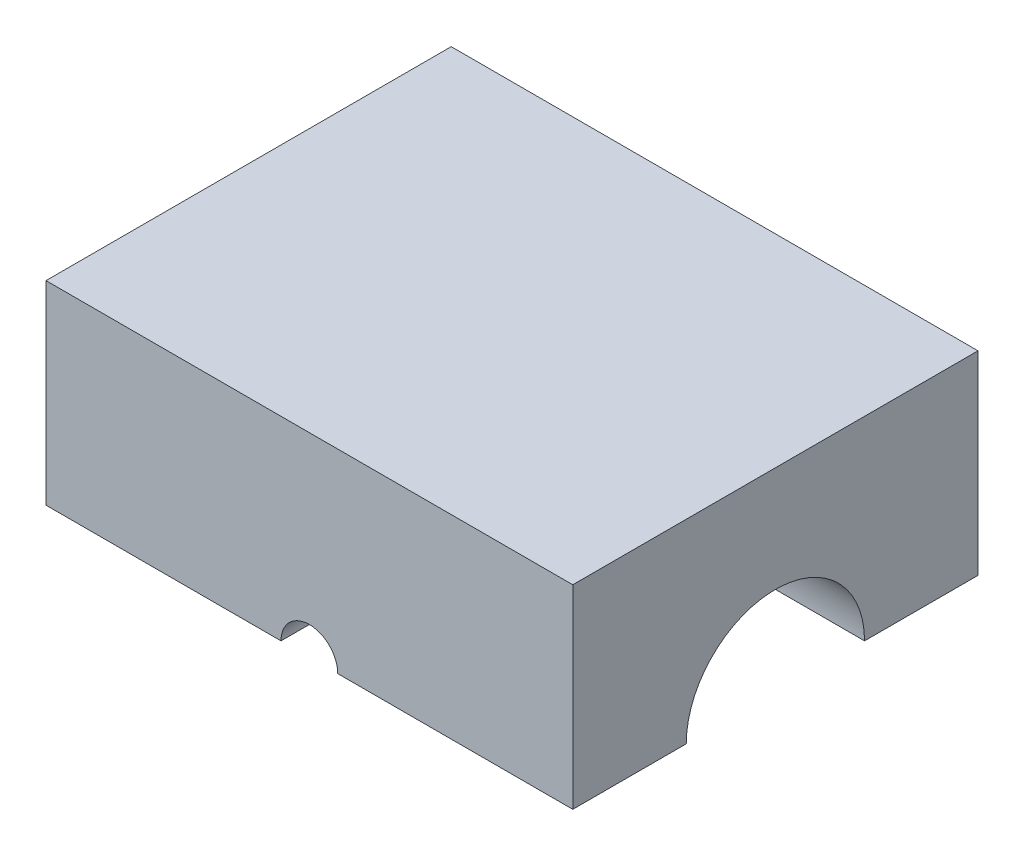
ISO-10303-21;
HEADER;
FILE_DESCRIPTION(('STEP AP214'),'2;1');
FILE_NAME('part.step','',(''),(''),'','','');
FILE_SCHEMA(('AUTOMOTIVE_DESIGN { 1 0 10303 214 1 1 1 1 }'));
ENDSEC;
DATA;
#1=APPLICATION_CONTEXT('core data for automotive mechanical design processes');
#2=APPLICATION_PROTOCOL_DEFINITION('international standard','automotive_design',2000,#1);
#3=PRODUCT_CONTEXT('',#1,'mechanical');
#4=PRODUCT('Part','Part','',(#3));
#5=PRODUCT_RELATED_PRODUCT_CATEGORY('part','',(#4));
#6=PRODUCT_DEFINITION_FORMATION('','',#4);
#7=PRODUCT_DEFINITION_CONTEXT('part definition',#1,'design');
#8=PRODUCT_DEFINITION('design','',#6,#7);
#9=PRODUCT_DEFINITION_SHAPE('','',#8);
#10=(LENGTH_UNIT() NAMED_UNIT(*) SI_UNIT(.MILLI.,.METRE.));
#11=(NAMED_UNIT(*) PLANE_ANGLE_UNIT() SI_UNIT($,.RADIAN.));
#12=(NAMED_UNIT(*) SI_UNIT($,.STERADIAN.) SOLID_ANGLE_UNIT());
#13=UNCERTAINTY_MEASURE_WITH_UNIT(LENGTH_MEASURE(1.E-05),#10,'distance_accuracy_value','');
#14=(GEOMETRIC_REPRESENTATION_CONTEXT(3) GLOBAL_UNCERTAINTY_ASSIGNED_CONTEXT((#13)) GLOBAL_UNIT_ASSIGNED_CONTEXT((#10,
#11,#12)) REPRESENTATION_CONTEXT('',''));
#15=CARTESIAN_POINT('',(0.,0.,0.));
#16=DIRECTION('',(0.,0.,1.));
#17=DIRECTION('',(1.,0.,0.));
#18=AXIS2_PLACEMENT_3D('',#15,#16,#17);
#19=CARTESIAN_POINT('',(-206.375,0.,158.75));
#20=DIRECTION('',(0.,1.,0.));
#21=DIRECTION('',(0.,0.,1.));
#22=AXIS2_PLACEMENT_3D('',#19,#20,#21);
#23=PLANE('',#22);
#24=DIRECTION('',(1.,0.,0.));
#25=VECTOR('',#24,1.);
#26=CARTESIAN_POINT('',(-206.375,0.,69.85));
#27=LINE('',#26,#25);
#28=CARTESIAN_POINT('',(-206.375,0.,69.85));
#29=VERTEX_POINT('',#28);
#30=CARTESIAN_POINT('',(-114.3,0.,69.85));
#31=VERTEX_POINT('',#30);
#32=EDGE_CURVE('E163',#29,#31,#27,.T.);
#33=ORIENTED_EDGE('',*,*,#32,.T.);
#34=CARTESIAN_POINT('',(-114.3,0.,95.25));
#35=DIRECTION('',(0.,1.,0.));
#36=DIRECTION('',(0.,0.,1.));
#37=AXIS2_PLACEMENT_3D('',#34,#35,#36);
#38=CIRCLE('',#37,25.4);
#39=CARTESIAN_POINT('',(-88.9,0.,95.25));
#40=VERTEX_POINT('',#39);
#41=EDGE_CURVE('E240',#31,#40,#38,.F.);
#42=ORIENTED_EDGE('',*,*,#41,.T.);
#43=DIRECTION('',(0.,0.,1.));
#44=VECTOR('',#43,1.);
#45=CARTESIAN_POINT('',(-88.9,0.,158.75));
#46=LINE('',#45,#44);
#47=CARTESIAN_POINT('',(-88.9,0.,101.6));
#48=VERTEX_POINT('',#47);
#49=EDGE_CURVE('E227',#48,#40,#46,.F.);
#50=ORIENTED_EDGE('',*,*,#49,.F.);
#51=DIRECTION('',(-1.,0.,0.));
#52=VECTOR('',#51,1.);
#53=CARTESIAN_POINT('',(-206.375,0.,101.6));
#54=LINE('',#53,#52);
#55=CARTESIAN_POINT('',(-22.225,0.,101.6));
#56=VERTEX_POINT('',#55);
#57=EDGE_CURVE('E216',#56,#48,#54,.T.);
#58=ORIENTED_EDGE('',*,*,#57,.F.);
#59=DIRECTION('',(0.,0.,1.));
#60=VECTOR('',#59,1.);
#61=CARTESIAN_POINT('',(-22.225,0.,158.75));
#62=LINE('',#61,#60);
#63=CARTESIAN_POINT('',(-22.225,0.,158.75));
#64=VERTEX_POINT('',#63);
#65=EDGE_CURVE('E225',#64,#56,#62,.F.);
#66=ORIENTED_EDGE('',*,*,#65,.F.);
#67=DIRECTION('',(1.,0.,0.));
#68=VECTOR('',#67,1.);
#69=CARTESIAN_POINT('',(-206.375,0.,158.75));
#70=LINE('',#69,#68);
#71=CARTESIAN_POINT('',(-206.375,0.,158.75));
#72=VERTEX_POINT('',#71);
#73=EDGE_CURVE('E183',#72,#64,#70,.T.);
#74=ORIENTED_EDGE('',*,*,#73,.F.);
#75=DIRECTION('',(0.,0.,1.));
#76=VECTOR('',#75,1.);
#77=CARTESIAN_POINT('',(-206.375,0.,-158.75));
#78=LINE('',#77,#76);
#79=EDGE_CURVE('E181',#29,#72,#78,.T.);
#80=ORIENTED_EDGE('',*,*,#79,.F.);
#81=EDGE_LOOP('',(#33,#42,#50,#58,#66,#74,#80));
#82=FACE_BOUND('',#81,.T.);
#83=ADVANCED_FACE('F34',(#82),#23,.F.);
#84=DIRECTION('',(0.,0.,1.));
#85=VECTOR('',#84,1.);
#86=CARTESIAN_POINT('',(88.9,0.,158.75));
#87=LINE('',#86,#85);
#88=CARTESIAN_POINT('',(88.9,0.,95.25));
#89=VERTEX_POINT('',#88);
#90=CARTESIAN_POINT('',(88.9,0.,101.6));
#91=VERTEX_POINT('',#90);
#92=EDGE_CURVE('E215',#89,#91,#87,.T.);
#93=ORIENTED_EDGE('',*,*,#92,.F.);
#94=CARTESIAN_POINT('',(114.3,0.,95.25));
#95=DIRECTION('',(0.,1.,0.));
#96=DIRECTION('',(0.,0.,1.));
#97=AXIS2_PLACEMENT_3D('',#94,#95,#96);
#98=CIRCLE('',#97,25.4);
#99=CARTESIAN_POINT('',(114.3,0.,69.85));
#100=VERTEX_POINT('',#99);
#101=EDGE_CURVE('E11',#89,#100,#98,.F.);
#102=ORIENTED_EDGE('',*,*,#101,.T.);
#103=DIRECTION('',(1.,0.,0.));
#104=VECTOR('',#103,1.);
#105=CARTESIAN_POINT('',(-206.375,0.,69.85));
#106=LINE('',#105,#104);
#107=CARTESIAN_POINT('',(206.375,0.,69.85));
#108=VERTEX_POINT('',#107);
#109=EDGE_CURVE('E164',#100,#108,#106,.T.);
#110=ORIENTED_EDGE('',*,*,#109,.T.);
#111=DIRECTION('',(0.,0.,-1.));
#112=VECTOR('',#111,1.);
#113=CARTESIAN_POINT('',(206.375,0.,-158.75));
#114=LINE('',#113,#112);
#115=CARTESIAN_POINT('',(206.375,0.,158.75));
#116=VERTEX_POINT('',#115);
#117=EDGE_CURVE('E192',#116,#108,#114,.T.);
#118=ORIENTED_EDGE('',*,*,#117,.F.);
#119=CARTESIAN_POINT('',(22.225,0.,158.75));
#120=VERTEX_POINT('',#119);
#121=EDGE_CURVE('E180',#120,#116,#70,.T.);
#122=ORIENTED_EDGE('',*,*,#121,.F.);
#123=DIRECTION('',(0.,0.,1.));
#124=VECTOR('',#123,1.);
#125=CARTESIAN_POINT('',(22.225,0.,158.75));
#126=LINE('',#125,#124);
#127=CARTESIAN_POINT('',(22.225,0.,101.6));
#128=VERTEX_POINT('',#127);
#129=EDGE_CURVE('E210',#128,#120,#126,.T.);
#130=ORIENTED_EDGE('',*,*,#129,.F.);
#131=EDGE_CURVE('E212',#91,#128,#54,.T.);
#132=ORIENTED_EDGE('',*,*,#131,.F.);
#133=EDGE_LOOP('',(#93,#102,#110,#118,#122,#130,#132));
#134=FACE_BOUND('',#133,.T.);
#135=ADVANCED_FACE('F375',(#134),#23,.F.);
#136=CARTESIAN_POINT('',(-206.375,152.4,158.75));
#137=DIRECTION('',(0.,0.,-1.));
#138=DIRECTION('',(-1.,0.,0.));
#139=AXIS2_PLACEMENT_3D('',#136,#137,#138);
#140=PLANE('',#139);
#141=CARTESIAN_POINT('',(0.,0.,158.75));
#142=DIRECTION('',(0.,0.,1.));
#143=DIRECTION('',(1.,0.,0.));
#144=AXIS2_PLACEMENT_3D('',#141,#142,#143);
#145=CIRCLE('',#144,22.225);
#146=EDGE_CURVE('E367',#120,#64,#145,.T.);
#147=ORIENTED_EDGE('',*,*,#146,.F.);
#148=ORIENTED_EDGE('',*,*,#121,.T.);
#149=DIRECTION('',(0.,-1.,0.));
#150=VECTOR('',#149,1.);
#151=CARTESIAN_POINT('',(206.375,152.4,158.75));
#152=LINE('',#151,#150);
#153=CARTESIAN_POINT('',(206.375,152.4,158.75));
#154=VERTEX_POINT('',#153);
#155=EDGE_CURVE('E204',#154,#116,#152,.T.);
#156=ORIENTED_EDGE('',*,*,#155,.F.);
#157=DIRECTION('',(1.,0.,0.));
#158=VECTOR('',#157,1.);
#159=CARTESIAN_POINT('',(-206.375,152.4,158.75));
#160=LINE('',#159,#158);
#161=CARTESIAN_POINT('',(-206.375,152.4,158.75));
#162=VERTEX_POINT('',#161);
#163=EDGE_CURVE('E336',#162,#154,#160,.T.);
#164=ORIENTED_EDGE('',*,*,#163,.F.);
#165=DIRECTION('',(0.,-1.,0.));
#166=VECTOR('',#165,1.);
#167=CARTESIAN_POINT('',(-206.375,152.4,158.75));
#168=LINE('',#167,#166);
#169=EDGE_CURVE('E207',#162,#72,#168,.T.);
#170=ORIENTED_EDGE('',*,*,#169,.T.);
#171=ORIENTED_EDGE('',*,*,#73,.T.);
#172=EDGE_LOOP('',(#147,#148,#156,#164,#170,#171));
#173=FACE_BOUND('',#172,.T.);
#174=ADVANCED_FACE('F349',(#173),#140,.F.);
#175=CARTESIAN_POINT('',(-206.375,152.4,-158.75));
#176=DIRECTION('',(0.,0.,1.));
#177=DIRECTION('',(1.,0.,0.));
#178=AXIS2_PLACEMENT_3D('',#175,#176,#177);
#179=PLANE('',#178);
#180=CARTESIAN_POINT('',(0.,0.,-158.75));
#181=DIRECTION('',(0.,0.,1.));
#182=DIRECTION('',(1.,0.,0.));
#183=AXIS2_PLACEMENT_3D('',#180,#181,#182);
#184=CIRCLE('',#183,22.225);
#185=CARTESIAN_POINT('',(22.225,0.,-158.75));
#186=VERTEX_POINT('',#185);
#187=CARTESIAN_POINT('',(-22.2249999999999,0.,-158.75));
#188=VERTEX_POINT('',#187);
#189=EDGE_CURVE('E185',#186,#188,#184,.T.);
#190=ORIENTED_EDGE('',*,*,#189,.T.);
#191=DIRECTION('',(-1.,0.,0.));
#192=VECTOR('',#191,1.);
#193=CARTESIAN_POINT('',(-206.375,0.,-158.75));
#194=LINE('',#193,#192);
#195=CARTESIAN_POINT('',(-206.375,0.,-158.75));
#196=VERTEX_POINT('',#195);
#197=EDGE_CURVE('E195',#188,#196,#194,.T.);
#198=ORIENTED_EDGE('',*,*,#197,.T.);
#199=DIRECTION('',(0.,-1.,0.));
#200=VECTOR('',#199,1.);
#201=CARTESIAN_POINT('',(-206.375,152.4,-158.75));
#202=LINE('',#201,#200);
#203=CARTESIAN_POINT('',(-206.375,152.4,-158.75));
#204=VERTEX_POINT('',#203);
#205=EDGE_CURVE('E179',#204,#196,#202,.T.);
#206=ORIENTED_EDGE('',*,*,#205,.F.);
#207=DIRECTION('',(-1.,0.,0.));
#208=VECTOR('',#207,1.);
#209=CARTESIAN_POINT('',(-206.375,152.4,-158.75));
#210=LINE('',#209,#208);
#211=CARTESIAN_POINT('',(206.375,152.4,-158.75));
#212=VERTEX_POINT('',#211);
#213=EDGE_CURVE('E187',#212,#204,#210,.T.);
#214=ORIENTED_EDGE('',*,*,#213,.F.);
#215=DIRECTION('',(0.,-1.,0.));
#216=VECTOR('',#215,1.);
#217=CARTESIAN_POINT('',(206.375,152.4,-158.75));
#218=LINE('',#217,#216);
#219=CARTESIAN_POINT('',(206.375,0.,-158.75));
#220=VERTEX_POINT('',#219);
#221=EDGE_CURVE('E201',#212,#220,#218,.T.);
#222=ORIENTED_EDGE('',*,*,#221,.T.);
#223=EDGE_CURVE('E196',#220,#186,#194,.T.);
#224=ORIENTED_EDGE('',*,*,#223,.T.);
#225=EDGE_LOOP('',(#190,#198,#206,#214,#222,#224));
#226=FACE_BOUND('',#225,.T.);
#227=ADVANCED_FACE('F345',(#226),#179,.F.);
#228=CARTESIAN_POINT('',(-88.9,0.,-95.25));
#229=VERTEX_POINT('',#228);
#230=CARTESIAN_POINT('',(-88.8999999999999,0.,-101.6));
#231=VERTEX_POINT('',#230);
#232=EDGE_CURVE('E230',#229,#231,#46,.F.);
#233=ORIENTED_EDGE('',*,*,#232,.F.);
#234=CARTESIAN_POINT('',(-114.3,0.,-95.25));
#235=DIRECTION('',(0.,1.,0.));
#236=DIRECTION('',(0.,0.,1.));
#237=AXIS2_PLACEMENT_3D('',#234,#235,#236);
#238=CIRCLE('',#237,25.4);
#239=CARTESIAN_POINT('',(-114.3,0.,-69.85));
#240=VERTEX_POINT('',#239);
#241=EDGE_CURVE('E159',#229,#240,#238,.F.);
#242=ORIENTED_EDGE('',*,*,#241,.T.);
#243=DIRECTION('',(1.,0.,0.));
#244=VECTOR('',#243,1.);
#245=CARTESIAN_POINT('',(-206.375,0.,-69.85));
#246=LINE('',#245,#244);
#247=CARTESIAN_POINT('',(-206.375,0.,-69.85));
#248=VERTEX_POINT('',#247);
#249=EDGE_CURVE('E151',#240,#248,#246,.F.);
#250=ORIENTED_EDGE('',*,*,#249,.T.);
#251=EDGE_CURVE('E157',#196,#248,#78,.T.);
#252=ORIENTED_EDGE('',*,*,#251,.F.);
#253=ORIENTED_EDGE('',*,*,#197,.F.);
#254=DIRECTION('',(0.,0.,1.));
#255=VECTOR('',#254,1.);
#256=CARTESIAN_POINT('',(-22.225,0.,158.75));
#257=LINE('',#256,#255);
#258=CARTESIAN_POINT('',(-22.225,0.,-101.6));
#259=VERTEX_POINT('',#258);
#260=EDGE_CURVE('E231',#259,#188,#257,.F.);
#261=ORIENTED_EDGE('',*,*,#260,.F.);
#262=DIRECTION('',(1.,0.,0.));
#263=VECTOR('',#262,1.);
#264=CARTESIAN_POINT('',(-206.375,0.,-101.6));
#265=LINE('',#264,#263);
#266=EDGE_CURVE('E223',#231,#259,#265,.T.);
#267=ORIENTED_EDGE('',*,*,#266,.F.);
#268=EDGE_LOOP('',(#233,#242,#250,#252,#253,#261,#267));
#269=FACE_BOUND('',#268,.T.);
#270=ADVANCED_FACE('F154',(#269),#23,.F.);
#271=DIRECTION('',(1.,0.,0.));
#272=VECTOR('',#271,1.);
#273=CARTESIAN_POINT('',(-206.375,0.,-69.85));
#274=LINE('',#273,#272);
#275=CARTESIAN_POINT('',(206.375,0.,-69.85));
#276=VERTEX_POINT('',#275);
#277=CARTESIAN_POINT('',(114.3,0.,-69.85));
#278=VERTEX_POINT('',#277);
#279=EDGE_CURVE('E172',#276,#278,#274,.F.);
#280=ORIENTED_EDGE('',*,*,#279,.T.);
#281=CARTESIAN_POINT('',(114.3,0.,-95.25));
#282=DIRECTION('',(0.,1.,0.));
#283=DIRECTION('',(0.,0.,1.));
#284=AXIS2_PLACEMENT_3D('',#281,#282,#283);
#285=CIRCLE('',#284,25.4);
#286=CARTESIAN_POINT('',(88.9,0.,-95.25));
#287=VERTEX_POINT('',#286);
#288=EDGE_CURVE('E46',#278,#287,#285,.F.);
#289=ORIENTED_EDGE('',*,*,#288,.T.);
#290=CARTESIAN_POINT('',(88.9,0.,-101.6));
#291=VERTEX_POINT('',#290);
#292=EDGE_CURVE('E217',#291,#287,#87,.T.);
#293=ORIENTED_EDGE('',*,*,#292,.F.);
#294=CARTESIAN_POINT('',(22.225,0.,-101.6));
#295=VERTEX_POINT('',#294);
#296=EDGE_CURVE('E220',#295,#291,#265,.T.);
#297=ORIENTED_EDGE('',*,*,#296,.F.);
#298=DIRECTION('',(0.,0.,1.));
#299=VECTOR('',#298,1.);
#300=CARTESIAN_POINT('',(22.225,0.,158.75));
#301=LINE('',#300,#299);
#302=EDGE_CURVE('E222',#186,#295,#301,.T.);
#303=ORIENTED_EDGE('',*,*,#302,.F.);
#304=ORIENTED_EDGE('',*,*,#223,.F.);
#305=EDGE_CURVE('E191',#276,#220,#114,.T.);
#306=ORIENTED_EDGE('',*,*,#305,.F.);
#307=EDGE_LOOP('',(#280,#289,#293,#297,#303,#304,#306));
#308=FACE_BOUND('',#307,.T.);
#309=ADVANCED_FACE('F316',(#308),#23,.F.);
#310=CARTESIAN_POINT('',(-206.375,152.4,-158.75));
#311=DIRECTION('',(1.,0.,0.));
#312=DIRECTION('',(0.,0.,-1.));
#313=AXIS2_PLACEMENT_3D('',#310,#311,#312);
#314=PLANE('',#313);
#315=ORIENTED_EDGE('',*,*,#251,.T.);
#316=CARTESIAN_POINT('',(-206.375,0.,0.));
#317=DIRECTION('',(1.,0.,0.));
#318=DIRECTION('',(0.,0.,-1.));
#319=AXIS2_PLACEMENT_3D('',#316,#317,#318);
#320=CIRCLE('',#319,69.85);
#321=EDGE_CURVE('E167',#248,#29,#320,.T.);
#322=ORIENTED_EDGE('',*,*,#321,.T.);
#323=ORIENTED_EDGE('',*,*,#79,.T.);
#324=ORIENTED_EDGE('',*,*,#169,.F.);
#325=DIRECTION('',(0.,0.,1.));
#326=VECTOR('',#325,1.);
#327=CARTESIAN_POINT('',(-206.375,152.4,-158.75));
#328=LINE('',#327,#326);
#329=EDGE_CURVE('E199',#204,#162,#328,.T.);
#330=ORIENTED_EDGE('',*,*,#329,.F.);
#331=ORIENTED_EDGE('',*,*,#205,.T.);
#332=EDGE_LOOP('',(#315,#322,#323,#324,#330,#331));
#333=FACE_BOUND('',#332,.T.);
#334=ADVANCED_FACE('F176',(#333),#314,.F.);
#335=CARTESIAN_POINT('',(206.375,152.4,-158.75));
#336=DIRECTION('',(-1.,0.,0.));
#337=DIRECTION('',(0.,0.,1.));
#338=AXIS2_PLACEMENT_3D('',#335,#336,#337);
#339=PLANE('',#338);
#340=ORIENTED_EDGE('',*,*,#117,.T.);
#341=CARTESIAN_POINT('',(206.375,0.,0.));
#342=DIRECTION('',(1.,0.,0.));
#343=DIRECTION('',(0.,0.,-1.));
#344=AXIS2_PLACEMENT_3D('',#341,#342,#343);
#345=CIRCLE('',#344,69.85);
#346=EDGE_CURVE('E173',#276,#108,#345,.T.);
#347=ORIENTED_EDGE('',*,*,#346,.F.);
#348=ORIENTED_EDGE('',*,*,#305,.T.);
#349=ORIENTED_EDGE('',*,*,#221,.F.);
#350=DIRECTION('',(0.,0.,-1.));
#351=VECTOR('',#350,1.);
#352=CARTESIAN_POINT('',(206.375,152.4,-158.75));
#353=LINE('',#352,#351);
#354=EDGE_CURVE('E337',#154,#212,#353,.T.);
#355=ORIENTED_EDGE('',*,*,#354,.F.);
#356=ORIENTED_EDGE('',*,*,#155,.T.);
#357=EDGE_LOOP('',(#340,#347,#348,#349,#355,#356));
#358=FACE_BOUND('',#357,.T.);
#359=ADVANCED_FACE('F354',(#358),#339,.F.);
#360=CARTESIAN_POINT('',(-206.375,152.4,158.75));
#361=DIRECTION('',(0.,1.,0.));
#362=DIRECTION('',(0.,0.,1.));
#363=AXIS2_PLACEMENT_3D('',#360,#361,#362);
#364=PLANE('',#363);
#365=ORIENTED_EDGE('',*,*,#329,.T.);
#366=ORIENTED_EDGE('',*,*,#163,.T.);
#367=ORIENTED_EDGE('',*,*,#354,.T.);
#368=ORIENTED_EDGE('',*,*,#213,.T.);
#369=EDGE_LOOP('',(#365,#366,#367,#368));
#370=FACE_BOUND('',#369,.T.);
#371=ADVANCED_FACE('F342',(#370),#364,.T.);
#372=CARTESIAN_POINT('',(0.,0.,158.75));
#373=DIRECTION('',(0.,0.,1.));
#374=DIRECTION('',(1.,0.,0.));
#375=AXIS2_PLACEMENT_3D('',#372,#373,#374);
#376=CYLINDRICAL_SURFACE('',#375,22.225);
#377=ORIENTED_EDGE('',*,*,#260,.T.);
#378=ORIENTED_EDGE('',*,*,#189,.F.);
#379=ORIENTED_EDGE('',*,*,#302,.T.);
#380=CARTESIAN_POINT('',(0.,0.,-101.6));
#381=DIRECTION('',(0.,0.,1.));
#382=DIRECTION('',(1.,0.,0.));
#383=AXIS2_PLACEMENT_3D('',#380,#381,#382);
#384=CIRCLE('',#383,22.225);
#385=EDGE_CURVE('E324',#295,#259,#384,.T.);
#386=ORIENTED_EDGE('',*,*,#385,.T.);
#387=EDGE_LOOP('',(#377,#378,#379,#386));
#388=FACE_BOUND('',#387,.T.);
#389=ADVANCED_FACE('F360',(#388),#376,.F.);
#390=CARTESIAN_POINT('',(22.225,0.,-101.6));
#391=DIRECTION('',(0.,0.,1.));
#392=DIRECTION('',(1.,0.,0.));
#393=AXIS2_PLACEMENT_3D('',#390,#391,#392);
#394=PLANE('',#393);
#395=ORIENTED_EDGE('',*,*,#266,.T.);
#396=ORIENTED_EDGE('',*,*,#385,.F.);
#397=ORIENTED_EDGE('',*,*,#296,.T.);
#398=CARTESIAN_POINT('',(0.,0.,-101.6));
#399=DIRECTION('',(0.,0.,1.));
#400=DIRECTION('',(1.,0.,0.));
#401=AXIS2_PLACEMENT_3D('',#398,#399,#400);
#402=CIRCLE('',#401,88.9);
#403=EDGE_CURVE('E321',#291,#231,#402,.T.);
#404=ORIENTED_EDGE('',*,*,#403,.T.);
#405=EDGE_LOOP('',(#395,#396,#397,#404));
#406=FACE_BOUND('',#405,.T.);
#407=ADVANCED_FACE('F280',(#406),#394,.T.);
#408=CARTESIAN_POINT('',(0.,0.,158.75));
#409=DIRECTION('',(0.,0.,1.));
#410=DIRECTION('',(1.,0.,0.));
#411=AXIS2_PLACEMENT_3D('',#408,#409,#410);
#412=CYLINDRICAL_SURFACE('',#411,88.9);
#413=ORIENTED_EDGE('',*,*,#49,.T.);
#414=CARTESIAN_POINT('',(-80.8947573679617,-36.8679838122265,-82.6174434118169));
#415=CARTESIAN_POINT('',(-84.8488167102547,-28.1920911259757,-64.35517027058));
#416=CARTESIAN_POINT('',(-104.007545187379,-34.7612418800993,-60.5861251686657));
#417=CARTESIAN_POINT('',(-81.2313678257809,-36.1294050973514,-83.1622714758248));
#418=CARTESIAN_POINT('',(-85.0713534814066,-27.493206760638,-64.6554508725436));
#419=CARTESIAN_POINT('',(-104.440330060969,-34.0648676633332,-60.985665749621));
#420=CARTESIAN_POINT('',(-81.560268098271,-35.3809298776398,-83.6926460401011));
#421=CARTESIAN_POINT('',(-85.2827348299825,-26.7966932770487,-64.9402910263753));
#422=CARTESIAN_POINT('',(-104.863201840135,-33.3591624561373,-61.3746070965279));
#423=CARTESIAN_POINT('',(-82.2014862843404,-33.8644873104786,-84.7233293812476));
#424=CARTESIAN_POINT('',(-85.6851843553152,-25.40504137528,-65.4821866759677));
#425=CARTESIAN_POINT('',(-105.687625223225,-31.9293737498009,-62.1304415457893));
#426=CARTESIAN_POINT('',(-82.5138023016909,-33.0965177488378,-85.2236347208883));
#427=CARTESIAN_POINT('',(-85.8760709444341,-24.7100553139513,-65.7389946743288));
#428=CARTESIAN_POINT('',(-106.089174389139,-31.2052881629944,-62.497332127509));
#429=CARTESIAN_POINT('',(-83.4244451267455,-30.7629802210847,-86.6782091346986));
#430=CARTESIAN_POINT('',(-86.4204066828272,-22.6223350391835,-66.471239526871));
#431=CARTESIAN_POINT('',(-107.26000087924,-29.0050956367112,-63.5640200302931));
#432=CARTESIAN_POINT('',(-83.9959891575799,-29.1688248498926,-87.5853656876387));
#433=CARTESIAN_POINT('',(-86.7405511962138,-21.2427814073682,-66.901795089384));
#434=CARTESIAN_POINT('',(-107.994843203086,-27.5020348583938,-64.2292681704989));
#435=CARTESIAN_POINT('',(-85.0598438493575,-25.9035400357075,-89.2664723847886));
#436=CARTESIAN_POINT('',(-87.3055429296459,-18.5048174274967,-67.6631980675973));
#437=CARTESIAN_POINT('',(-109.36265637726,-24.4233377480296,-65.462079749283));
#438=CARTESIAN_POINT('',(-85.5517851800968,-24.232095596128,-90.0398027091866));
#439=CARTESIAN_POINT('',(-87.548660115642,-17.1489381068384,-67.9917440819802));
#440=CARTESIAN_POINT('',(-109.995152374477,-22.8474044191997,-66.029188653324));
#441=CARTESIAN_POINT('',(-86.2205399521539,-21.6795568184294,-91.0875323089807));
#442=CARTESIAN_POINT('',(-87.8603643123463,-15.1488087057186,-68.414677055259));
#443=CARTESIAN_POINT('',(-110.8549799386,-20.4407250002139,-66.7975236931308));
#444=CARTESIAN_POINT('',(-86.4319325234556,-20.8211459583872,-91.4180653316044));
#445=CARTESIAN_POINT('',(-87.9556395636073,-14.4855640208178,-68.5442872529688));
#446=CARTESIAN_POINT('',(-111.126770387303,-19.6313661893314,-67.0399145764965));
#447=CARTESIAN_POINT('',(-86.8306105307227,-19.0903959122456,-92.0404783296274));
#448=CARTESIAN_POINT('',(-88.1299676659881,-13.1692101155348,-68.78205381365));
#449=CARTESIAN_POINT('',(-111.639356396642,-17.9995161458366,-67.4963507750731));
#450=CARTESIAN_POINT('',(-87.0178985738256,-18.2180582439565,-92.3323624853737));
#451=CARTESIAN_POINT('',(-88.2088956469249,-12.5164977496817,-68.8900431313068));
#452=CARTESIAN_POINT('',(-111.880155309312,-17.1770263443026,-67.7103991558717));
#453=CARTESIAN_POINT('',(-87.3684181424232,-16.4554557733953,-92.8779313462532));
#454=CARTESIAN_POINT('',(-88.3523275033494,-11.2173004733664,-69.0868675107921));
#455=CARTESIAN_POINT('',(-112.330823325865,-15.5151440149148,-68.1104829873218));
#456=CARTESIAN_POINT('',(-87.5314929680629,-15.565113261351,-93.1313674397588));
#457=CARTESIAN_POINT('',(-88.4166272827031,-10.5713273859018,-69.1754293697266));
#458=CARTESIAN_POINT('',(-112.540490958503,-14.6756782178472,-68.2963361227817));
#459=CARTESIAN_POINT('',(-87.831220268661,-13.7735780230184,-93.5966781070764));
#460=CARTESIAN_POINT('',(-88.5315854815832,-9.28939461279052,-69.3342628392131));
#461=CARTESIAN_POINT('',(-112.925854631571,-12.986516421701,-68.6375639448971));
#462=CARTESIAN_POINT('',(-87.9678759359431,-12.8723866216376,-93.808557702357));
#463=CARTESIAN_POINT('',(-88.5821558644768,-8.65388281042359,-69.4044149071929));
#464=CARTESIAN_POINT('',(-113.101554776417,-12.136821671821,-68.7929423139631));
#465=CARTESIAN_POINT('',(-88.2139862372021,-11.0606750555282,-94.1898217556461));
#466=CARTESIAN_POINT('',(-88.6710378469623,-7.39165382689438,-69.5280933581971));
#467=CARTESIAN_POINT('',(-113.417982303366,-10.4286364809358,-69.0725359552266));
#468=CARTESIAN_POINT('',(-88.3234346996,-10.1501528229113,-94.3591965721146));
#469=CARTESIAN_POINT('',(-88.7092764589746,-6.76540128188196,-69.5815196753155));
#470=CARTESIAN_POINT('',(-113.558701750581,-9.57014409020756,-69.1967441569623));
#471=CARTESIAN_POINT('',(-88.5143936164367,-8.32205539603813,-94.6545287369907));
#472=CARTESIAN_POINT('',(-88.7746954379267,-5.52037323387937,-69.6731695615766));
#473=CARTESIAN_POINT('',(-113.804220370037,-7.84650937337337,-69.4133210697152));
#474=CARTESIAN_POINT('',(-88.5959075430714,-7.40448109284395,-94.7804914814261));
#475=CARTESIAN_POINT('',(-88.8018254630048,-4.9020662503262,-69.7113233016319));
#476=CARTESIAN_POINT('',(-113.909024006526,-6.98136788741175,-69.5056937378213));
#477=CARTESIAN_POINT('',(-88.7303021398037,-5.56684753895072,-94.9880875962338));
#478=CARTESIAN_POINT('',(-88.8459576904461,-3.67258863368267,-69.7735122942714));
#479=CARTESIAN_POINT('',(-114.081817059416,-5.24874196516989,-69.6579308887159));
#480=CARTESIAN_POINT('',(-88.783263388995,-4.64680272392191,-95.0698457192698));
#481=CARTESIAN_POINT('',(-88.8629539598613,-3.06186986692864,-69.7975390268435));
#482=CARTESIAN_POINT('',(-114.149910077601,-4.3812711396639,-69.7178868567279));
#483=CARTESIAN_POINT('',(-88.8605576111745,-2.80389257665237,-95.189145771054));
#484=CARTESIAN_POINT('',(-88.8876080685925,-1.84351565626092,-69.8324264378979));
#485=CARTESIAN_POINT('',(-114.249288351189,-2.64367014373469,-69.8053735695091));
#486=CARTESIAN_POINT('',(-88.8848940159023,-1.88102759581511,-95.2266930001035));
#487=CARTESIAN_POINT('',(-88.8952478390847,-1.23635094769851,-69.8432615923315));
#488=CARTESIAN_POINT('',(-114.280578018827,-1.77354030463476,-69.8329082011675));
#489=CARTESIAN_POINT('',(-88.9047864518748,-0.034571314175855,-95.2573852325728));
#490=CARTESIAN_POINT('',(-88.9015081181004,-0.0224759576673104,-69.85213810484));
#491=CARTESIAN_POINT('',(-114.306154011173,-0.0325958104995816,-69.8554158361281));
#492=CARTESIAN_POINT('',(-88.9003439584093,0.889019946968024,-95.2505325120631));
#493=CARTESIAN_POINT('',(-88.9001242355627,0.583762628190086,-69.8501732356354));
#494=CARTESIAN_POINT('',(-114.300442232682,0.838218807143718,-69.8503905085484));
#495=CARTESIAN_POINT('',(-88.8627252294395,2.73468435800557,-95.1924859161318));
#496=CARTESIAN_POINT('',(-88.888251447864,1.79835542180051,-69.8333457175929));
#497=CARTESIAN_POINT('',(-114.252075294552,2.57841668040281,-69.8078230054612));
#498=CARTESIAN_POINT('',(-88.829549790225,3.65675754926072,-95.1412932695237));
#499=CARTESIAN_POINT('',(-88.8777720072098,2.40623833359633,-69.8184964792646));
#500=CARTESIAN_POINT('',(-114.209421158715,3.44779997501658,-69.7702817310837));
#501=CARTESIAN_POINT('',(-88.6984365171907,6.19950861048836,-94.9388907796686));
#502=CARTESIAN_POINT('',(-88.8357001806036,4.09158522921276,-69.7590196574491));
#503=CARTESIAN_POINT('',(-114.040846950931,5.84525097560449,-69.6218532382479));
#504=CARTESIAN_POINT('',(-88.5704030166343,7.81663608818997,-94.7411772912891));
#505=CARTESIAN_POINT('',(-88.7941725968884,5.17300885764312,-69.7004189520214));
#506=CARTESIAN_POINT('',(-113.876232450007,7.36997116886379,-69.4768633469));
#507=CARTESIAN_POINT('',(-88.2281345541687,11.0279151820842,-94.211778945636));
#508=CARTESIAN_POINT('',(-88.6765009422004,7.3631383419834,-69.5356436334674));
#509=CARTESIAN_POINT('',(-113.436172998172,10.3977486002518,-69.0886378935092));
#510=CARTESIAN_POINT('',(-88.0139072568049,12.6220688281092,-93.8801060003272));
#511=CARTESIAN_POINT('',(-88.6006465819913,8.46928895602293,-69.4298705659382));
#512=CARTESIAN_POINT('',(-113.160737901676,11.9008077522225,-68.8454110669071));
#513=CARTESIAN_POINT('',(-87.5031183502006,15.7788769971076,-93.0874530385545));
#514=CARTESIAN_POINT('',(-88.4068486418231,10.7171299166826,-69.1617808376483));
#515=CARTESIAN_POINT('',(-112.504009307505,14.8772268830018,-68.2641322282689));
#516=CARTESIAN_POINT('',(-87.206482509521,17.3415017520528,-92.6263564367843));
#517=CARTESIAN_POINT('',(-88.2893354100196,11.8563932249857,-69.0000499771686));
#518=CARTESIAN_POINT('',(-112.122620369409,16.3505587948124,-67.9259947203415));
#519=CARTESIAN_POINT('',(-86.5362779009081,20.4247954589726,-91.5814067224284));
#520=CARTESIAN_POINT('',(-88.0041880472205,14.1709874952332,-68.610203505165));
#521=CARTESIAN_POINT('',(-111.260928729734,19.2576642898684,-67.1596982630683));
#522=CARTESIAN_POINT('',(-86.1627050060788,21.9454621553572,-90.9975470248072));
#523=CARTESIAN_POINT('',(-87.8372113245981,15.3440447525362,-68.3829690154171));
#524=CARTESIAN_POINT('',(-110.780620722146,20.6914357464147,-66.7315344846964));
#525=CARTESIAN_POINT('',(-85.333983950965,24.9771057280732,-89.6973968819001));
#526=CARTESIAN_POINT('',(-87.440735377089,17.7536602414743,-67.8458516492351));
#527=CARTESIAN_POINT('',(-109.715122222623,23.5498425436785,-65.7780910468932));
#528=CARTESIAN_POINT('',(-84.8769342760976,26.4867548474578,-88.9780035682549));
#529=CARTESIAN_POINT('',(-87.2105305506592,18.9892879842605,-67.5350467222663));
#530=CARTESIAN_POINT('',(-109.12748692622,24.9732259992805,-65.25053595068));
#531=CARTESIAN_POINT('',(-83.8956303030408,29.4476839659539,-87.4260243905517));
#532=CARTESIAN_POINT('',(-86.6838451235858,21.485866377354,-66.8255194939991));
#533=CARTESIAN_POINT('',(-107.865810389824,27.7649591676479,-64.112417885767));
#534=CARTESIAN_POINT('',(-83.3713768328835,30.8989646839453,-86.5934399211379));
#535=CARTESIAN_POINT('',(-86.3884018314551,22.7451126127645,-66.4281794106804));
#536=CARTESIAN_POINT('',(-107.191770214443,29.1333095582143,-63.5018559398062));
#537=CARTESIAN_POINT('',(-82.2633419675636,33.7383304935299,-84.8235761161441));
#538=CARTESIAN_POINT('',(-85.7282203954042,25.2770872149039,-65.5401117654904));
#539=CARTESIAN_POINT('',(-105.767153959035,31.8104258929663,-62.2039558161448));
#540=CARTESIAN_POINT('',(-81.679569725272,35.1264252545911,-83.8863128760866));
#541=CARTESIAN_POINT('',(-85.364588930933,26.5486062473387,-65.0508749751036));
#542=CARTESIAN_POINT('',(-105.016589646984,33.1192009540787,-61.5166294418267));
#543=CARTESIAN_POINT('',(-80.4599214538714,37.836753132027,-81.9146861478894));
#544=CARTESIAN_POINT('',(-84.5676341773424,29.0926593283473,-63.9759505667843));
#545=CARTESIAN_POINT('',(-103.448470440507,35.6746529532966,-60.0707698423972));
#546=CARTESIAN_POINT('',(-79.8240349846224,39.1589729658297,-80.8803031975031));
#547=CARTESIAN_POINT('',(-84.1353700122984,30.3645003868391,-63.391721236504));
#548=CARTESIAN_POINT('',(-102.630902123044,36.9213173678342,-59.3122223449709));
#549=CARTESIAN_POINT('',(-78.6857615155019,41.3868963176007,-79.0136426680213));
#550=CARTESIAN_POINT('',(-83.328148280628,32.5574049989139,-62.2955494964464));
#551=CARTESIAN_POINT('',(-101.167407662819,39.0219308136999,-57.9433379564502));
#552=CARTESIAN_POINT('',(-78.1937370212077,42.3085967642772,-78.2022901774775));
#553=CARTESIAN_POINT('',(-82.9707324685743,33.4775408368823,-61.8087531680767));
#554=CARTESIAN_POINT('',(-100.53480474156,39.8909626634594,-57.3483461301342));
#555=CARTESIAN_POINT('',(-77.1890511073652,44.1149483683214,-76.5345429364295));
#556=CARTESIAN_POINT('',(-82.2220232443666,35.306220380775,-60.7843478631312));
#557=CARTESIAN_POINT('',(-99.2430657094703,41.5940941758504,-56.1253314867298));
#558=CARTESIAN_POINT('',(-76.6763933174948,44.9996059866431,-75.6781561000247));
#559=CARTESIAN_POINT('',(-81.8310741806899,36.214802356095,-60.2472516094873));
#560=CARTESIAN_POINT('',(-98.5839342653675,42.4281999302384,-55.4973144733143));
#561=CARTESIAN_POINT('',(-75.1110515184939,47.598624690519,-73.0437371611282));
#562=CARTESIAN_POINT('',(-80.6153037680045,38.905575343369,-58.5675430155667));
#563=CARTESIAN_POINT('',(-96.5713519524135,44.8787032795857,-53.5654072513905));
#564=CARTESIAN_POINT('',(-74.0312199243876,49.2576040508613,-71.2008066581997));
#565=CARTESIAN_POINT('',(-79.7383330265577,40.6778055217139,-57.344086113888));
#566=CARTESIAN_POINT('',(-95.1829970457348,46.4428838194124,-52.2139248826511));
#567=CARTESIAN_POINT('',(-72.373407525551,51.6356416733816,-68.3160193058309));
#568=CARTESIAN_POINT('',(-78.3354896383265,43.2783466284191,-55.3529143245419));
#569=CARTESIAN_POINT('',(-93.0515239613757,48.6850335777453,-50.0984141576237));
#570=CARTESIAN_POINT('',(-71.8134302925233,52.411194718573,-67.3325031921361));
#571=CARTESIAN_POINT('',(-77.8557156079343,44.1318069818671,-54.6667088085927));
#572=CARTESIAN_POINT('',(-92.3315532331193,49.4162693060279,-49.3771690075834));
#573=CARTESIAN_POINT('',(-70.6840856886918,53.9245844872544,-65.3271900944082));
#574=CARTESIAN_POINT('',(-76.8729399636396,45.8118226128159,-53.2470888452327));
#575=CARTESIAN_POINT('',(-90.8795387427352,50.8431796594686,-47.9066060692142));
#576=CARTESIAN_POINT('',(-70.1147192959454,54.6624251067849,-64.3053970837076));
#577=CARTESIAN_POINT('',(-76.3700556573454,46.638748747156,-52.5139609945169));
#578=CARTESIAN_POINT('',(-90.1474962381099,51.5388579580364,-47.1572911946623));
#579=CARTESIAN_POINT('',(-68.9696317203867,56.1003091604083,-62.2246834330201));
#580=CARTESIAN_POINT('',(-75.3446640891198,48.2626913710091,-51.0016955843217));
#581=CARTESIAN_POINT('',(-88.6752407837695,52.89457720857,-45.6314345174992));
#582=CARTESIAN_POINT('',(-68.3939110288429,56.800355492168,-61.1657656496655));
#583=CARTESIAN_POINT('',(-74.8222105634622,49.0601263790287,-50.2227782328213));
#584=CARTESIAN_POINT('',(-87.9350284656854,53.5546208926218,-44.8548948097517));
#585=CARTESIAN_POINT('',(-67.2392089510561,58.1626679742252,-59.0114854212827));
#586=CARTESIAN_POINT('',(-73.7615958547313,50.6224746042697,-48.6199951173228));
#587=CARTESIAN_POINT('',(-86.450411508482,54.8390869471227,-43.2750893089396));
#588=CARTESIAN_POINT('',(-66.6602277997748,58.8249368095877,-57.9161255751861));
#589=CARTESIAN_POINT('',(-73.2234274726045,51.3878395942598,-47.7962865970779));
#590=CARTESIAN_POINT('',(-85.7060071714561,55.4635118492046,-42.4718254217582));
#591=CARTESIAN_POINT('',(-65.4918805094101,60.1232052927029,-55.669298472));
#592=CARTESIAN_POINT('',(-72.1259014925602,52.8970050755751,-46.0897162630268));
#593=CARTESIAN_POINT('',(-84.2038463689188,56.6875935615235,-40.8241522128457));
#594=CARTESIAN_POINT('',(-64.9025144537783,60.7585202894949,-54.5171771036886));
#595=CARTESIAN_POINT('',(-71.566190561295,53.640771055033,-45.2060360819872));
#596=CARTESIAN_POINT('',(-83.4460900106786,57.2866048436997,-39.9792632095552));
#597=CARTESIAN_POINT('',(-63.7275581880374,61.9897766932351,-52.1755490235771));
#598=CARTESIAN_POINT('',(-70.43973062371,55.0897617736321,-43.3937353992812));
#599=CARTESIAN_POINT('',(-81.9354319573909,58.4475037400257,-38.2620692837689));
#600=CARTESIAN_POINT('',(-63.1419680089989,62.5857177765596,-50.9860420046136));
#601=CARTESIAN_POINT('',(-69.8728493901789,55.7955011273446,-42.4651455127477));
#602=CARTESIAN_POINT('',(-81.1825303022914,59.0093910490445,-37.3897641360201));
#603=CARTESIAN_POINT('',(-61.9784749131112,63.7381309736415,-48.5688197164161));
#604=CARTESIAN_POINT('',(-68.7371744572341,57.1664264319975,-40.5631288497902));
#605=CARTESIAN_POINT('',(-79.6866106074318,60.0959520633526,-35.617134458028));
#606=CARTESIAN_POINT('',(-61.4005755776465,64.2945851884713,-47.3410874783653));
#607=CARTESIAN_POINT('',(-68.168187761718,57.8321193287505,-39.5896449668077));
#608=CARTESIAN_POINT('',(-78.9435971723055,60.6206088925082,-34.7167974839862));
#609=CARTESIAN_POINT('',(-60.2574342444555,65.3671618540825,-44.8473386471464));
#610=CARTESIAN_POINT('',(-67.0345515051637,59.1202615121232,-37.5985327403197));
#611=CARTESIAN_POINT('',(-77.4738440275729,61.6318954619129,-32.8880483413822));
#612=CARTESIAN_POINT('',(-59.6921920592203,65.8832849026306,-43.5813226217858));
#613=CARTESIAN_POINT('',(-66.4696561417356,59.7432360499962,-36.5808049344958));
#614=CARTESIAN_POINT('',(-76.7471040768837,62.1185257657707,-31.9596365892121));
#615=CARTESIAN_POINT('',(-58.5815415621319,66.8727467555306,-41.0143510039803));
#616=CARTESIAN_POINT('',(-65.3527610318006,60.9415249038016,-34.504688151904));
#617=CARTESIAN_POINT('',(-75.3191248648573,63.0514469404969,-30.0771907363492));
#618=CARTESIAN_POINT('',(-58.0360741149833,67.346220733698,-39.7135240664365));
#619=CARTESIAN_POINT('',(-64.8004406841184,61.5174939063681,-33.4462969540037));
#620=CARTESIAN_POINT('',(-74.6178095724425,63.4978652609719,-29.1232509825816));
#621=CARTESIAN_POINT('',(-56.9691051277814,68.2511566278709,-37.071851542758));
#622=CARTESIAN_POINT('',(-63.7143296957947,62.6213954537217,-31.2856532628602));
#623=CARTESIAN_POINT('',(-73.2459923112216,64.3510905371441,-27.1860244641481));
#624=CARTESIAN_POINT('',(-56.4476051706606,68.6826157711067,-35.7310033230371));
#625=CARTESIAN_POINT('',(-63.1801982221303,63.1498318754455,-30.1831579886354));
#626=CARTESIAN_POINT('',(-72.5754923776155,64.7578948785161,-26.2027357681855));
#627=CARTESIAN_POINT('',(-55.4361598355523,69.5015480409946,-33.0096118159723));
#628=CARTESIAN_POINT('',(-62.1396157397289,64.1551420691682,-27.9354198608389));
#629=CARTESIAN_POINT('',(-71.27506266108,65.5300310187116,-24.207048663));
#630=CARTESIAN_POINT('',(-54.9461861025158,69.8890609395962,-31.6291058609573));
#631=CARTESIAN_POINT('',(-61.6327599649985,64.6325523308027,-26.7899035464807));
#632=CARTESIAN_POINT('',(-70.6450964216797,65.8954003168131,-23.1946776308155));
#633=CARTESIAN_POINT('',(-54.0055644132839,70.6184337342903,-28.8268840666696));
#634=CARTESIAN_POINT('',(-60.6561451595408,65.5327822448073,-24.4558032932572));
#635=CARTESIAN_POINT('',(-69.4357256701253,66.5830946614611,-21.1397149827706));
#636=CARTESIAN_POINT('',(-53.5549074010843,70.9603041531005,-27.4051778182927));
#637=CARTESIAN_POINT('',(-60.1859635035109,65.9560864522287,-23.2668227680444));
#638=CARTESIAN_POINT('',(-68.8563095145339,66.9054296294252,-20.0971304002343));
#639=CARTESIAN_POINT('',(-52.6622759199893,71.6256433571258,-24.3856621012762));
#640=CARTESIAN_POINT('',(-59.2521001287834,66.7809108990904,-20.734079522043));
#641=CARTESIAN_POINT('',(-67.7086404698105,67.5327494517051,-17.882818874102));
#642=CARTESIAN_POINT('',(-52.225037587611,71.9444165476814,-22.7838010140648));
#643=CARTESIAN_POINT('',(-58.7923941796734,67.177429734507,-19.3850884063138));
#644=CARTESIAN_POINT('',(-67.146476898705,67.8333070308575,-16.7081207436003));
#645=CARTESIAN_POINT('',(-51.4220676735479,72.5205188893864,-19.532483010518));
#646=CARTESIAN_POINT('',(-57.9462688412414,67.8947064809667,-16.6397215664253));
#647=CARTESIAN_POINT('',(-66.1140870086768,68.3764892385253,-14.3238208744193));
#648=CARTESIAN_POINT('',(-51.0563267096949,72.7778561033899,-17.8830323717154));
#649=CARTESIAN_POINT('',(-57.5592758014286,68.2160003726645,-15.2425237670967));
#650=CARTESIAN_POINT('',(-65.6438486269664,68.6191214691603,-13.114223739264));
#651=CARTESIAN_POINT('',(-50.5724146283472,73.1141519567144,-15.3799401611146));
#652=CARTESIAN_POINT('',(-57.0461844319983,68.6363520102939,-13.1167687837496));
#653=CARTESIAN_POINT('',(-65.0216759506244,68.9362004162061,-11.2786227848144));
#654=CARTESIAN_POINT('',(-50.4220476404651,73.2178627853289,-14.5418661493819));
#655=CARTESIAN_POINT('',(-56.8866293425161,68.7660158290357,-12.4046802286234));
#656=CARTESIAN_POINT('',(-64.8283469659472,69.0339849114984,-10.6640351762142));
#657=CARTESIAN_POINT('',(-50.1442630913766,73.4083870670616,-12.8563392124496));
#658=CARTESIAN_POINT('',(-56.591656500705,69.0042973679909,-10.9713431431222));
#659=CARTESIAN_POINT('',(-64.4711954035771,69.2136220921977,-9.42798208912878));
#660=CARTESIAN_POINT('',(-50.0168429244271,73.4952024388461,-12.0088873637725));
#661=CARTESIAN_POINT('',(-56.4561777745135,69.1129663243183,-10.249960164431));
#662=CARTESIAN_POINT('',(-64.307369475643,69.2954765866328,-8.80651740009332));
#663=CARTESIAN_POINT('',(-49.7865014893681,73.6514334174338,-10.3058931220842));
#664=CARTESIAN_POINT('',(-56.2111403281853,69.3085657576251,-8.79935799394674));
#665=CARTESIAN_POINT('',(-64.0112162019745,69.4427800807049,-7.55765495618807));
#666=CARTESIAN_POINT('',(-49.6835792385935,73.7208497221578,-9.45035105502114));
#667=CARTESIAN_POINT('',(-56.1015298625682,69.3955385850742,-8.06999328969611));
#668=CARTESIAN_POINT('',(-63.8788875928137,69.5082297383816,-6.93025744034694));
#669=CARTESIAN_POINT('',(-49.5035742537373,73.8418440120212,-7.73270588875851));
#670=CARTESIAN_POINT('',(-55.9097655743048,69.5471486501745,-6.60497613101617));
#671=CARTESIAN_POINT('',(-63.6474526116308,69.6223100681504,-5.67065098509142));
#672=CARTESIAN_POINT('',(-49.4264907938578,73.8934224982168,-6.87060297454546));
#673=CARTESIAN_POINT('',(-55.8275697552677,69.6118195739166,-5.86916911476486));
#674=CARTESIAN_POINT('',(-63.5483453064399,69.670941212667,-5.0384421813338));
#675=CARTESIAN_POINT('',(-49.3058636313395,73.9739581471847,-5.23177129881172));
#676=CARTESIAN_POINT('',(-55.6989220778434,69.7127989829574,-4.4699716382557));
#677=CARTESIAN_POINT('',(-63.3932532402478,69.7468748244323,-3.83663228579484));
#678=CARTESIAN_POINT('',(-49.2596614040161,74.0047128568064,-4.45551033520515));
#679=CARTESIAN_POINT('',(-55.649617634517,69.7513768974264,-3.80693826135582));
#680=CARTESIAN_POINT('',(-63.3338503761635,69.7758721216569,-3.267374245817));
#681=CARTESIAN_POINT('',(-49.1893756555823,74.0514491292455,-2.90052943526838));
#682=CARTESIAN_POINT('',(-55.5746136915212,69.8099967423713,-2.4785968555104));
#683=CARTESIAN_POINT('',(-63.2434829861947,69.8199377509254,-2.12705491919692));
#684=CARTESIAN_POINT('',(-49.1652938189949,74.0674295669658,-2.12180931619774));
#685=CARTESIAN_POINT('',(-55.5489024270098,69.8300478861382,-1.81316897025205));
#686=CARTESIAN_POINT('',(-63.2125206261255,69.8350050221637,-1.55599349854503));
#687=CARTESIAN_POINT('',(-49.1395455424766,74.084514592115,-0.563626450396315));
#688=CARTESIAN_POINT('',(-55.5214166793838,69.8514812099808,-0.481692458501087));
#689=CARTESIAN_POINT('',(-63.1794156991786,69.8511137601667,-0.41332606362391));
#690=CARTESIAN_POINT('',(-49.1378750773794,74.0856218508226,0.215836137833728));
#691=CARTESIAN_POINT('',(-55.5196328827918,69.8528706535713,0.184477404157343));
#692=CARTESIAN_POINT('',(-63.1772679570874,69.8521577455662,0.158279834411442));
#693=CARTESIAN_POINT('',(-49.1569597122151,74.0729602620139,1.77418104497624));
#694=CARTESIAN_POINT('',(-55.5400057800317,69.836986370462,1.51612010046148));
#695=CARTESIAN_POINT('',(-63.2018053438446,69.8402196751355,1.3010660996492));
#696=CARTESIAN_POINT('',(-49.1777169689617,74.0591899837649,2.55306330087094));
#697=CARTESIAN_POINT('',(-55.5621684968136,69.8197079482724,2.18171437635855));
#698=CARTESIAN_POINT('',(-63.2284932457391,69.827236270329,1.87224642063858));
#699=CARTESIAN_POINT('',(-49.2414357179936,74.0168390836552,4.10921075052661));
#700=CARTESIAN_POINT('',(-55.6301693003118,69.7665863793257,3.51113530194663));
#701=CARTESIAN_POINT('',(-63.310417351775,69.78730542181,3.01342121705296));
#702=CARTESIAN_POINT('',(-49.2844130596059,73.9882478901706,4.88647439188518));
#703=CARTESIAN_POINT('',(-55.6760366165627,69.7307203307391,4.17508045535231));
#704=CARTESIAN_POINT('',(-63.3656739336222,69.7603480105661,3.58341455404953));
#705=CARTESIAN_POINT('',(-49.3920842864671,73.916413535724,6.43746756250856));
#706=CARTESIAN_POINT('',(-55.7908763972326,69.6406477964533,5.49938470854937));
#707=CARTESIAN_POINT('',(-63.5041083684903,69.6926184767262,4.7208095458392));
#708=CARTESIAN_POINT('',(-49.4567806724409,73.8731686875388,7.21119667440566));
#709=CARTESIAN_POINT('',(-55.8598720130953,69.5864230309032,6.15986059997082));
#710=CARTESIAN_POINT('',(-63.5872894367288,69.6518447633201,5.28821089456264));
#711=CARTESIAN_POINT('',(-49.60716452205,73.7722672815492,8.7537484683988));
#712=CARTESIAN_POINT('',(-56.0201258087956,69.4599689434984,7.47588080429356));
#713=CARTESIAN_POINT('',(-63.780640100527,69.5567091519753,6.41941554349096));
#714=CARTESIAN_POINT('',(-49.6928531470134,73.7146099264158,9.52257087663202));
#715=CARTESIAN_POINT('',(-56.1114131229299,69.3877163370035,8.13153769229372));
#716=CARTESIAN_POINT('',(-63.8908111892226,69.5023465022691,6.9832186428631));
#717=CARTESIAN_POINT('',(-49.8843007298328,73.585187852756,11.0541077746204));
#718=CARTESIAN_POINT('',(-56.3151829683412,69.2256315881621,9.43673050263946));
#719=CARTESIAN_POINT('',(-64.1369580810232,69.3803199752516,8.10634570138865));
#720=CARTESIAN_POINT('',(-49.9900606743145,73.5134224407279,11.8168219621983));
#721=CARTESIAN_POINT('',(-56.4277008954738,69.1357706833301,10.0863734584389));
#722=CARTESIAN_POINT('',(-64.272935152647,69.3126554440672,8.66566943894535));
#723=CARTESIAN_POINT('',(-50.2513764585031,73.3351243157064,13.5378637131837));
#724=CARTESIAN_POINT('',(-56.705457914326,68.9126394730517,11.5512388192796));
#725=CARTESIAN_POINT('',(-64.6089125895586,69.1445457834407,9.9277667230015));
#726=CARTESIAN_POINT('',(-50.4126881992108,73.2244248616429,14.4940443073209));
#727=CARTESIAN_POINT('',(-56.8767796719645,68.7741610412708,12.3643014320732));
#728=CARTESIAN_POINT('',(-64.8163133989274,69.0401720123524,10.6289658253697));
#729=CARTESIAN_POINT('',(-50.7634239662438,72.9817115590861,16.3932655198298));
#730=CARTESIAN_POINT('',(-57.2486699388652,68.4708698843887,13.9771736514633));
#731=CARTESIAN_POINT('',(-65.2672593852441,68.8113280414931,12.021728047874));
#732=CARTESIAN_POINT('',(-50.9528498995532,72.849696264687,17.3363052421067));
#733=CARTESIAN_POINT('',(-57.449331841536,68.3059771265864,14.7771700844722));
#734=CARTESIAN_POINT('',(-65.5108070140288,68.6868564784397,12.7132905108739));
#735=CARTESIAN_POINT('',(-51.559601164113,72.42280120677,20.1442383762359));
#736=CARTESIAN_POINT('',(-58.0914410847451,67.7729359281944,17.1576538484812));
#737=CARTESIAN_POINT('',(-66.2909157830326,68.2843554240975,14.7724414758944));
#738=CARTESIAN_POINT('',(-52.0153948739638,72.0970756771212,21.9879132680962));
#739=CARTESIAN_POINT('',(-58.5724912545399,67.3668199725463,18.7154786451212));
#740=CARTESIAN_POINT('',(-66.8769362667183,67.9772427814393,16.1244697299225));
#741=CARTESIAN_POINT('',(-53.0103790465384,71.3686931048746,25.6171114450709));
#742=CARTESIAN_POINT('',(-59.6171466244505,66.4618778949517,21.7696880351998));
#743=CARTESIAN_POINT('',(-68.1562016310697,67.2904820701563,18.7858817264));
#744=CARTESIAN_POINT('',(-53.5498039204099,70.9658190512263,27.4024536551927));
#745=CARTESIAN_POINT('',(-60.1818117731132,65.9619775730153,23.2669428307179));
#746=CARTESIAN_POINT('',(-68.8497478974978,66.9106293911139,20.0951326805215));
#747=CARTESIAN_POINT('',(-54.6925698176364,70.0888814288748,30.909084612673));
#748=CARTESIAN_POINT('',(-61.370806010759,64.8782667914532,26.1934519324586));
#749=CARTESIAN_POINT('',(-70.3190183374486,66.0838024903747,22.6666620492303));
#750=CARTESIAN_POINT('',(-55.2959136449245,69.6148147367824,32.6303705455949));
#751=CARTESIAN_POINT('',(-61.9959438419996,64.2935590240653,27.6235313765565));
#752=CARTESIAN_POINT('',(-71.0947461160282,65.6368253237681,23.9289383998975));
#753=CARTESIAN_POINT('',(-56.4201021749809,68.7051030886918,35.6584556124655));
#754=CARTESIAN_POINT('',(-63.1519194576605,63.1774488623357,30.1232646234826));
#755=CARTESIAN_POINT('',(-72.5401313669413,64.7790971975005,26.1495341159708));
#756=CARTESIAN_POINT('',(-56.9320280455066,68.2819534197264,36.977041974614));
#757=CARTESIAN_POINT('',(-63.6763470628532,62.6591343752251,31.2076639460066));
#758=CARTESIAN_POINT('',(-73.1983217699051,64.380127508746,27.1164974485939));
#759=CARTESIAN_POINT('',(-57.9793396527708,67.3949332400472,39.5758111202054));
#760=CARTESIAN_POINT('',(-64.7428019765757,61.5768725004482,33.3338672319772));
#761=CARTESIAN_POINT('',(-74.5448652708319,63.5437941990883,29.0222614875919));
#762=CARTESIAN_POINT('',(-58.5147282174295,66.9310578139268,40.8559892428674));
#763=CARTESIAN_POINT('',(-65.2851571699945,61.012438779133,34.3758952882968));
#764=CARTESIAN_POINT('',(-75.2332220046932,63.1064259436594,29.9610587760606));
#765=CARTESIAN_POINT('',(-59.6032934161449,65.9635356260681,43.3792789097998));
#766=CARTESIAN_POINT('',(-66.3804926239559,59.8403093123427,36.4177981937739));
#767=CARTESIAN_POINT('',(-76.6328058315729,62.1941907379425,31.8114711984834));
#768=CARTESIAN_POINT('',(-60.156478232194,65.4598704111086,44.6223728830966));
#769=CARTESIAN_POINT('',(-66.9337586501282,59.2321052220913,37.4178122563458));
#770=CARTESIAN_POINT('',(-77.3440434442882,61.7193063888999,32.7230734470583));
#771=CARTESIAN_POINT('',(-61.2753031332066,64.4137700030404,47.0716713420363));
#772=CARTESIAN_POINT('',(-68.0443644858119,57.9750256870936,39.3751942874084));
#773=CARTESIAN_POINT('',(-78.7825325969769,60.7329831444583,34.519225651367));
#774=CARTESIAN_POINT('',(-61.8409427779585,63.871336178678,48.2778771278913));
#775=CARTESIAN_POINT('',(-68.6019391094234,57.3256575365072,40.3326625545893));
#776=CARTESIAN_POINT('',(-79.5097835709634,60.2215455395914,35.4037765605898));
#777=CARTESIAN_POINT('',(-62.9809309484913,62.7475401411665,50.6554876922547));
#778=CARTESIAN_POINT('',(-69.7162805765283,55.9876116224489,42.2060053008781));
#779=CARTESIAN_POINT('',(-80.9754826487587,59.1619664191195,37.1473576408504));
#780=CARTESIAN_POINT('',(-63.5552892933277,62.1661310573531,51.8268480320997));
#781=CARTESIAN_POINT('',(-70.2732255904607,55.2983975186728,43.1218572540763));
#782=CARTESIAN_POINT('',(-81.7139433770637,58.6137807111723,38.0063552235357));
#783=CARTESIAN_POINT('',(-64.7080529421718,60.965323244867,54.1335307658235));
#784=CARTESIAN_POINT('',(-71.3805923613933,53.88356026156,44.9103620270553));
#785=CARTESIAN_POINT('',(-83.1960680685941,57.4815904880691,39.6979225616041));
#786=CARTESIAN_POINT('',(-65.2864582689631,60.345924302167,55.2688529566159));
#787=CARTESIAN_POINT('',(-71.9311449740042,53.1574485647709,45.7829915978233));
#788=CARTESIAN_POINT('',(-83.9397320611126,56.8975857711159,40.5304921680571));
#789=CARTESIAN_POINT('',(-66.4435852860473,59.0694667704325,57.5032094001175));
#790=CARTESIAN_POINT('',(-73.0210539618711,51.6711930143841,47.4843031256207));
#791=CARTESIAN_POINT('',(-85.4274667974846,55.6940686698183,42.1690202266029));
#792=CARTESIAN_POINT('',(-67.0223068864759,58.412415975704,58.6022510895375));
#793=CARTESIAN_POINT('',(-73.5604880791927,50.9105804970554,48.312911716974));
#794=CARTESIAN_POINT('',(-86.1715374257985,55.0745636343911,42.9749841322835));
#795=CARTESIAN_POINT('',(-68.1768555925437,57.0606391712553,60.7639412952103));
#796=CARTESIAN_POINT('',(-74.6241185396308,49.3575339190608,49.9256148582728));
#797=CARTESIAN_POINT('',(-87.6559571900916,53.8000312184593,44.5602236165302));
#798=CARTESIAN_POINT('',(-68.7526826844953,56.3659129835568,61.8265896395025));
#799=CARTESIAN_POINT('',(-75.1483308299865,48.5646474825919,50.7095636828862));
#800=CARTESIAN_POINT('',(-88.3963063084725,53.1450036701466,45.339499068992));
#801=CARTESIAN_POINT('',(-69.9203924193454,54.9113060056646,63.9550654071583));
#802=CARTESIAN_POINT('',(-76.1976760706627,46.9182154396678,52.2615933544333));
#803=CARTESIAN_POINT('',(-89.897647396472,51.7735170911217,46.9003812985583));
#804=CARTESIAN_POINT('',(-70.5120396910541,54.1499465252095,65.0194401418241));
#805=CARTESIAN_POINT('',(-76.7218470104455,46.0633169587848,53.027418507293));
#806=CARTESIAN_POINT('',(-90.65833674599,51.0556638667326,47.6809227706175));
#807=CARTESIAN_POINT('',(-71.6855081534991,52.5866328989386,67.1071041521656));
#808=CARTESIAN_POINT('',(-77.7457592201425,44.3250826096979,54.5089791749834));
#809=CARTESIAN_POINT('',(-92.167081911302,49.581682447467,49.2118763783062));
#810=CARTESIAN_POINT('',(-72.2673281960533,51.7846740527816,68.1303886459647));
#811=CARTESIAN_POINT('',(-78.2453752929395,43.4413272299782,55.2244002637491));
#812=CARTESIAN_POINT('',(-92.9151362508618,48.8255498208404,49.9622850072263));
#813=CARTESIAN_POINT('',(-73.9933580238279,49.3175281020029,71.1367957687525));
#814=CARTESIAN_POINT('',(-79.7087495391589,40.7400161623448,57.303213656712));
#815=CARTESIAN_POINT('',(-95.1343174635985,46.4993836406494,52.1669835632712));
#816=CARTESIAN_POINT('',(-75.1182581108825,47.5909230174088,73.0566900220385));
#817=CARTESIAN_POINT('',(-80.6226310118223,38.8947203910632,58.5780639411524));
#818=CARTESIAN_POINT('',(-96.5806175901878,44.8714417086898,53.5749060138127));
#819=CARTESIAN_POINT('',(-76.7454257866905,44.8827099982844,75.7938978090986));
#820=CARTESIAN_POINT('',(-81.8844849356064,36.0936756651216,60.3208328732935));
#821=CARTESIAN_POINT('',(-98.6726903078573,42.3179837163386,55.5821917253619));
#822=CARTESIAN_POINT('',(-77.2773179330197,43.9611663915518,76.6817686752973));
#823=CARTESIAN_POINT('',(-82.2891314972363,35.1484689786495,60.8764500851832));
#824=CARTESIAN_POINT('',(-99.3565516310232,41.4490997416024,56.2332970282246));
#825=CARTESIAN_POINT('',(-78.3184826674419,42.0782829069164,78.4084957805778));
#826=CARTESIAN_POINT('',(-83.0623477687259,33.2461578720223,61.9337496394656));
#827=CARTESIAN_POINT('',(-100.695191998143,39.6738095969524,57.4995635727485));
#828=CARTESIAN_POINT('',(-78.8277566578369,41.1169455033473,79.2473550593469));
#829=CARTESIAN_POINT('',(-83.430537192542,32.2890196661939,62.4348676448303));
#830=CARTESIAN_POINT('',(-101.349972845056,38.7674057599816,58.1147270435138));
#831=CARTESIAN_POINT('',(-79.8201402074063,39.1556202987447,80.8727388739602));
#832=CARTESIAN_POINT('',(-84.1289010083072,30.3684924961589,63.3825477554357));
#833=CARTESIAN_POINT('',(-102.625894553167,36.9181562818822,59.3066751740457));
#834=CARTESIAN_POINT('',(-80.3032632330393,38.1556528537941,81.6592903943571));
#835=CARTESIAN_POINT('',(-84.458666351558,29.4052128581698,63.8285275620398));
#836=CARTESIAN_POINT('',(-103.247052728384,35.9753298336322,59.883479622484));
#837=CARTESIAN_POINT('',(-81.2404499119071,36.1172812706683,83.1775666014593));
#838=CARTESIAN_POINT('',(-85.0795386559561,27.4769467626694,64.6666394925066));
#839=CARTESIAN_POINT('',(-104.452007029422,34.0534366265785,60.9968821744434));
#840=CARTESIAN_POINT('',(-81.6945066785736,35.0788681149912,83.9092783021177));
#841=CARTESIAN_POINT('',(-85.3701730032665,26.5122305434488,65.0581172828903));
#842=CARTESIAN_POINT('',(-105.035794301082,33.0743613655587,61.5334707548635));
#843=CARTESIAN_POINT('',(-82.7465429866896,32.5391263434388,85.5974003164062));
#844=CARTESIAN_POINT('',(-86.0229332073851,24.194362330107,65.9367296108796));
#845=CARTESIAN_POINT('',(-106.388412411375,30.6797476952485,62.7714268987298));
#846=CARTESIAN_POINT('',(-83.3288258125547,31.01981412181,86.5256021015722));
#847=CARTESIAN_POINT('',(-86.3638603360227,22.8483790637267,66.3950420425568));
#848=CARTESIAN_POINT('',(-107.13706175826,29.2472533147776,63.4521082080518));
#849=CARTESIAN_POINT('',(-84.4201282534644,27.9134397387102,88.2569945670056));
#850=CARTESIAN_POINT('',(-86.9715507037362,20.1776795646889,67.2129036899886));
#851=CARTESIAN_POINT('',(-108.540164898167,26.3183860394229,64.7217960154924));
#852=CARTESIAN_POINT('',(-84.9291668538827,26.3263952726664,89.0602176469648));
#853=CARTESIAN_POINT('',(-87.2370520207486,18.8548038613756,67.5707673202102));
#854=CARTESIAN_POINT('',(-109.194643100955,24.8220298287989,65.3108262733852));
#855=CARTESIAN_POINT('',(-85.6308701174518,23.901303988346,90.1633493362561));
#856=CARTESIAN_POINT('',(-87.5829731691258,16.9004549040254,68.0384726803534));
#857=CARTESIAN_POINT('',(-110.096833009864,22.5355151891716,66.1197895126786));
#858=CARTESIAN_POINT('',(-85.8543840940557,23.0858586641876,90.5139879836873));
#859=CARTESIAN_POINT('',(-87.6897918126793,16.2519988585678,68.1831792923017));
#860=CARTESIAN_POINT('',(-110.384208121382,21.7666667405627,66.3769245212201));
#861=CARTESIAN_POINT('',(-86.2798799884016,21.4409324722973,91.1803508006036));
#862=CARTESIAN_POINT('',(-87.8872659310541,14.96408371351,68.4512603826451));
#863=CARTESIAN_POINT('',(-110.93127427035,20.2157363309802,66.8655905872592));
#864=CARTESIAN_POINT('',(-86.4818654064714,20.6114539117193,91.496080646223));
#865=CARTESIAN_POINT('',(-87.977796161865,14.3249561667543,68.5744679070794));
#866=CARTESIAN_POINT('',(-111.190969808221,19.4336565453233,67.0971258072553));
#867=CARTESIAN_POINT('',(-86.8633428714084,18.939510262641,92.0915045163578));
#868=CARTESIAN_POINT('',(-88.1438369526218,13.0561238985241,68.8010184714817));
#869=CARTESIAN_POINT('',(-111.681440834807,17.8572525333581,67.5337699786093));
#870=CARTESIAN_POINT('',(-87.0428327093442,18.0970439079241,92.3711950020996));
#871=CARTESIAN_POINT('',(-88.2192331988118,12.4267807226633,68.9042085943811));
#872=CARTESIAN_POINT('',(-111.912213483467,17.0629271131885,67.7388763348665));
#873=CARTESIAN_POINT('',(-87.3783797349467,16.4005016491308,92.8934098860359));
#874=CARTESIAN_POINT('',(-88.3562250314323,11.1776138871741,69.0922385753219));
#875=CARTESIAN_POINT('',(-112.343631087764,15.4633301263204,68.1218339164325));
#876=CARTESIAN_POINT('',(-87.5344359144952,15.5464252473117,93.1359326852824));
#877=CARTESIAN_POINT('',(-88.4177237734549,10.5581717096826,69.176948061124));
#878=CARTESIAN_POINT('',(-112.544274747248,14.6580580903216,68.2996839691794));
#879=CARTESIAN_POINT('',(-87.8230988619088,13.8232023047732,93.5840735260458));
#880=CARTESIAN_POINT('',(-88.5284864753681,9.3248705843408,69.3299773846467));
#881=CARTESIAN_POINT('',(-112.915412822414,13.0333050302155,68.6283205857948));
#882=CARTESIAN_POINT('',(-87.955564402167,12.9539970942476,93.7894694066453));
#883=CARTESIAN_POINT('',(-88.5775957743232,8.71148048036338,69.3980884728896));
#884=CARTESIAN_POINT('',(-113.085725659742,12.2137686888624,68.778944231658));
#885=CARTESIAN_POINT('',(-88.195193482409,11.2069320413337,94.1607226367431));
#886=CARTESIAN_POINT('',(-88.6643442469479,7.49301811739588,69.5187626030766));
#887=CARTESIAN_POINT('',(-113.393820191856,10.5665359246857,69.05119660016));
#888=CARTESIAN_POINT('',(-88.3023544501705,10.3290713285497,94.3265759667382));
#889=CARTESIAN_POINT('',(-88.7019185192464,6.88836139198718,69.5712366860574));
#890=CARTESIAN_POINT('',(-113.5315985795,9.73883868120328,69.172822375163));
#891=CARTESIAN_POINT('',(-88.4907265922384,8.56660266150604,94.6179404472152));
#892=CARTESIAN_POINT('',(-88.7666932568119,5.68611915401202,69.6619387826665));
#893=CARTESIAN_POINT('',(-113.773791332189,8.07708250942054,69.3864896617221));
#894=CARTESIAN_POINT('',(-88.5719397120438,7.68199521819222,94.7434546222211));
#895=CARTESIAN_POINT('',(-88.793846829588,5.08895422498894,69.7001018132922));
#896=CARTESIAN_POINT('',(-113.87820819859,7.24302406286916,69.4785333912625));
#897=CARTESIAN_POINT('',(-88.7079506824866,5.90772375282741,94.9535719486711));
#898=CARTESIAN_POINT('',(-88.8386955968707,3.89981787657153,69.7632635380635));
#899=CARTESIAN_POINT('',(-114.053079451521,5.57013953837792,69.6326194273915));
#900=CARTESIAN_POINT('',(-88.7627457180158,5.01805920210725,95.0381707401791));
#901=CARTESIAN_POINT('',(-88.8563568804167,3.3082721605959,69.7882147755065));
#902=CARTESIAN_POINT('',(-114.123530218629,4.73131296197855,69.6946585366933));
#903=CARTESIAN_POINT('',(-88.8456194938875,3.23473472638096,95.166093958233));
#904=CARTESIAN_POINT('',(-88.8828791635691,2.12771136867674,69.825727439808));
#905=CARTESIAN_POINT('',(-114.230082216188,3.04989274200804,69.7884688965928));
#906=CARTESIAN_POINT('',(-88.8736695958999,2.34107154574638,95.2093741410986));
#907=CARTESIAN_POINT('',(-88.8917113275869,1.53912829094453,69.8382482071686));
#908=CARTESIAN_POINT('',(-114.266146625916,2.20729602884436,69.8202077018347));
#909=CARTESIAN_POINT('',(-88.9027805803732,0.552673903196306,95.2542907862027));
#910=CARTESIAN_POINT('',(-88.9008807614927,0.36282283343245,69.8512477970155));
#911=CARTESIAN_POINT('',(-114.303575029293,0.521092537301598,69.8531465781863));
#912=CARTESIAN_POINT('',(-88.9038414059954,-0.342060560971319,95.2559271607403));
#913=CARTESIAN_POINT('',(-88.9012113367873,-0.224470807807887,69.8517171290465));
#914=CARTESIAN_POINT('',(-114.304938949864,-0.32251424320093,69.8543465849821));
#915=CARTESIAN_POINT('',(-88.8789652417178,-2.13052118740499,95.2175453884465));
#916=CARTESIAN_POINT('',(-88.8933819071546,-1.40053183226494,69.8406160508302));
#917=CARTESIAN_POINT('',(-114.272955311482,-2.00877711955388,69.826199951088));
#918=CARTESIAN_POINT('',(-88.8530314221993,-3.02424745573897,95.1775321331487));
#919=CARTESIAN_POINT('',(-88.8852285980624,-1.98887029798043,69.8290551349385));
#920=CARTESIAN_POINT('',(-114.239611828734,-2.85143331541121,69.7968568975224));
#921=CARTESIAN_POINT('',(-88.7743435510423,-4.80873793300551,95.0560751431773));
#922=CARTESIAN_POINT('',(-88.8600841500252,-3.16933574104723,69.793483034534));
#923=CARTESIAN_POINT('',(-114.138441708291,-4.53395290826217,69.7077884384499));
#924=CARTESIAN_POINT('',(-88.7215900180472,-5.69950219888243,94.9746322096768));
#925=CARTESIAN_POINT('',(-88.8431115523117,-3.76103487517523,69.7694980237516));
#926=CARTESIAN_POINT('',(-114.070615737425,-5.37381635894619,69.6480636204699));
#927=CARTESIAN_POINT('',(-88.536128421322,-8.19505406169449,94.6881477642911));
#928=CARTESIAN_POINT('',(-88.7822054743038,-5.43049878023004,69.6836832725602));
#929=CARTESIAN_POINT('',(-113.832165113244,-7.72676525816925,69.4379750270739));
#930=CARTESIAN_POINT('',(-88.3732627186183,-9.79458028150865,94.4364169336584));
#931=CARTESIAN_POINT('',(-88.7276424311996,-6.51448003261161,69.6070372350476));
#932=CARTESIAN_POINT('',(-113.622766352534,-9.23488997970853,69.2533724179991));
#933=CARTESIAN_POINT('',(-87.9637651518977,-12.9670673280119,93.8022911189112));
#934=CARTESIAN_POINT('',(-88.5815012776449,-8.71321052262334,69.4033839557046));
#935=CARTESIAN_POINT('',(-113.096269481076,-12.2260920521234,68.7883468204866));
#936=CARTESIAN_POINT('',(-87.7171259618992,-14.5400258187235,93.4198847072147));
#937=CARTESIAN_POINT('',(-88.490271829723,-9.82548050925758,69.2768561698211));
#938=CARTESIAN_POINT('',(-112.77916195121,-13.7091672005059,68.507915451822));
#939=CARTESIAN_POINT('',(-87.2879487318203,-16.871548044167,92.7527293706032));
#940=CARTESIAN_POINT('',(-88.3196380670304,-11.5228511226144,69.0419671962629));
#941=CARTESIAN_POINT('',(-112.227362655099,-15.9074595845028,68.0186682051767));
#942=CARTESIAN_POINT('',(-87.135043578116,-17.6439711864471,92.5147902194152));
#943=CARTESIAN_POINT('',(-88.2573933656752,-12.091402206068,68.9565165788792));
#944=CARTESIAN_POINT('',(-112.030770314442,-16.635744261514,67.8441794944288));
#945=CARTESIAN_POINT('',(-86.8101372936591,-19.1787670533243,92.0084903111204));
#946=CARTESIAN_POINT('',(-88.1208166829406,-13.2370441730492,68.7695839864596));
#947=CARTESIAN_POINT('',(-111.613033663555,-18.0828375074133,67.4728928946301));
#948=CARTESIAN_POINT('',(-86.6381357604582,-19.9411395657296,91.7401289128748));
#949=CARTESIAN_POINT('',(-88.0465629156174,-13.8138543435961,68.668206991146));
#950=CARTESIAN_POINT('',(-111.391888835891,-18.8016458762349,67.2760945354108));
#951=CARTESIAN_POINT('',(-86.2758387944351,-21.4544810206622,91.1739727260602));
#952=CARTESIAN_POINT('',(-87.8850816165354,-14.9755453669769,68.4483139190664));
#953=CARTESIAN_POINT('',(-110.926078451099,-20.2285106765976,66.8609133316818));
#954=CARTESIAN_POINT('',(-86.0855505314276,-22.2054542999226,90.8761894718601));
#955=CARTESIAN_POINT('',(-87.7979487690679,-15.5601570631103,68.3299242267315));
#956=CARTESIAN_POINT('',(-110.681422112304,-20.9365711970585,66.6425389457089));
#957=CARTESIAN_POINT('',(-85.687414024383,-23.6954024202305,90.2520360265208));
#958=CARTESIAN_POINT('',(-87.6098618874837,-16.7370215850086,68.0748990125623));
#959=CARTESIAN_POINT('',(-110.169532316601,-22.3413794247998,66.1848264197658));
#960=CARTESIAN_POINT('',(-85.4795671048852,-24.4343781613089,89.9256679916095));
#961=CARTESIAN_POINT('',(-87.5090084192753,-17.329028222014,67.9383974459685));
#962=CARTESIAN_POINT('',(-109.902300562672,-23.0381279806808,65.9454898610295));
#963=CARTESIAN_POINT('',(-85.2633215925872,-25.1669622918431,89.5854519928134));
#964=CARTESIAN_POINT('',(-87.4005731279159,-17.9261533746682,67.7918841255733));
#965=CARTESIAN_POINT('',(-109.624270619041,-23.7288501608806,65.6959981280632));
#966=(BOUNDED_SURFACE() B_SPLINE_SURFACE(3,2,((#414,#415,#416),(#417,#418,#419),(#420,#421,
#422),(#423,#424,#425),(#426,#427,#428),(#429,#430,#431),(#432,#433,#434),(#435,#436,#437),
(#438,#439,#440),(#441,#442,#443),(#444,#445,#446),(#447,#448,#449),(#450,#451,#452),(#453,#454,
#455),(#456,#457,#458),(#459,#460,#461),(#462,#463,#464),(#465,#466,#467),(#468,#469,#470),
(#471,#472,#473),(#474,#475,#476),(#477,#478,#479),(#480,#481,#482),(#483,#484,#485),(#486,#487,
#488),(#489,#490,#491),(#492,#493,#494),(#495,#496,#497),(#498,#499,#500),(#501,#502,#503),
(#504,#505,#506),(#507,#508,#509),(#510,#511,#512),(#513,#514,#515),(#516,#517,#518),(#519,#520,
#521),(#522,#523,#524),(#525,#526,#527),(#528,#529,#530),(#531,#532,#533),(#534,#535,#536),
(#537,#538,#539),(#540,#541,#542),(#543,#544,#545),(#546,#547,#548),(#549,#550,#551),(#552,#553,
#554),(#555,#556,#557),(#558,#559,#560),(#561,#562,#563),(#564,#565,#566),(#567,#568,#569),
(#570,#571,#572),(#573,#574,#575),(#576,#577,#578),(#579,#580,#581),(#582,#583,#584),(#585,#586,
#587),(#588,#589,#590),(#591,#592,#593),(#594,#595,#596),(#597,#598,#599),(#600,#601,#602),
(#603,#604,#605),(#606,#607,#608),(#609,#610,#611),(#612,#613,#614),(#615,#616,#617),(#618,#619,
#620),(#621,#622,#623),(#624,#625,#626),(#627,#628,#629),(#630,#631,#632),(#633,#634,#635),
(#636,#637,#638),(#639,#640,#641),(#642,#643,#644),(#645,#646,#647),(#648,#649,#650),(#651,#652,
#653),(#654,#655,#656),(#657,#658,#659),(#660,#661,#662),(#663,#664,#665),(#666,#667,#668),
(#669,#670,#671),(#672,#673,#674),(#675,#676,#677),(#678,#679,#680),(#681,#682,#683),(#684,#685,
#686),(#687,#688,#689),(#690,#691,#692),(#693,#694,#695),(#696,#697,#698),(#699,#700,#701),
(#702,#703,#704),(#705,#706,#707),(#708,#709,#710),(#711,#712,#713),(#714,#715,#716),(#717,#718,
#719),(#720,#721,#722),(#723,#724,#725),(#726,#727,#728),(#729,#730,#731),(#732,#733,#734),
(#735,#736,#737),(#738,#739,#740),(#741,#742,#743),(#744,#745,#746),(#747,#748,#749),(#750,#751,
#752),(#753,#754,#755),(#756,#757,#758),(#759,#760,#761),(#762,#763,#764),(#765,#766,#767),
(#768,#769,#770),(#771,#772,#773),(#774,#775,#776),(#777,#778,#779),(#780,#781,#782),(#783,#784,
#785),(#786,#787,#788),(#789,#790,#791),(#792,#793,#794),(#795,#796,#797),(#798,#799,#800),
(#801,#802,#803),(#804,#805,#806),(#807,#808,#809),(#810,#811,#812),(#813,#814,#815),(#816,#817,
#818),(#819,#820,#821),(#822,#823,#824),(#825,#826,#827),(#828,#829,#830),(#831,#832,#833),
(#834,#835,#836),(#837,#838,#839),(#840,#841,#842),(#843,#844,#845),(#846,#847,#848),(#849,#850,
#851),(#852,#853,#854),(#855,#856,#857),(#858,#859,#860),(#861,#862,#863),(#864,#865,#866),
(#867,#868,#869),(#870,#871,#872),(#873,#874,#875),(#876,#877,#878),(#879,#880,#881),(#882,#883,
#884),(#885,#886,#887),(#888,#889,#890),(#891,#892,#893),(#894,#895,#896),(#897,#898,#899),
(#900,#901,#902),(#903,#904,#905),(#906,#907,#908),(#909,#910,#911),(#912,#913,#914),(#915,#916,
#917),(#918,#919,#920),(#921,#922,#923),(#924,#925,#926),(#927,#928,#929),(#930,#931,#932),
(#933,#934,#935),(#936,#937,#938),(#939,#940,#941),(#942,#943,#944),(#945,#946,#947),(#948,#949,
#950),(#951,#952,#953),(#954,#955,#956),(#957,#958,#959),(#960,#961,#962),(#963,#964,#965)),
.UNSPECIFIED.,.F.,.F.,.F.) B_SPLINE_SURFACE_WITH_KNOTS((4,2,2,2,2,2,2,2,2,2,2,2,2,2,2,2,2,2,2,2,
2,2,2,2,2,2,2,2,2,2,2,2,2,2,2,2,2,2,2,2,2,2,2,2,2,2,2,2,2,2,2,2,2,2,2,2,2,2,2,2,2,2,2,2,2,2,2,2,
2,2,2,2,2,2,2,2,2,2,2,2,2,2,2,2,2,2,2,2,2,2,2,4),(3,3),(0.,3.5313396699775,7.06308224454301,
14.131541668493,21.2319102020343,24.7821152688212,28.3319360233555,31.9038127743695,
35.4752576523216,39.0475119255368,42.6193220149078,46.180998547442,49.7422480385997,
53.3033149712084,56.8642832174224,63.1411807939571,69.4175203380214,75.6995318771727,
81.9818804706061,88.4309260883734,94.879892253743,101.32786818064,107.77713901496,
112.483533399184,117.189103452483,126.60238393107,131.325837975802,136.048803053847,
140.771405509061,145.493671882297,150.300677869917,155.107723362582,159.916934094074,
164.726073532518,169.519390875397,174.313024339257,179.102284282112,183.890438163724,
189.12548860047,194.359851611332,196.970247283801,199.580346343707,202.190340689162,
204.800261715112,207.138135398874,209.476187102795,211.813818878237,214.151675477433,
216.491201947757,218.830997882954,221.170923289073,223.510963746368,226.475823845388,
229.440885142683,235.371107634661,241.318263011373,247.265679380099,251.97689546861,
256.688680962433,261.402664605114,266.116481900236,270.836073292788,275.555691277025,
280.274335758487,284.993002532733,289.89333634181,294.794238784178,304.59506043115,
309.486383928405,314.377403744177,319.265880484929,324.155511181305,331.014664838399,
337.87203734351,341.297950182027,344.723305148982,348.148996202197,351.574834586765,
355.020538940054,358.466593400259,361.912389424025,365.358552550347,368.808401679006,
372.258258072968,375.707709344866,379.157093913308,385.396641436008,391.636734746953,
394.755972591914,397.875276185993,400.993361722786,404.111212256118),(0.,1.),
.UNSPECIFIED.) GEOMETRIC_REPRESENTATION_ITEM() RATIONAL_B_SPLINE_SURFACE(((1.,0.7766544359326,
1.),(1.,0.77399279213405,1.),(1.,0.771361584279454,1.),(1.,0.766176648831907,1.),(1.,
0.76362293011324,1.),(1.,0.756100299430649,1.),(1.,0.751273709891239,1.),(1.,0.742131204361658,
1.),(1.,0.737817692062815,1.),(1.,0.73186806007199,1.),(1.,0.729971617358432,1.),(1.,
0.726370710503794,1.),(1.,0.72466622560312,1.),(1.,0.721457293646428,1.),(1.,0.719954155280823,
1.),(1.,0.717177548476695,1.),(1.,0.715904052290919,1.),(1.,0.713601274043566,1.),(1.,
0.712572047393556,1.),(1.,0.710770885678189,1.),(1.,0.709998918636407,1.),(1.,0.708723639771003,
1.),(1.,0.708219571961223,1.),(1.,0.707483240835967,1.),(1.,0.707250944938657,1.),(1.,
0.707061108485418,1.),(1.,0.707103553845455,1.),(1.,0.707462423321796,1.),(1.,0.707778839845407,
1.),(1.,0.709026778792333,1.),(1.,0.710243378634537,1.),(1.,0.713470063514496,1.),(1.,
0.715480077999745,1.),(1.,0.720220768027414,1.),(1.,0.722952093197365,1.),(1.,0.729040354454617,
1.),(1.,0.732397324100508,1.),(1.,0.739727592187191,1.),(1.,0.743714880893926,1.),(1.,
0.752120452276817,1.),(1.,0.75653872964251,1.),(1.,0.765691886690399,1.),(1.,0.77042671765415,
1.),(1.,0.780109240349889,1.),(1.,0.785056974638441,1.),(1.,0.793716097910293,1.),(1.,
0.797400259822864,1.),(1.,0.80479749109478,1.),(1.,0.808510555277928,1.),(1.,0.819652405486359,
1.),(1.,0.827082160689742,1.),(1.,0.838082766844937,1.),(1.,0.841731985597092,1.),(1.,
0.848958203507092,1.),(1.,0.852535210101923,1.),(1.,0.859597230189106,1.),(1.,0.863082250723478,
1.),(1.,0.869943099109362,1.),(1.,0.873318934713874,1.),(1.,0.880005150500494,1.),(1.,
0.883313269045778,1.),(1.,0.889784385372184,1.),(1.,0.892947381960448,1.),(1.,0.899114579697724,
1.),(1.,0.90211870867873,1.),(1.,0.907951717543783,1.),(1.,0.91078060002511,1.),(1.,
0.916238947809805,1.),(1.,0.918869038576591,1.),(1.,0.923924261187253,1.),(1.,0.926349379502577,
1.),(1.,0.930974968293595,1.),(1.,0.933175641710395,1.),(1.,0.937335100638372,1.),(1.,
0.939293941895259,1.),(1.,0.943119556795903,1.),(1.,0.944960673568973,1.),(1.,0.94829800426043,
1.),(1.,0.949794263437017,1.),(1.,0.951753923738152,1.),(1.,0.952359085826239,1.),(1.,
0.953471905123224,1.),(1.,0.953979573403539,1.),(1.,0.954893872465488,1.),(1.,0.955300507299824,
1.),(1.,0.956009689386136,1.),(1.,0.956312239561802,1.),(1.,0.956784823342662,1.),(1.,
0.956965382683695,1.),(1.,0.957239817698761,1.),(1.,0.957333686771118,1.),(1.,0.957434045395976,
1.),(1.,0.95744055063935,1.),(1.,0.95736617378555,1.),(1.,0.957285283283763,1.),(1.,
0.957036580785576,1.),(1.,0.956868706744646,1.),(1.,0.956447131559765,1.),(1.,0.956193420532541,
1.),(1.,0.955601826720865,1.),(1.,0.955263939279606,1.),(1.,0.954506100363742,1.),(1.,
0.954086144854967,1.),(1.,0.953043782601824,1.),(1.,0.952397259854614,1.),(1.,0.950981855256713,
1.),(1.,0.950212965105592,1.),(1.,0.947730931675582,1.),(1.,0.945842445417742,1.),(1.,
0.941639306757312,1.),(1.,0.939323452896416,1.),(1.,0.934311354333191,1.),(1.,0.931615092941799,
1.),(1.,0.926476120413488,1.),(1.,0.924097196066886,1.),(1.,0.91914034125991,1.),(1.,
0.91656238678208,1.),(1.,0.911221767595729,1.),(1.,0.908459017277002,1.),(1.,0.902764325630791,
1.),(1.,0.899832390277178,1.),(1.,0.893809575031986,1.),(1.,0.890718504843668,1.),(1.,
0.884394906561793,1.),(1.,0.881162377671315,1.),(1.,0.874571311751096,1.),(1.,0.871212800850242,
1.),(1.,0.864384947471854,1.),(1.,0.860915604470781,1.),(1.,0.853747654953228,1.),(1.,
0.850045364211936,1.),(1.,0.842561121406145,1.),(1.,0.838779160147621,1.),(1.,0.827346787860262,
1.),(1.,0.819609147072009,1.),(1.,0.808014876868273,1.),(1.,0.804155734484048,1.),(1.,
0.79647183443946,1.),(1.,0.792647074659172,1.),(1.,0.785071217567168,1.),(1.,0.781320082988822,
1.),(1.,0.7739297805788,1.),(1.,0.7702906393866,1.),(1.,0.761734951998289,1.),(1.,
0.756894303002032,1.),(1.,0.747657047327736,1.),(1.,0.743260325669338,1.),(1.,0.737105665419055,
1.),(1.,0.735128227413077,1.),(1.,0.731336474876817,1.),(1.,0.729522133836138,1.),(1.,
0.726073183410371,1.),(1.,0.724438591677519,1.),(1.,0.721365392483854,1.),(1.,0.719926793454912,
1.),(1.,0.717252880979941,1.),(1.,0.716018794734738,1.),(1.,0.713777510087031,1.),(1.,
0.712770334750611,1.),(1.,0.710994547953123,1.),(1.,0.710225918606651,1.),(1.,0.70893604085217,
1.),(1.,0.708414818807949,1.),(1.,0.707625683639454,1.),(1.,0.707358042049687,1.),(1.,
0.707080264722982,1.),(1.,0.707070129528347,1.),(1.,0.70730752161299,1.),(1.,0.707555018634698,
1.),(1.,0.708304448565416,1.),(1.,0.708806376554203,1.),(1.,0.710566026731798,1.),(1.,
0.71210669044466,1.),(1.,0.715945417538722,1.),(1.,0.718243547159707,1.),(1.,0.722195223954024,
1.),(1.,0.723596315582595,1.),(1.,0.726555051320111,1.),(1.,0.72811269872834,1.),(1.,
0.731371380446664,1.),(1.,0.733072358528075,1.),(1.,0.736605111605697,1.),(1.,0.738436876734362,
1.),(1.,0.740327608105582,1.))) REPRESENTATION_ITEM('') SURFACE());
#967=CARTESIAN_POINT('',(-85.2633215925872,-25.1669622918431,89.5854519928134));
#968=CARTESIAN_POINT('',(-85.4795671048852,-24.4343781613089,89.9256679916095));
#969=CARTESIAN_POINT('',(-85.687414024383,-23.6954024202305,90.2520360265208));
#970=CARTESIAN_POINT('',(-86.0855505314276,-22.2054542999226,90.8761894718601));
#971=CARTESIAN_POINT('',(-86.2758387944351,-21.4544810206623,91.1739727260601));
#972=CARTESIAN_POINT('',(-86.6381357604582,-19.9411395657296,91.7401289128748));
#973=CARTESIAN_POINT('',(-86.8101372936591,-19.1787670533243,92.0084903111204));
#974=CARTESIAN_POINT('',(-87.135043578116,-17.6439711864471,92.5147902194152));
#975=CARTESIAN_POINT('',(-87.2879487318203,-16.871548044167,92.7527293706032));
#976=CARTESIAN_POINT('',(-87.7171259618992,-14.5400258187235,93.4198847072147));
#977=CARTESIAN_POINT('',(-87.9637651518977,-12.9670673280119,93.8022911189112));
#978=CARTESIAN_POINT('',(-88.3732627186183,-9.79458028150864,94.4364169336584));
#979=CARTESIAN_POINT('',(-88.536128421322,-8.1950540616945,94.6881477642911));
#980=CARTESIAN_POINT('',(-88.7215900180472,-5.69950219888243,94.9746322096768));
#981=CARTESIAN_POINT('',(-88.7743435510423,-4.8087379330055,95.0560751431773));
#982=CARTESIAN_POINT('',(-88.8530314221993,-3.02424745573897,95.1775321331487));
#983=CARTESIAN_POINT('',(-88.8789652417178,-2.13052118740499,95.2175453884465));
#984=CARTESIAN_POINT('',(-88.9038414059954,-0.342060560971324,95.2559271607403));
#985=CARTESIAN_POINT('',(-88.9027805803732,0.552673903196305,95.2542907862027));
#986=CARTESIAN_POINT('',(-88.8736695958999,2.34107154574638,95.2093741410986));
#987=CARTESIAN_POINT('',(-88.8456194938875,3.23473472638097,95.166093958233));
#988=CARTESIAN_POINT('',(-88.7627457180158,5.01805920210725,95.0381707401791));
#989=CARTESIAN_POINT('',(-88.7079506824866,5.90772375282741,94.9535719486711));
#990=CARTESIAN_POINT('',(-88.5719397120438,7.68199521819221,94.7434546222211));
#991=CARTESIAN_POINT('',(-88.4907265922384,8.56660266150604,94.6179404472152));
#992=CARTESIAN_POINT('',(-88.3023544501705,10.3290713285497,94.3265759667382));
#993=CARTESIAN_POINT('',(-88.195193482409,11.2069320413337,94.1607226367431));
#994=CARTESIAN_POINT('',(-87.955564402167,12.9539970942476,93.7894694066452));
#995=CARTESIAN_POINT('',(-87.8230988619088,13.8232023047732,93.5840735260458));
#996=CARTESIAN_POINT('',(-87.5344359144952,15.5464252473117,93.1359326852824));
#997=CARTESIAN_POINT('',(-87.3783797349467,16.4005016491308,92.8934098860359));
#998=CARTESIAN_POINT('',(-87.0428327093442,18.0970439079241,92.3711950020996));
#999=CARTESIAN_POINT('',(-86.8633428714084,18.939510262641,92.0915045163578));
#1000=CARTESIAN_POINT('',(-86.4818654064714,20.6114539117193,91.496080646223));
#1001=CARTESIAN_POINT('',(-86.2798799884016,21.4409324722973,91.1803508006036));
#1002=CARTESIAN_POINT('',(-85.8543840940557,23.0858586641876,90.5139879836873));
#1003=CARTESIAN_POINT('',(-85.6308701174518,23.901303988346,90.1633493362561));
#1004=CARTESIAN_POINT('',(-84.9291668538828,26.3263952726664,89.0602176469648));
#1005=CARTESIAN_POINT('',(-84.4201282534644,27.9134397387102,88.2569945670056));
#1006=CARTESIAN_POINT('',(-83.3288258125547,31.01981412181,86.5256021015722));
#1007=CARTESIAN_POINT('',(-82.7465429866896,32.5391263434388,85.5974003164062));
#1008=CARTESIAN_POINT('',(-81.6945066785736,35.0788681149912,83.9092783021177));
#1009=CARTESIAN_POINT('',(-81.2404499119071,36.1172812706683,83.1775666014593));
#1010=CARTESIAN_POINT('',(-80.3032632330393,38.1556528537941,81.6592903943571));
#1011=CARTESIAN_POINT('',(-79.8201402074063,39.1556202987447,80.8727388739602));
#1012=CARTESIAN_POINT('',(-78.8277566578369,41.1169455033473,79.2473550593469));
#1013=CARTESIAN_POINT('',(-78.3184826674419,42.0782829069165,78.4084957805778));
#1014=CARTESIAN_POINT('',(-77.2773179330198,43.9611663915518,76.6817686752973));
#1015=CARTESIAN_POINT('',(-76.7454257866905,44.8827099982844,75.7938978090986));
#1016=CARTESIAN_POINT('',(-75.1182581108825,47.5909230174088,73.0566900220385));
#1017=CARTESIAN_POINT('',(-73.9933580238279,49.3175281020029,71.1367957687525));
#1018=CARTESIAN_POINT('',(-72.2673281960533,51.7846740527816,68.1303886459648));
#1019=CARTESIAN_POINT('',(-71.6855081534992,52.5866328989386,67.1071041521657));
#1020=CARTESIAN_POINT('',(-70.5120396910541,54.1499465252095,65.0194401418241));
#1021=CARTESIAN_POINT('',(-69.9203924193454,54.9113060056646,63.9550654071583));
#1022=CARTESIAN_POINT('',(-68.7526826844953,56.3659129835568,61.8265896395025));
#1023=CARTESIAN_POINT('',(-68.1768555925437,57.0606391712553,60.7639412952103));
#1024=CARTESIAN_POINT('',(-67.0223068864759,58.412415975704,58.6022510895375));
#1025=CARTESIAN_POINT('',(-66.4435852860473,59.0694667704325,57.5032094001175));
#1026=CARTESIAN_POINT('',(-65.286458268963,60.345924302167,55.2688529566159));
#1027=CARTESIAN_POINT('',(-64.7080529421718,60.965323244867,54.1335307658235));
#1028=CARTESIAN_POINT('',(-63.5552892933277,62.1661310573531,51.8268480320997));
#1029=CARTESIAN_POINT('',(-62.9809309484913,62.7475401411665,50.6554876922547));
#1030=CARTESIAN_POINT('',(-61.8409427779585,63.871336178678,48.2778771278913));
#1031=CARTESIAN_POINT('',(-61.2753031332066,64.4137700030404,47.0716713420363));
#1032=CARTESIAN_POINT('',(-60.156478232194,65.4598704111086,44.6223728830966));
#1033=CARTESIAN_POINT('',(-59.6032934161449,65.9635356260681,43.3792789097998));
#1034=CARTESIAN_POINT('',(-58.5147282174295,66.9310578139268,40.8559892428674));
#1035=CARTESIAN_POINT('',(-57.9793396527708,67.3949332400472,39.5758111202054));
#1036=CARTESIAN_POINT('',(-56.9320280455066,68.2819534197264,36.977041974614));
#1037=CARTESIAN_POINT('',(-56.4201021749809,68.7051030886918,35.6584556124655));
#1038=CARTESIAN_POINT('',(-55.2959136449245,69.6148147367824,32.6303705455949));
#1039=CARTESIAN_POINT('',(-54.6925698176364,70.0888814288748,30.909084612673));
#1040=CARTESIAN_POINT('',(-53.5498039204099,70.9658190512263,27.4024536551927));
#1041=CARTESIAN_POINT('',(-53.0103790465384,71.3686931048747,25.6171114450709));
#1042=CARTESIAN_POINT('',(-52.0153948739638,72.0970756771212,21.9879132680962));
#1043=CARTESIAN_POINT('',(-51.559601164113,72.42280120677,20.1442383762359));
#1044=CARTESIAN_POINT('',(-50.9528498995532,72.849696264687,17.3363052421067));
#1045=CARTESIAN_POINT('',(-50.7634239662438,72.9817115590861,16.3932655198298));
#1046=CARTESIAN_POINT('',(-50.4126881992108,73.2244248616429,14.4940443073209));
#1047=CARTESIAN_POINT('',(-50.2513764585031,73.3351243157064,13.5378637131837));
#1048=CARTESIAN_POINT('',(-49.9900606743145,73.5134224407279,11.8168219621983));
#1049=CARTESIAN_POINT('',(-49.8843007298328,73.585187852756,11.0541077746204));
#1050=CARTESIAN_POINT('',(-49.6928531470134,73.7146099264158,9.52257087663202));
#1051=CARTESIAN_POINT('',(-49.60716452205,73.7722672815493,8.75374846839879));
#1052=CARTESIAN_POINT('',(-49.4567806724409,73.8731686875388,7.21119667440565));
#1053=CARTESIAN_POINT('',(-49.3920842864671,73.916413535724,6.43746756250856));
#1054=CARTESIAN_POINT('',(-49.2844130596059,73.9882478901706,4.88647439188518));
#1055=CARTESIAN_POINT('',(-49.2414357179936,74.0168390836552,4.10921075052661));
#1056=CARTESIAN_POINT('',(-49.1777169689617,74.0591899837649,2.55306330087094));
#1057=CARTESIAN_POINT('',(-49.1569597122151,74.0729602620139,1.77418104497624));
#1058=CARTESIAN_POINT('',(-49.1378750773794,74.0856218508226,0.215836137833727));
#1059=CARTESIAN_POINT('',(-49.1395455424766,74.0845145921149,-0.563626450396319));
#1060=CARTESIAN_POINT('',(-49.1652938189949,74.0674295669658,-2.12180931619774));
#1061=CARTESIAN_POINT('',(-49.1893756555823,74.0514491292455,-2.90052943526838));
#1062=CARTESIAN_POINT('',(-49.2596614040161,74.0047128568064,-4.45551033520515));
#1063=CARTESIAN_POINT('',(-49.3058636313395,73.9739581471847,-5.23177129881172));
#1064=CARTESIAN_POINT('',(-49.4264907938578,73.8934224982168,-6.87060297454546));
#1065=CARTESIAN_POINT('',(-49.5035742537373,73.8418440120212,-7.7327058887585));
#1066=CARTESIAN_POINT('',(-49.6835792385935,73.7208497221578,-9.45035105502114));
#1067=CARTESIAN_POINT('',(-49.7865014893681,73.6514334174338,-10.3058931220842));
#1068=CARTESIAN_POINT('',(-50.0168429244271,73.4952024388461,-12.0088873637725));
#1069=CARTESIAN_POINT('',(-50.1442630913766,73.4083870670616,-12.8563392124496));
#1070=CARTESIAN_POINT('',(-50.4220476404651,73.2178627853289,-14.5418661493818));
#1071=CARTESIAN_POINT('',(-50.5724146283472,73.1141519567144,-15.3799401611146));
#1072=CARTESIAN_POINT('',(-51.0563267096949,72.7778561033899,-17.8830323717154));
#1073=CARTESIAN_POINT('',(-51.4220676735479,72.5205188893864,-19.532483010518));
#1074=CARTESIAN_POINT('',(-52.225037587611,71.9444165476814,-22.7838010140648));
#1075=CARTESIAN_POINT('',(-52.6622759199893,71.6256433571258,-24.3856621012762));
#1076=CARTESIAN_POINT('',(-53.5549074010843,70.9603041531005,-27.4051778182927));
#1077=CARTESIAN_POINT('',(-54.0055644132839,70.6184337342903,-28.8268840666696));
#1078=CARTESIAN_POINT('',(-54.9461861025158,69.8890609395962,-31.6291058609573));
#1079=CARTESIAN_POINT('',(-55.4361598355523,69.5015480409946,-33.0096118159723));
#1080=CARTESIAN_POINT('',(-56.4476051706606,68.6826157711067,-35.7310033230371));
#1081=CARTESIAN_POINT('',(-56.9691051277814,68.2511566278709,-37.071851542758));
#1082=CARTESIAN_POINT('',(-58.0360741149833,67.346220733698,-39.7135240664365));
#1083=CARTESIAN_POINT('',(-58.5815415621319,66.8727467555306,-41.0143510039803));
#1084=CARTESIAN_POINT('',(-59.6921920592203,65.8832849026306,-43.5813226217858));
#1085=CARTESIAN_POINT('',(-60.2574342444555,65.3671618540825,-44.8473386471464));
#1086=CARTESIAN_POINT('',(-61.4005755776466,64.2945851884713,-47.3410874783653));
#1087=CARTESIAN_POINT('',(-61.9784749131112,63.7381309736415,-48.5688197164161));
#1088=CARTESIAN_POINT('',(-63.1419680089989,62.5857177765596,-50.9860420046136));
#1089=CARTESIAN_POINT('',(-63.7275581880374,61.9897766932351,-52.1755490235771));
#1090=CARTESIAN_POINT('',(-64.9025144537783,60.7585202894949,-54.5171771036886));
#1091=CARTESIAN_POINT('',(-65.4918805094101,60.1232052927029,-55.669298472));
#1092=CARTESIAN_POINT('',(-66.6602277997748,58.8249368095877,-57.9161255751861));
#1093=CARTESIAN_POINT('',(-67.2392089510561,58.1626679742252,-59.0114854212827));
#1094=CARTESIAN_POINT('',(-68.3939110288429,56.800355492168,-61.1657656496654));
#1095=CARTESIAN_POINT('',(-68.9696317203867,56.1003091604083,-62.2246834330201));
#1096=CARTESIAN_POINT('',(-70.1147192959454,54.6624251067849,-64.3053970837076));
#1097=CARTESIAN_POINT('',(-70.6840856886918,53.9245844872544,-65.3271900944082));
#1098=CARTESIAN_POINT('',(-71.8134302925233,52.411194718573,-67.3325031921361));
#1099=CARTESIAN_POINT('',(-72.373407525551,51.6356416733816,-68.3160193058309));
#1100=CARTESIAN_POINT('',(-74.0312199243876,49.2576040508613,-71.2008066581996));
#1101=CARTESIAN_POINT('',(-75.1110515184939,47.598624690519,-73.0437371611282));
#1102=CARTESIAN_POINT('',(-76.6763933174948,44.9996059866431,-75.6781561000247));
#1103=CARTESIAN_POINT('',(-77.1890511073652,44.1149483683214,-76.5345429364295));
#1104=CARTESIAN_POINT('',(-78.1937370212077,42.3085967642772,-78.2022901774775));
#1105=CARTESIAN_POINT('',(-78.6857615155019,41.3868963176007,-79.0136426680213));
#1106=CARTESIAN_POINT('',(-79.8240349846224,39.1589729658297,-80.8803031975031));
#1107=CARTESIAN_POINT('',(-80.4599214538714,37.836753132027,-81.9146861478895));
#1108=CARTESIAN_POINT('',(-81.679569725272,35.1264252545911,-83.8863128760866));
#1109=CARTESIAN_POINT('',(-82.2633419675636,33.7383304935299,-84.8235761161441));
#1110=CARTESIAN_POINT('',(-83.3713768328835,30.8989646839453,-86.5934399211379));
#1111=CARTESIAN_POINT('',(-83.8956303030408,29.4476839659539,-87.4260243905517));
#1112=CARTESIAN_POINT('',(-84.8769342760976,26.4867548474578,-88.9780035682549));
#1113=CARTESIAN_POINT('',(-85.333983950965,24.9771057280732,-89.6973968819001));
#1114=CARTESIAN_POINT('',(-86.1627050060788,21.9454621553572,-90.9975470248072));
#1115=CARTESIAN_POINT('',(-86.5362779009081,20.4247954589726,-91.5814067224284));
#1116=CARTESIAN_POINT('',(-87.206482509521,17.3415017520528,-92.6263564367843));
#1117=CARTESIAN_POINT('',(-87.5031183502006,15.7788769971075,-93.0874530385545));
#1118=CARTESIAN_POINT('',(-88.0139072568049,12.6220688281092,-93.8801060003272));
#1119=CARTESIAN_POINT('',(-88.2281345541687,11.0279151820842,-94.211778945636));
#1120=CARTESIAN_POINT('',(-88.5704030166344,7.81663608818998,-94.7411772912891));
#1121=CARTESIAN_POINT('',(-88.6984365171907,6.19950861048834,-94.9388907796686));
#1122=CARTESIAN_POINT('',(-88.829549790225,3.65675754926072,-95.1412932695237));
#1123=CARTESIAN_POINT('',(-88.8627252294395,2.73468435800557,-95.1924859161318));
#1124=CARTESIAN_POINT('',(-88.9003439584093,0.889019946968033,-95.2505325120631));
#1125=CARTESIAN_POINT('',(-88.9047864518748,-0.0345713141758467,-95.2573852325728));
#1126=CARTESIAN_POINT('',(-88.8848940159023,-1.88102759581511,-95.2266930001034));
#1127=CARTESIAN_POINT('',(-88.8605576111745,-2.80389257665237,-95.189145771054));
#1128=CARTESIAN_POINT('',(-88.783263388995,-4.64680272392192,-95.0698457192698));
#1129=CARTESIAN_POINT('',(-88.7303021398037,-5.56684753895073,-94.9880875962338));
#1130=CARTESIAN_POINT('',(-88.5959075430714,-7.40448109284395,-94.7804914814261));
#1131=CARTESIAN_POINT('',(-88.5143936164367,-8.32205539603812,-94.6545287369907));
#1132=CARTESIAN_POINT('',(-88.3234346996,-10.1501528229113,-94.3591965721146));
#1133=CARTESIAN_POINT('',(-88.2139862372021,-11.0606750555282,-94.1898217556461));
#1134=CARTESIAN_POINT('',(-87.9678759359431,-12.8723866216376,-93.808557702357));
#1135=CARTESIAN_POINT('',(-87.8312202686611,-13.7735780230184,-93.5966781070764));
#1136=CARTESIAN_POINT('',(-87.5314929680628,-15.565113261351,-93.1313674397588));
#1137=CARTESIAN_POINT('',(-87.3684181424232,-16.4554557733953,-92.8779313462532));
#1138=CARTESIAN_POINT('',(-87.0178985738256,-18.2180582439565,-92.3323624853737));
#1139=CARTESIAN_POINT('',(-86.8306105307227,-19.0903959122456,-92.0404783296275));
#1140=CARTESIAN_POINT('',(-86.4319325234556,-20.8211459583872,-91.4180653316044));
#1141=CARTESIAN_POINT('',(-86.2205399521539,-21.6795568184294,-91.0875323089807));
#1142=CARTESIAN_POINT('',(-85.5517851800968,-24.232095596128,-90.0398027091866));
#1143=CARTESIAN_POINT('',(-85.0598438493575,-25.9035400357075,-89.2664723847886));
#1144=CARTESIAN_POINT('',(-83.9959891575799,-29.1688248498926,-87.5853656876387));
#1145=CARTESIAN_POINT('',(-83.4244451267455,-30.7629802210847,-86.6782091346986));
#1146=CARTESIAN_POINT('',(-82.5138023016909,-33.0965177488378,-85.2236347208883));
#1147=CARTESIAN_POINT('',(-82.2014862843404,-33.8644873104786,-84.7233293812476));
#1148=CARTESIAN_POINT('',(-81.560268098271,-35.3809298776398,-83.6926460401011));
#1149=CARTESIAN_POINT('',(-81.2313678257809,-36.1294050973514,-83.1622714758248));
#1150=CARTESIAN_POINT('',(-80.8947573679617,-36.8679838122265,-82.6174434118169));
#1151=B_SPLINE_CURVE_WITH_KNOTS('',3,(#967,#968,#969,#970,#971,#972,#973,#974,#975,#976,#977,
#978,#979,#980,#981,#982,#983,#984,#985,#986,#987,#988,#989,#990,#991,#992,#993,#994,#995,#996,
#997,#998,#999,#1000,#1001,#1002,#1003,#1004,#1005,#1006,#1007,#1008,#1009,#1010,#1011,#1012,
#1013,#1014,#1015,#1016,#1017,#1018,#1019,#1020,#1021,#1022,#1023,#1024,#1025,#1026,#1027,#1028,
#1029,#1030,#1031,#1032,#1033,#1034,#1035,#1036,#1037,#1038,#1039,#1040,#1041,#1042,#1043,#1044,
#1045,#1046,#1047,#1048,#1049,#1050,#1051,#1052,#1053,#1054,#1055,#1056,#1057,#1058,#1059,#1060,
#1061,#1062,#1063,#1064,#1065,#1066,#1067,#1068,#1069,#1070,#1071,#1072,#1073,#1074,#1075,#1076,
#1077,#1078,#1079,#1080,#1081,#1082,#1083,#1084,#1085,#1086,#1087,#1088,#1089,#1090,#1091,#1092,
#1093,#1094,#1095,#1096,#1097,#1098,#1099,#1100,#1101,#1102,#1103,#1104,#1105,#1106,#1107,#1108,
#1109,#1110,#1111,#1112,#1113,#1114,#1115,#1116,#1117,#1118,#1119,#1120,#1121,#1122,#1123,#1124,
#1125,#1126,#1127,#1128,#1129,#1130,#1131,#1132,#1133,#1134,#1135,#1136,#1137,#1138,#1139,#1140,
#1141,#1142,#1143,#1144,#1145,#1146,#1147,#1148,#1149,#1150),.UNSPECIFIED.,.F.,.F.,(4,2,2,2,2,2,
2,2,2,2,2,2,2,2,2,2,2,2,2,2,2,2,2,2,2,2,2,2,2,2,2,2,2,2,2,2,2,2,2,2,2,2,2,2,2,2,2,2,2,2,2,2,2,2,
2,2,2,2,2,2,2,2,2,2,2,2,2,2,2,2,2,2,2,2,2,2,2,2,2,2,2,2,2,2,2,2,2,2,2,2,2,4),(0.,
3.1178505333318,6.23593607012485,9.35523966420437,12.4744775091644,18.7145708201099,
24.9541183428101,28.403502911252,31.8529541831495,35.3028105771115,38.7526597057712,
42.1988228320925,45.6446188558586,49.0906733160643,52.5363776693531,55.9622160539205,
59.3879071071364,62.8132620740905,66.2391749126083,73.0965474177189,79.9557010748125,
84.8453317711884,89.7338085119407,94.624828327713,99.5161518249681,109.31697347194,
114.217875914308,119.118209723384,123.836876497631,128.555520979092,133.27513896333,
137.994730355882,142.708547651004,147.422531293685,152.134316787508,156.845532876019,
162.792949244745,168.740104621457,174.670327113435,177.63538841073,180.60024850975,
182.940288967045,185.280214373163,187.620010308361,189.959536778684,192.297393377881,
194.635025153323,196.973076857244,199.310950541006,201.920871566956,204.530865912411,
207.140964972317,209.751360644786,214.985723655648,220.220774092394,225.008927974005,
229.798187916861,234.591821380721,239.3851387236,244.194278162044,249.003488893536,
253.8105343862,258.617540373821,263.339806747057,268.062409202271,272.785374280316,
277.508828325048,286.922108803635,291.627678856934,296.334073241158,302.783344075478,
309.231320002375,315.680286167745,322.129331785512,328.411680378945,334.693691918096,
340.970031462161,347.246929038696,350.80789728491,354.368964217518,357.930213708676,
361.49189024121,365.063700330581,368.635954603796,372.207399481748,375.779276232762,
379.329096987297,382.879302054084,389.979670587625,397.048130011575,400.57987258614,
404.111212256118),.UNSPECIFIED.);
#1152=EDGE_CURVE('E286',#40,#229,#1151,.T.);
#1153=ORIENTED_EDGE('',*,*,#1152,.T.);
#1154=ORIENTED_EDGE('',*,*,#232,.T.);
#1155=ORIENTED_EDGE('',*,*,#403,.F.);
#1156=ORIENTED_EDGE('',*,*,#292,.T.);
#1157=CARTESIAN_POINT('',(80.8947573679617,-36.8679838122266,82.6174434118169));
#1158=CARTESIAN_POINT('',(84.8488167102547,-28.1920911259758,64.35517027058));
#1159=CARTESIAN_POINT('',(104.007545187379,-34.7612418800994,60.5861251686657));
#1160=CARTESIAN_POINT('',(81.2313678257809,-36.1294050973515,83.1622714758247));
#1161=CARTESIAN_POINT('',(85.0713534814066,-27.4932067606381,64.6554508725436));
#1162=CARTESIAN_POINT('',(104.440330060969,-34.0648676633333,60.985665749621));
#1163=CARTESIAN_POINT('',(81.5602680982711,-35.3809298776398,83.6926460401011));
#1164=CARTESIAN_POINT('',(85.2827348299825,-26.7966932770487,64.9402910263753));
#1165=CARTESIAN_POINT('',(104.863201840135,-33.3591624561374,61.3746070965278));
#1166=CARTESIAN_POINT('',(82.2014862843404,-33.8644873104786,84.7233293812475));
#1167=CARTESIAN_POINT('',(85.6851843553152,-25.4050413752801,65.4821866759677));
#1168=CARTESIAN_POINT('',(105.687625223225,-31.9293737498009,62.1304415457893));
#1169=CARTESIAN_POINT('',(82.5138023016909,-33.0965177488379,85.2236347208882));
#1170=CARTESIAN_POINT('',(85.8760709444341,-24.7100553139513,65.7389946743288));
#1171=CARTESIAN_POINT('',(106.089174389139,-31.2052881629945,62.497332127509));
#1172=CARTESIAN_POINT('',(83.4244451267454,-30.7629802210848,86.6782091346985));
#1173=CARTESIAN_POINT('',(86.4204066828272,-22.6223350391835,66.471239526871));
#1174=CARTESIAN_POINT('',(107.26000087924,-29.0050956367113,63.564020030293));
#1175=CARTESIAN_POINT('',(83.99598915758,-29.1688248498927,87.5853656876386));
#1176=CARTESIAN_POINT('',(86.7405511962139,-21.2427814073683,66.901795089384));
#1177=CARTESIAN_POINT('',(107.994843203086,-27.5020348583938,64.2292681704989));
#1178=CARTESIAN_POINT('',(85.0598438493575,-25.9035400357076,89.2664723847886));
#1179=CARTESIAN_POINT('',(87.3055429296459,-18.5048174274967,67.6631980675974));
#1180=CARTESIAN_POINT('',(109.36265637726,-24.4233377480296,65.462079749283));
#1181=CARTESIAN_POINT('',(85.5517851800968,-24.232095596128,90.0398027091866));
#1182=CARTESIAN_POINT('',(87.548660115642,-17.1489381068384,67.9917440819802));
#1183=CARTESIAN_POINT('',(109.995152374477,-22.8474044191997,66.029188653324));
#1184=CARTESIAN_POINT('',(86.2205399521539,-21.6795568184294,91.0875323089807));
#1185=CARTESIAN_POINT('',(87.8603643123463,-15.1488087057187,68.414677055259));
#1186=CARTESIAN_POINT('',(110.8549799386,-20.440725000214,66.7975236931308));
#1187=CARTESIAN_POINT('',(86.4319325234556,-20.8211459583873,91.4180653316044));
#1188=CARTESIAN_POINT('',(87.9556395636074,-14.4855640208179,68.5442872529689));
#1189=CARTESIAN_POINT('',(111.126770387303,-19.6313661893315,67.0399145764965));
#1190=CARTESIAN_POINT('',(86.8306105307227,-19.0903959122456,92.0404783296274));
#1191=CARTESIAN_POINT('',(88.1299676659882,-13.1692101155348,68.78205381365));
#1192=CARTESIAN_POINT('',(111.639356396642,-17.9995161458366,67.4963507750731));
#1193=CARTESIAN_POINT('',(87.0178985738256,-18.2180582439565,92.3323624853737));
#1194=CARTESIAN_POINT('',(88.2088956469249,-12.5164977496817,68.8900431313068));
#1195=CARTESIAN_POINT('',(111.880155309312,-17.1770263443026,67.7103991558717));
#1196=CARTESIAN_POINT('',(87.3684181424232,-16.4554557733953,92.8779313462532));
#1197=CARTESIAN_POINT('',(88.3523275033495,-11.2173004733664,69.086867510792));
#1198=CARTESIAN_POINT('',(112.330823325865,-15.5151440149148,68.1104829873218));
#1199=CARTESIAN_POINT('',(87.5314929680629,-15.565113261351,93.1313674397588));
#1200=CARTESIAN_POINT('',(88.4166272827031,-10.5713273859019,69.1754293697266));
#1201=CARTESIAN_POINT('',(112.540490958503,-14.6756782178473,68.2963361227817));
#1202=CARTESIAN_POINT('',(87.8312202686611,-13.7735780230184,93.5966781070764));
#1203=CARTESIAN_POINT('',(88.5315854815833,-9.28939461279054,69.3342628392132));
#1204=CARTESIAN_POINT('',(112.925854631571,-12.9865164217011,68.6375639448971));
#1205=CARTESIAN_POINT('',(87.9678759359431,-12.8723866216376,93.808557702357));
#1206=CARTESIAN_POINT('',(88.5821558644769,-8.65388281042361,69.4044149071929));
#1207=CARTESIAN_POINT('',(113.101554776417,-12.136821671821,68.7929423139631));
#1208=CARTESIAN_POINT('',(88.2139862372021,-11.0606750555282,94.1898217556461));
#1209=CARTESIAN_POINT('',(88.6710378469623,-7.3916538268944,69.5280933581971));
#1210=CARTESIAN_POINT('',(113.417982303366,-10.4286364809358,69.0725359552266));
#1211=CARTESIAN_POINT('',(88.3234346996,-10.1501528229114,94.3591965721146));
#1212=CARTESIAN_POINT('',(88.7092764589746,-6.76540128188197,69.5815196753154));
#1213=CARTESIAN_POINT('',(113.558701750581,-9.57014409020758,69.1967441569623));
#1214=CARTESIAN_POINT('',(88.5143936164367,-8.32205539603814,94.6545287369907));
#1215=CARTESIAN_POINT('',(88.7746954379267,-5.52037323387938,69.6731695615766));
#1216=CARTESIAN_POINT('',(113.804220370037,-7.84650937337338,69.4133210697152));
#1217=CARTESIAN_POINT('',(88.5959075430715,-7.40448109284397,94.7804914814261));
#1218=CARTESIAN_POINT('',(88.8018254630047,-4.90206625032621,69.7113233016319));
#1219=CARTESIAN_POINT('',(113.909024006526,-6.98136788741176,69.5056937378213));
#1220=CARTESIAN_POINT('',(88.7303021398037,-5.56684753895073,94.9880875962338));
#1221=CARTESIAN_POINT('',(88.8459576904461,-3.67258863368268,69.7735122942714));
#1222=CARTESIAN_POINT('',(114.081817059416,-5.2487419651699,69.6579308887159));
#1223=CARTESIAN_POINT('',(88.783263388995,-4.64680272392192,95.0698457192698));
#1224=CARTESIAN_POINT('',(88.8629539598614,-3.06186986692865,69.7975390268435));
#1225=CARTESIAN_POINT('',(114.149910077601,-4.38127113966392,69.7178868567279));
#1226=CARTESIAN_POINT('',(88.8605576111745,-2.80389257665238,95.189145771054));
#1227=CARTESIAN_POINT('',(88.8876080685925,-1.84351565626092,69.8324264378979));
#1228=CARTESIAN_POINT('',(114.249288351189,-2.6436701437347,69.8053735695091));
#1229=CARTESIAN_POINT('',(88.8848940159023,-1.88102759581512,95.2266930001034));
#1230=CARTESIAN_POINT('',(88.8952478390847,-1.23635094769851,69.8432615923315));
#1231=CARTESIAN_POINT('',(114.280578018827,-1.77354030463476,69.8329082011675));
#1232=CARTESIAN_POINT('',(88.9047864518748,-0.0345713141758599,95.2573852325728));
#1233=CARTESIAN_POINT('',(88.9015081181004,-0.022475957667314,69.85213810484));
#1234=CARTESIAN_POINT('',(114.306154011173,-0.0325958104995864,69.8554158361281));
#1235=CARTESIAN_POINT('',(88.9003439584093,0.88901994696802,95.2505325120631));
#1236=CARTESIAN_POINT('',(88.9001242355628,0.583762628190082,69.8501732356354));
#1237=CARTESIAN_POINT('',(114.300442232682,0.838218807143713,69.8503905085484));
#1238=CARTESIAN_POINT('',(88.8627252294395,2.73468435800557,95.1924859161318));
#1239=CARTESIAN_POINT('',(88.8882514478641,1.7983554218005,69.8333457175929));
#1240=CARTESIAN_POINT('',(114.252075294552,2.57841668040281,69.8078230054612));
#1241=CARTESIAN_POINT('',(88.829549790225,3.65675754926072,95.1412932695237));
#1242=CARTESIAN_POINT('',(88.8777720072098,2.40623833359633,69.8184964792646));
#1243=CARTESIAN_POINT('',(114.209421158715,3.44779997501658,69.7702817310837));
#1244=CARTESIAN_POINT('',(88.6984365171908,6.19950861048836,94.9388907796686));
#1245=CARTESIAN_POINT('',(88.8357001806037,4.09158522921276,69.7590196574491));
#1246=CARTESIAN_POINT('',(114.040846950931,5.8452509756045,69.6218532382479));
#1247=CARTESIAN_POINT('',(88.5704030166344,7.81663608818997,94.7411772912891));
#1248=CARTESIAN_POINT('',(88.7941725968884,5.17300885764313,69.7004189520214));
#1249=CARTESIAN_POINT('',(113.876232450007,7.36997116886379,69.4768633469));
#1250=CARTESIAN_POINT('',(88.2281345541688,11.0279151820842,94.211778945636));
#1251=CARTESIAN_POINT('',(88.6765009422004,7.36313834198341,69.5356436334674));
#1252=CARTESIAN_POINT('',(113.436172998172,10.3977486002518,69.0886378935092));
#1253=CARTESIAN_POINT('',(88.0139072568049,12.6220688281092,93.8801060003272));
#1254=CARTESIAN_POINT('',(88.6006465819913,8.46928895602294,69.4298705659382));
#1255=CARTESIAN_POINT('',(113.160737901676,11.9008077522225,68.8454110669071));
#1256=CARTESIAN_POINT('',(87.5031183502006,15.7788769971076,93.0874530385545));
#1257=CARTESIAN_POINT('',(88.4068486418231,10.7171299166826,69.1617808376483));
#1258=CARTESIAN_POINT('',(112.504009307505,14.8772268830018,68.2641322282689));
#1259=CARTESIAN_POINT('',(87.206482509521,17.3415017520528,92.6263564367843));
#1260=CARTESIAN_POINT('',(88.2893354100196,11.8563932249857,69.0000499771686));
#1261=CARTESIAN_POINT('',(112.122620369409,16.3505587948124,67.9259947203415));
#1262=CARTESIAN_POINT('',(86.5362779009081,20.4247954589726,91.5814067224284));
#1263=CARTESIAN_POINT('',(88.0041880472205,14.1709874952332,68.610203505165));
#1264=CARTESIAN_POINT('',(111.260928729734,19.2576642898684,67.1596982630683));
#1265=CARTESIAN_POINT('',(86.1627050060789,21.9454621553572,90.9975470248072));
#1266=CARTESIAN_POINT('',(87.8372113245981,15.3440447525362,68.3829690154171));
#1267=CARTESIAN_POINT('',(110.780620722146,20.6914357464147,66.7315344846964));
#1268=CARTESIAN_POINT('',(85.333983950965,24.9771057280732,89.6973968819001));
#1269=CARTESIAN_POINT('',(87.440735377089,17.7536602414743,67.8458516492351));
#1270=CARTESIAN_POINT('',(109.715122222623,23.5498425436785,65.7780910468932));
#1271=CARTESIAN_POINT('',(84.8769342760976,26.4867548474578,88.9780035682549));
#1272=CARTESIAN_POINT('',(87.2105305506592,18.9892879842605,67.5350467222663));
#1273=CARTESIAN_POINT('',(109.12748692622,24.9732259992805,65.25053595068));
#1274=CARTESIAN_POINT('',(83.8956303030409,29.4476839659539,87.4260243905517));
#1275=CARTESIAN_POINT('',(86.6838451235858,21.485866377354,66.8255194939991));
#1276=CARTESIAN_POINT('',(107.865810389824,27.7649591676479,64.112417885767));
#1277=CARTESIAN_POINT('',(83.3713768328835,30.8989646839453,86.5934399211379));
#1278=CARTESIAN_POINT('',(86.3884018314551,22.7451126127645,66.4281794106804));
#1279=CARTESIAN_POINT('',(107.191770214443,29.1333095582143,63.5018559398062));
#1280=CARTESIAN_POINT('',(82.2633419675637,33.7383304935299,84.8235761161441));
#1281=CARTESIAN_POINT('',(85.7282203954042,25.2770872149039,65.5401117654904));
#1282=CARTESIAN_POINT('',(105.767153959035,31.8104258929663,62.2039558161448));
#1283=CARTESIAN_POINT('',(81.6795697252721,35.1264252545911,83.8863128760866));
#1284=CARTESIAN_POINT('',(85.364588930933,26.5486062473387,65.0508749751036));
#1285=CARTESIAN_POINT('',(105.016589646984,33.1192009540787,61.5166294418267));
#1286=CARTESIAN_POINT('',(80.4599214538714,37.836753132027,81.9146861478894));
#1287=CARTESIAN_POINT('',(84.5676341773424,29.0926593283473,63.9759505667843));
#1288=CARTESIAN_POINT('',(103.448470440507,35.6746529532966,60.0707698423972));
#1289=CARTESIAN_POINT('',(79.8240349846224,39.1589729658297,80.8803031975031));
#1290=CARTESIAN_POINT('',(84.1353700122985,30.3645003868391,63.391721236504));
#1291=CARTESIAN_POINT('',(102.630902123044,36.9213173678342,59.3122223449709));
#1292=CARTESIAN_POINT('',(78.6857615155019,41.3868963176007,79.0136426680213));
#1293=CARTESIAN_POINT('',(83.3281482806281,32.5574049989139,62.2955494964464));
#1294=CARTESIAN_POINT('',(101.167407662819,39.0219308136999,57.9433379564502));
#1295=CARTESIAN_POINT('',(78.1937370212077,42.3085967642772,78.2022901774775));
#1296=CARTESIAN_POINT('',(82.9707324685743,33.4775408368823,61.8087531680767));
#1297=CARTESIAN_POINT('',(100.53480474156,39.8909626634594,57.3483461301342));
#1298=CARTESIAN_POINT('',(77.1890511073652,44.1149483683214,76.5345429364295));
#1299=CARTESIAN_POINT('',(82.2220232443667,35.306220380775,60.7843478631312));
#1300=CARTESIAN_POINT('',(99.2430657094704,41.5940941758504,56.1253314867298));
#1301=CARTESIAN_POINT('',(76.6763933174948,44.9996059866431,75.6781561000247));
#1302=CARTESIAN_POINT('',(81.8310741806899,36.214802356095,60.2472516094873));
#1303=CARTESIAN_POINT('',(98.5839342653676,42.4281999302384,55.4973144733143));
#1304=CARTESIAN_POINT('',(75.1110515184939,47.598624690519,73.0437371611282));
#1305=CARTESIAN_POINT('',(80.6153037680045,38.905575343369,58.5675430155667));
#1306=CARTESIAN_POINT('',(96.5713519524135,44.8787032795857,53.5654072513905));
#1307=CARTESIAN_POINT('',(74.0312199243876,49.2576040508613,71.2008066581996));
#1308=CARTESIAN_POINT('',(79.7383330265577,40.6778055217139,57.344086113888));
#1309=CARTESIAN_POINT('',(95.1829970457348,46.4428838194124,52.2139248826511));
#1310=CARTESIAN_POINT('',(72.373407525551,51.6356416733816,68.3160193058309));
#1311=CARTESIAN_POINT('',(78.3354896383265,43.2783466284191,55.3529143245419));
#1312=CARTESIAN_POINT('',(93.0515239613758,48.6850335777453,50.0984141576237));
#1313=CARTESIAN_POINT('',(71.8134302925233,52.411194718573,67.3325031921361));
#1314=CARTESIAN_POINT('',(77.8557156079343,44.1318069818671,54.6667088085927));
#1315=CARTESIAN_POINT('',(92.3315532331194,49.4162693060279,49.3771690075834));
#1316=CARTESIAN_POINT('',(70.6840856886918,53.9245844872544,65.3271900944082));
#1317=CARTESIAN_POINT('',(76.8729399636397,45.8118226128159,53.2470888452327));
#1318=CARTESIAN_POINT('',(90.8795387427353,50.8431796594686,47.9066060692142));
#1319=CARTESIAN_POINT('',(70.1147192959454,54.6624251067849,64.3053970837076));
#1320=CARTESIAN_POINT('',(76.3700556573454,46.638748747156,52.5139609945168));
#1321=CARTESIAN_POINT('',(90.1474962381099,51.5388579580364,47.1572911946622));
#1322=CARTESIAN_POINT('',(68.9696317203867,56.1003091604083,62.2246834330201));
#1323=CARTESIAN_POINT('',(75.3446640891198,48.2626913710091,51.0016955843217));
#1324=CARTESIAN_POINT('',(88.6752407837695,52.89457720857,45.6314345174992));
#1325=CARTESIAN_POINT('',(68.3939110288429,56.800355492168,61.1657656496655));
#1326=CARTESIAN_POINT('',(74.8222105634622,49.0601263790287,50.2227782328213));
#1327=CARTESIAN_POINT('',(87.9350284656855,53.5546208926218,44.8548948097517));
#1328=CARTESIAN_POINT('',(67.2392089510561,58.1626679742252,59.0114854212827));
#1329=CARTESIAN_POINT('',(73.7615958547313,50.6224746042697,48.6199951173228));
#1330=CARTESIAN_POINT('',(86.4504115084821,54.8390869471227,43.2750893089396));
#1331=CARTESIAN_POINT('',(66.6602277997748,58.8249368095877,57.9161255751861));
#1332=CARTESIAN_POINT('',(73.2234274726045,51.3878395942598,47.7962865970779));
#1333=CARTESIAN_POINT('',(85.7060071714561,55.4635118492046,42.4718254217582));
#1334=CARTESIAN_POINT('',(65.4918805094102,60.1232052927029,55.6692984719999));
#1335=CARTESIAN_POINT('',(72.1259014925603,52.8970050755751,46.0897162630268));
#1336=CARTESIAN_POINT('',(84.2038463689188,56.6875935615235,40.8241522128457));
#1337=CARTESIAN_POINT('',(64.9025144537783,60.7585202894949,54.5171771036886));
#1338=CARTESIAN_POINT('',(71.566190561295,53.6407710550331,45.2060360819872));
#1339=CARTESIAN_POINT('',(83.4460900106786,57.2866048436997,39.9792632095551));
#1340=CARTESIAN_POINT('',(63.7275581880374,61.9897766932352,52.1755490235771));
#1341=CARTESIAN_POINT('',(70.43973062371,55.0897617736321,43.3937353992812));
#1342=CARTESIAN_POINT('',(81.935431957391,58.4475037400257,38.2620692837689));
#1343=CARTESIAN_POINT('',(63.1419680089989,62.5857177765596,50.9860420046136));
#1344=CARTESIAN_POINT('',(69.8728493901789,55.7955011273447,42.4651455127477));
#1345=CARTESIAN_POINT('',(81.1825303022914,59.0093910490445,37.3897641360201));
#1346=CARTESIAN_POINT('',(61.9784749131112,63.7381309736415,48.5688197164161));
#1347=CARTESIAN_POINT('',(68.7371744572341,57.1664264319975,40.5631288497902));
#1348=CARTESIAN_POINT('',(79.6866106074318,60.0959520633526,35.617134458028));
#1349=CARTESIAN_POINT('',(61.4005755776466,64.2945851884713,47.3410874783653));
#1350=CARTESIAN_POINT('',(68.168187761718,57.8321193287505,39.5896449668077));
#1351=CARTESIAN_POINT('',(78.9435971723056,60.6206088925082,34.7167974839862));
#1352=CARTESIAN_POINT('',(60.2574342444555,65.3671618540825,44.8473386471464));
#1353=CARTESIAN_POINT('',(67.0345515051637,59.1202615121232,37.5985327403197));
#1354=CARTESIAN_POINT('',(77.4738440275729,61.6318954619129,32.8880483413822));
#1355=CARTESIAN_POINT('',(59.6921920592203,65.8832849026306,43.5813226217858));
#1356=CARTESIAN_POINT('',(66.4696561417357,59.7432360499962,36.5808049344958));
#1357=CARTESIAN_POINT('',(76.7471040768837,62.1185257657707,31.9596365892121));
#1358=CARTESIAN_POINT('',(58.5815415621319,66.8727467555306,41.0143510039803));
#1359=CARTESIAN_POINT('',(65.3527610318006,60.9415249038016,34.504688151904));
#1360=CARTESIAN_POINT('',(75.3191248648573,63.0514469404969,30.0771907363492));
#1361=CARTESIAN_POINT('',(58.0360741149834,67.346220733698,39.7135240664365));
#1362=CARTESIAN_POINT('',(64.8004406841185,61.5174939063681,33.4462969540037));
#1363=CARTESIAN_POINT('',(74.6178095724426,63.4978652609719,29.1232509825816));
#1364=CARTESIAN_POINT('',(56.9691051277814,68.2511566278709,37.071851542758));
#1365=CARTESIAN_POINT('',(63.7143296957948,62.6213954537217,31.2856532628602));
#1366=CARTESIAN_POINT('',(73.2459923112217,64.3510905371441,27.1860244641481));
#1367=CARTESIAN_POINT('',(56.4476051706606,68.6826157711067,35.7310033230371));
#1368=CARTESIAN_POINT('',(63.1801982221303,63.1498318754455,30.1831579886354));
#1369=CARTESIAN_POINT('',(72.5754923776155,64.7578948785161,26.2027357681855));
#1370=CARTESIAN_POINT('',(55.4361598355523,69.5015480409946,33.0096118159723));
#1371=CARTESIAN_POINT('',(62.139615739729,64.1551420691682,27.9354198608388));
#1372=CARTESIAN_POINT('',(71.27506266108,65.5300310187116,24.207048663));
#1373=CARTESIAN_POINT('',(54.9461861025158,69.8890609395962,31.6291058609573));
#1374=CARTESIAN_POINT('',(61.6327599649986,64.6325523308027,26.7899035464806));
#1375=CARTESIAN_POINT('',(70.6450964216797,65.8954003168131,23.1946776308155));
#1376=CARTESIAN_POINT('',(54.0055644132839,70.6184337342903,28.8268840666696));
#1377=CARTESIAN_POINT('',(60.6561451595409,65.5327822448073,24.4558032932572));
#1378=CARTESIAN_POINT('',(69.4357256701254,66.5830946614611,21.1397149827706));
#1379=CARTESIAN_POINT('',(53.5549074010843,70.9603041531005,27.4051778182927));
#1380=CARTESIAN_POINT('',(60.1859635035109,65.9560864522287,23.2668227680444));
#1381=CARTESIAN_POINT('',(68.856309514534,66.9054296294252,20.0971304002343));
#1382=CARTESIAN_POINT('',(52.6622759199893,71.6256433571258,24.3856621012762));
#1383=CARTESIAN_POINT('',(59.2521001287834,66.7809108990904,20.734079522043));
#1384=CARTESIAN_POINT('',(67.7086404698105,67.5327494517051,17.882818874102));
#1385=CARTESIAN_POINT('',(52.2250375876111,71.9444165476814,22.7838010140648));
#1386=CARTESIAN_POINT('',(58.7923941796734,67.177429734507,19.3850884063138));
#1387=CARTESIAN_POINT('',(67.146476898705,67.8333070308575,16.7081207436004));
#1388=CARTESIAN_POINT('',(51.4220676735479,72.5205188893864,19.532483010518));
#1389=CARTESIAN_POINT('',(57.9462688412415,67.8947064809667,16.6397215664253));
#1390=CARTESIAN_POINT('',(66.1140870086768,68.3764892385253,14.3238208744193));
#1391=CARTESIAN_POINT('',(51.0563267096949,72.7778561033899,17.8830323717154));
#1392=CARTESIAN_POINT('',(57.5592758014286,68.2160003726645,15.2425237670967));
#1393=CARTESIAN_POINT('',(65.6438486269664,68.6191214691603,13.1142237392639));
#1394=CARTESIAN_POINT('',(50.5724146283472,73.1141519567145,15.3799401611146));
#1395=CARTESIAN_POINT('',(57.0461844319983,68.6363520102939,13.1167687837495));
#1396=CARTESIAN_POINT('',(65.0216759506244,68.9362004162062,11.2786227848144));
#1397=CARTESIAN_POINT('',(50.4220476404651,73.217862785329,14.5418661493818));
#1398=CARTESIAN_POINT('',(56.886629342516,68.7660158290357,12.4046802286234));
#1399=CARTESIAN_POINT('',(64.8283469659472,69.0339849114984,10.6640351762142));
#1400=CARTESIAN_POINT('',(50.1442630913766,73.4083870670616,12.8563392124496));
#1401=CARTESIAN_POINT('',(56.591656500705,69.0042973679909,10.9713431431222));
#1402=CARTESIAN_POINT('',(64.4711954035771,69.2136220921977,9.42798208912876));
#1403=CARTESIAN_POINT('',(50.0168429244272,73.4952024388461,12.0088873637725));
#1404=CARTESIAN_POINT('',(56.4561777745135,69.1129663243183,10.249960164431));
#1405=CARTESIAN_POINT('',(64.307369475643,69.2954765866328,8.80651740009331));
#1406=CARTESIAN_POINT('',(49.7865014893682,73.6514334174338,10.3058931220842));
#1407=CARTESIAN_POINT('',(56.2111403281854,69.3085657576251,8.79935799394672));
#1408=CARTESIAN_POINT('',(64.0112162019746,69.4427800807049,7.55765495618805));
#1409=CARTESIAN_POINT('',(49.6835792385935,73.7208497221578,9.45035105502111));
#1410=CARTESIAN_POINT('',(56.1015298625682,69.3955385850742,8.06999328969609));
#1411=CARTESIAN_POINT('',(63.8788875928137,69.5082297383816,6.93025744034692));
#1412=CARTESIAN_POINT('',(49.5035742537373,73.8418440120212,7.73270588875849));
#1413=CARTESIAN_POINT('',(55.9097655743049,69.5471486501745,6.60497613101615));
#1414=CARTESIAN_POINT('',(63.6474526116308,69.6223100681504,5.67065098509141));
#1415=CARTESIAN_POINT('',(49.4264907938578,73.8934224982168,6.87060297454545));
#1416=CARTESIAN_POINT('',(55.8275697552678,69.6118195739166,5.86916911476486));
#1417=CARTESIAN_POINT('',(63.5483453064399,69.670941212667,5.0384421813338));
#1418=CARTESIAN_POINT('',(49.3058636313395,73.9739581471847,5.23177129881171));
#1419=CARTESIAN_POINT('',(55.6989220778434,69.7127989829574,4.46997163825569));
#1420=CARTESIAN_POINT('',(63.3932532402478,69.7468748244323,3.83663228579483));
#1421=CARTESIAN_POINT('',(49.2596614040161,74.0047128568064,4.45551033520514));
#1422=CARTESIAN_POINT('',(55.649617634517,69.7513768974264,3.80693826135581));
#1423=CARTESIAN_POINT('',(63.3338503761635,69.7758721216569,3.26737424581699));
#1424=CARTESIAN_POINT('',(49.1893756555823,74.0514491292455,2.90052943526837));
#1425=CARTESIAN_POINT('',(55.5746136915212,69.8099967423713,2.47859685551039));
#1426=CARTESIAN_POINT('',(63.2434829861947,69.8199377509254,2.12705491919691));
#1427=CARTESIAN_POINT('',(49.1652938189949,74.0674295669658,2.12180931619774));
#1428=CARTESIAN_POINT('',(55.5489024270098,69.8300478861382,1.81316897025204));
#1429=CARTESIAN_POINT('',(63.2125206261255,69.8350050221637,1.55599349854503));
#1430=CARTESIAN_POINT('',(49.1395455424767,74.084514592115,0.563626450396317));
#1431=CARTESIAN_POINT('',(55.5214166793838,69.8514812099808,0.481692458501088));
#1432=CARTESIAN_POINT('',(63.1794156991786,69.8511137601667,0.413326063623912));
#1433=CARTESIAN_POINT('',(49.1378750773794,74.0856218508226,-0.215836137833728));
#1434=CARTESIAN_POINT('',(55.5196328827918,69.8528706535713,-0.184477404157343));
#1435=CARTESIAN_POINT('',(63.1772679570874,69.8521577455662,-0.158279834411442));
#1436=CARTESIAN_POINT('',(49.1569597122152,74.0729602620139,-1.77418104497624));
#1437=CARTESIAN_POINT('',(55.5400057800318,69.836986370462,-1.51612010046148));
#1438=CARTESIAN_POINT('',(63.2018053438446,69.8402196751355,-1.3010660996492));
#1439=CARTESIAN_POINT('',(49.1777169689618,74.0591899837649,-2.55306330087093));
#1440=CARTESIAN_POINT('',(55.5621684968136,69.8197079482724,-2.18171437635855));
#1441=CARTESIAN_POINT('',(63.2284932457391,69.827236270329,-1.87224642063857));
#1442=CARTESIAN_POINT('',(49.2414357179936,74.0168390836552,-4.10921075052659));
#1443=CARTESIAN_POINT('',(55.6301693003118,69.7665863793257,-3.51113530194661));
#1444=CARTESIAN_POINT('',(63.3104173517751,69.78730542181,-3.01342121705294));
#1445=CARTESIAN_POINT('',(49.2844130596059,73.9882478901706,-4.88647439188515));
#1446=CARTESIAN_POINT('',(55.6760366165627,69.7307203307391,-4.17508045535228));
#1447=CARTESIAN_POINT('',(63.3656739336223,69.7603480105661,-3.58341455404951));
#1448=CARTESIAN_POINT('',(49.3920842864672,73.916413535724,-6.43746756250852));
#1449=CARTESIAN_POINT('',(55.7908763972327,69.6406477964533,-5.49938470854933));
#1450=CARTESIAN_POINT('',(63.5041083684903,69.6926184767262,-4.72080954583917));
#1451=CARTESIAN_POINT('',(49.4567806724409,73.8731686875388,-7.21119667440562));
#1452=CARTESIAN_POINT('',(55.8598720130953,69.5864230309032,-6.15986059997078));
#1453=CARTESIAN_POINT('',(63.5872894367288,69.6518447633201,-5.28821089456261));
#1454=CARTESIAN_POINT('',(49.60716452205,73.7722672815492,-8.75374846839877));
#1455=CARTESIAN_POINT('',(56.0201258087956,69.4599689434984,-7.47588080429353));
#1456=CARTESIAN_POINT('',(63.780640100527,69.5567091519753,-6.41941554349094));
#1457=CARTESIAN_POINT('',(49.6928531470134,73.7146099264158,-9.522570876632));
#1458=CARTESIAN_POINT('',(56.11141312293,69.3877163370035,-8.1315376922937));
#1459=CARTESIAN_POINT('',(63.8908111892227,69.5023465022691,-6.98321864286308));
#1460=CARTESIAN_POINT('',(49.8843007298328,73.585187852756,-11.0541077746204));
#1461=CARTESIAN_POINT('',(56.3151829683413,69.2256315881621,-9.43673050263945));
#1462=CARTESIAN_POINT('',(64.1369580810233,69.3803199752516,-8.10634570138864));
#1463=CARTESIAN_POINT('',(49.9900606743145,73.5134224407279,-11.8168219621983));
#1464=CARTESIAN_POINT('',(56.4277008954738,69.1357706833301,-10.0863734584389));
#1465=CARTESIAN_POINT('',(64.272935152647,69.3126554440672,-8.66566943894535));
#1466=CARTESIAN_POINT('',(50.2513764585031,73.3351243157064,-13.5378637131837));
#1467=CARTESIAN_POINT('',(56.705457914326,68.9126394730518,-11.5512388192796));
#1468=CARTESIAN_POINT('',(64.6089125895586,69.1445457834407,-9.92776672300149));
#1469=CARTESIAN_POINT('',(50.4126881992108,73.2244248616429,-14.4940443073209));
#1470=CARTESIAN_POINT('',(56.8767796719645,68.7741610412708,-12.3643014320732));
#1471=CARTESIAN_POINT('',(64.8163133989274,69.0401720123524,-10.6289658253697));
#1472=CARTESIAN_POINT('',(50.7634239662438,72.9817115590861,-16.3932655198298));
#1473=CARTESIAN_POINT('',(57.2486699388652,68.4708698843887,-13.9771736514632));
#1474=CARTESIAN_POINT('',(65.2672593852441,68.8113280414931,-12.021728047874));
#1475=CARTESIAN_POINT('',(50.9528498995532,72.849696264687,-17.3363052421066));
#1476=CARTESIAN_POINT('',(57.4493318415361,68.3059771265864,-14.7771700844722));
#1477=CARTESIAN_POINT('',(65.5108070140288,68.6868564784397,-12.7132905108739));
#1478=CARTESIAN_POINT('',(51.559601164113,72.42280120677,-20.1442383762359));
#1479=CARTESIAN_POINT('',(58.0914410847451,67.7729359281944,-17.1576538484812));
#1480=CARTESIAN_POINT('',(66.2909157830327,68.2843554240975,-14.7724414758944));
#1481=CARTESIAN_POINT('',(52.0153948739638,72.0970756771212,-21.9879132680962));
#1482=CARTESIAN_POINT('',(58.57249125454,67.3668199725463,-18.7154786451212));
#1483=CARTESIAN_POINT('',(66.8769362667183,67.9772427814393,-16.1244697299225));
#1484=CARTESIAN_POINT('',(53.0103790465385,71.3686931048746,-25.6171114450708));
#1485=CARTESIAN_POINT('',(59.6171466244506,66.4618778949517,-21.7696880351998));
#1486=CARTESIAN_POINT('',(68.1562016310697,67.2904820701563,-18.7858817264));
#1487=CARTESIAN_POINT('',(53.5498039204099,70.9658190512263,-27.4024536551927));
#1488=CARTESIAN_POINT('',(60.1818117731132,65.9619775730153,-23.2669428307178));
#1489=CARTESIAN_POINT('',(68.8497478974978,66.9106293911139,-20.0951326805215));
#1490=CARTESIAN_POINT('',(54.6925698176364,70.0888814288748,-30.909084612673));
#1491=CARTESIAN_POINT('',(61.370806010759,64.8782667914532,-26.1934519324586));
#1492=CARTESIAN_POINT('',(70.3190183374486,66.0838024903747,-22.6666620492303));
#1493=CARTESIAN_POINT('',(55.2959136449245,69.6148147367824,-32.6303705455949));
#1494=CARTESIAN_POINT('',(61.9959438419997,64.2935590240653,-27.6235313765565));
#1495=CARTESIAN_POINT('',(71.0947461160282,65.6368253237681,-23.9289383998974));
#1496=CARTESIAN_POINT('',(56.420102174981,68.7051030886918,-35.6584556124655));
#1497=CARTESIAN_POINT('',(63.1519194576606,63.1774488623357,-30.1232646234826));
#1498=CARTESIAN_POINT('',(72.5401313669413,64.7790971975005,-26.1495341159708));
#1499=CARTESIAN_POINT('',(56.9320280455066,68.2819534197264,-36.9770419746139));
#1500=CARTESIAN_POINT('',(63.6763470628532,62.6591343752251,-31.2076639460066));
#1501=CARTESIAN_POINT('',(73.1983217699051,64.380127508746,-27.1164974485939));
#1502=CARTESIAN_POINT('',(57.9793396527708,67.3949332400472,-39.5758111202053));
#1503=CARTESIAN_POINT('',(64.7428019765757,61.5768725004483,-33.3338672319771));
#1504=CARTESIAN_POINT('',(74.544865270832,63.5437941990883,-29.0222614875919));
#1505=CARTESIAN_POINT('',(58.5147282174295,66.9310578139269,-40.8559892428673));
#1506=CARTESIAN_POINT('',(65.2851571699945,61.012438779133,-34.3758952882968));
#1507=CARTESIAN_POINT('',(75.2332220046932,63.1064259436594,-29.9610587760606));
#1508=CARTESIAN_POINT('',(59.6032934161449,65.9635356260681,-43.3792789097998));
#1509=CARTESIAN_POINT('',(66.3804926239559,59.8403093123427,-36.4177981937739));
#1510=CARTESIAN_POINT('',(76.6328058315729,62.1941907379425,-31.8114711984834));
#1511=CARTESIAN_POINT('',(60.156478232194,65.4598704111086,-44.6223728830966));
#1512=CARTESIAN_POINT('',(66.9337586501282,59.2321052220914,-37.4178122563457));
#1513=CARTESIAN_POINT('',(77.3440434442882,61.7193063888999,-32.7230734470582));
#1514=CARTESIAN_POINT('',(61.2753031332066,64.4137700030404,-47.0716713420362));
#1515=CARTESIAN_POINT('',(68.0443644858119,57.9750256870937,-39.3751942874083));
#1516=CARTESIAN_POINT('',(78.7825325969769,60.7329831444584,-34.5192256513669));
#1517=CARTESIAN_POINT('',(61.8409427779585,63.8713361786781,-48.2778771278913));
#1518=CARTESIAN_POINT('',(68.6019391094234,57.3256575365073,-40.3326625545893));
#1519=CARTESIAN_POINT('',(79.5097835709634,60.2215455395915,-35.4037765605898));
#1520=CARTESIAN_POINT('',(62.9809309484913,62.7475401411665,-50.6554876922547));
#1521=CARTESIAN_POINT('',(69.7162805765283,55.9876116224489,-42.2060053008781));
#1522=CARTESIAN_POINT('',(80.9754826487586,59.1619664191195,-37.1473576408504));
#1523=CARTESIAN_POINT('',(63.5552892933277,62.1661310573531,-51.8268480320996));
#1524=CARTESIAN_POINT('',(70.2732255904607,55.2983975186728,-43.1218572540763));
#1525=CARTESIAN_POINT('',(81.7139433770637,58.6137807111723,-38.0063552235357));
#1526=CARTESIAN_POINT('',(64.7080529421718,60.965323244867,-54.1335307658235));
#1527=CARTESIAN_POINT('',(71.3805923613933,53.88356026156,-44.9103620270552));
#1528=CARTESIAN_POINT('',(83.196068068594,57.4815904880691,-39.6979225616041));
#1529=CARTESIAN_POINT('',(65.286458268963,60.345924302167,-55.2688529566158));
#1530=CARTESIAN_POINT('',(71.9311449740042,53.157448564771,-45.7829915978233));
#1531=CARTESIAN_POINT('',(83.9397320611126,56.8975857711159,-40.5304921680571));
#1532=CARTESIAN_POINT('',(66.4435852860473,59.0694667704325,-57.5032094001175));
#1533=CARTESIAN_POINT('',(73.0210539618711,51.6711930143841,-47.4843031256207));
#1534=CARTESIAN_POINT('',(85.4274667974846,55.6940686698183,-42.1690202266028));
#1535=CARTESIAN_POINT('',(67.0223068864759,58.412415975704,-58.6022510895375));
#1536=CARTESIAN_POINT('',(73.5604880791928,50.9105804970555,-48.3129117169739));
#1537=CARTESIAN_POINT('',(86.1715374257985,55.0745636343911,-42.9749841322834));
#1538=CARTESIAN_POINT('',(68.1768555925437,57.0606391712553,-60.7639412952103));
#1539=CARTESIAN_POINT('',(74.6241185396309,49.3575339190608,-49.9256148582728));
#1540=CARTESIAN_POINT('',(87.6559571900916,53.8000312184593,-44.5602236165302));
#1541=CARTESIAN_POINT('',(68.7526826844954,56.3659129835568,-61.8265896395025));
#1542=CARTESIAN_POINT('',(75.1483308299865,48.5646474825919,-50.7095636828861));
#1543=CARTESIAN_POINT('',(88.3963063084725,53.1450036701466,-45.339499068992));
#1544=CARTESIAN_POINT('',(69.9203924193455,54.9113060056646,-63.9550654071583));
#1545=CARTESIAN_POINT('',(76.1976760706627,46.9182154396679,-52.2615933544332));
#1546=CARTESIAN_POINT('',(89.897647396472,51.7735170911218,-46.9003812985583));
#1547=CARTESIAN_POINT('',(70.5120396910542,54.1499465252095,-65.0194401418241));
#1548=CARTESIAN_POINT('',(76.7218470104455,46.0633169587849,-53.027418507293));
#1549=CARTESIAN_POINT('',(90.65833674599,51.0556638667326,-47.6809227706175));
#1550=CARTESIAN_POINT('',(71.6855081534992,52.5866328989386,-67.1071041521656));
#1551=CARTESIAN_POINT('',(77.7457592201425,44.3250826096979,-54.5089791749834));
#1552=CARTESIAN_POINT('',(92.1670819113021,49.5816824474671,-49.2118763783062));
#1553=CARTESIAN_POINT('',(72.2673281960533,51.7846740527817,-68.1303886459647));
#1554=CARTESIAN_POINT('',(78.2453752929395,43.4413272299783,-55.224400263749));
#1555=CARTESIAN_POINT('',(92.9151362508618,48.8255498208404,-49.9622850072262));
#1556=CARTESIAN_POINT('',(73.993358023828,49.3175281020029,-71.1367957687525));
#1557=CARTESIAN_POINT('',(79.7087495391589,40.7400161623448,-57.303213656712));
#1558=CARTESIAN_POINT('',(95.1343174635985,46.4993836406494,-52.1669835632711));
#1559=CARTESIAN_POINT('',(75.1182581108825,47.5909230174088,-73.0566900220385));
#1560=CARTESIAN_POINT('',(80.6226310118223,38.8947203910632,-58.5780639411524));
#1561=CARTESIAN_POINT('',(96.5806175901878,44.8714417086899,-53.5749060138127));
#1562=CARTESIAN_POINT('',(76.7454257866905,44.8827099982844,-75.7938978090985));
#1563=CARTESIAN_POINT('',(81.8844849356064,36.0936756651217,-60.3208328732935));
#1564=CARTESIAN_POINT('',(98.6726903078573,42.3179837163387,-55.5821917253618));
#1565=CARTESIAN_POINT('',(77.2773179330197,43.9611663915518,-76.6817686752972));
#1566=CARTESIAN_POINT('',(82.2891314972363,35.1484689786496,-60.8764500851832));
#1567=CARTESIAN_POINT('',(99.3565516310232,41.4490997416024,-56.2332970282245));
#1568=CARTESIAN_POINT('',(78.3184826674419,42.0782829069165,-78.4084957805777));
#1569=CARTESIAN_POINT('',(83.0623477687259,33.2461578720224,-61.9337496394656));
#1570=CARTESIAN_POINT('',(100.695191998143,39.6738095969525,-57.4995635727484));
#1571=CARTESIAN_POINT('',(78.8277566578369,41.1169455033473,-79.2473550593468));
#1572=CARTESIAN_POINT('',(83.4305371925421,32.2890196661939,-62.4348676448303));
#1573=CARTESIAN_POINT('',(101.349972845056,38.7674057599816,-58.1147270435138));
#1574=CARTESIAN_POINT('',(79.8201402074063,39.1556202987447,-80.8727388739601));
#1575=CARTESIAN_POINT('',(84.1289010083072,30.3684924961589,-63.3825477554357));
#1576=CARTESIAN_POINT('',(102.625894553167,36.9181562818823,-59.3066751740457));
#1577=CARTESIAN_POINT('',(80.3032632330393,38.1556528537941,-81.6592903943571));
#1578=CARTESIAN_POINT('',(84.458666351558,29.4052128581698,-63.8285275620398));
#1579=CARTESIAN_POINT('',(103.247052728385,35.9753298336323,-59.8834796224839));
#1580=CARTESIAN_POINT('',(81.2404499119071,36.1172812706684,-83.1775666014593));
#1581=CARTESIAN_POINT('',(85.0795386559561,27.4769467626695,-64.6666394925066));
#1582=CARTESIAN_POINT('',(104.452007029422,34.0534366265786,-60.9968821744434));
#1583=CARTESIAN_POINT('',(81.6945066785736,35.0788681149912,-83.9092783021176));
#1584=CARTESIAN_POINT('',(85.3701730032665,26.5122305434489,-65.0581172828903));
#1585=CARTESIAN_POINT('',(105.035794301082,33.0743613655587,-61.5334707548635));
#1586=CARTESIAN_POINT('',(82.7465429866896,32.5391263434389,-85.5974003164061));
#1587=CARTESIAN_POINT('',(86.0229332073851,24.1943623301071,-65.9367296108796));
#1588=CARTESIAN_POINT('',(106.388412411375,30.6797476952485,-62.7714268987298));
#1589=CARTESIAN_POINT('',(83.3288258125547,31.0198141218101,-86.5256021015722));
#1590=CARTESIAN_POINT('',(86.3638603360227,22.8483790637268,-66.3950420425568));
#1591=CARTESIAN_POINT('',(107.13706175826,29.2472533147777,-63.4521082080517));
#1592=CARTESIAN_POINT('',(84.4201282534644,27.9134397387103,-88.2569945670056));
#1593=CARTESIAN_POINT('',(86.9715507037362,20.1776795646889,-67.2129036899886));
#1594=CARTESIAN_POINT('',(108.540164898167,26.318386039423,-64.7217960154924));
#1595=CARTESIAN_POINT('',(84.9291668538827,26.3263952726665,-89.0602176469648));
#1596=CARTESIAN_POINT('',(87.2370520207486,18.8548038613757,-67.5707673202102));
#1597=CARTESIAN_POINT('',(109.194643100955,24.8220298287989,-65.3108262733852));
#1598=CARTESIAN_POINT('',(85.6308701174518,23.9013039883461,-90.1633493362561));
#1599=CARTESIAN_POINT('',(87.5829731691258,16.9004549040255,-68.0384726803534));
#1600=CARTESIAN_POINT('',(110.096833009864,22.5355151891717,-66.1197895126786));
#1601=CARTESIAN_POINT('',(85.8543840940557,23.0858586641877,-90.5139879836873));
#1602=CARTESIAN_POINT('',(87.6897918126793,16.2519988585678,-68.1831792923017));
#1603=CARTESIAN_POINT('',(110.384208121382,21.7666667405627,-66.3769245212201));
#1604=CARTESIAN_POINT('',(86.2798799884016,21.4409324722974,-91.1803508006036));
#1605=CARTESIAN_POINT('',(87.8872659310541,14.9640837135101,-68.4512603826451));
#1606=CARTESIAN_POINT('',(110.93127427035,20.2157363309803,-66.8655905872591));
#1607=CARTESIAN_POINT('',(86.4818654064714,20.6114539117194,-91.496080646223));
#1608=CARTESIAN_POINT('',(87.977796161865,14.3249561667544,-68.5744679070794));
#1609=CARTESIAN_POINT('',(111.190969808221,19.4336565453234,-67.0971258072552));
#1610=CARTESIAN_POINT('',(86.8633428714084,18.939510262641,-92.0915045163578));
#1611=CARTESIAN_POINT('',(88.1438369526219,13.0561238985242,-68.8010184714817));
#1612=CARTESIAN_POINT('',(111.681440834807,17.8572525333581,-67.5337699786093));
#1613=CARTESIAN_POINT('',(87.0428327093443,18.0970439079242,-92.3711950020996));
#1614=CARTESIAN_POINT('',(88.2192331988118,12.4267807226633,-68.9042085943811));
#1615=CARTESIAN_POINT('',(111.912213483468,17.0629271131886,-67.7388763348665));
#1616=CARTESIAN_POINT('',(87.3783797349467,16.4005016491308,-92.8934098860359));
#1617=CARTESIAN_POINT('',(88.3562250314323,11.1776138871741,-69.0922385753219));
#1618=CARTESIAN_POINT('',(112.343631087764,15.4633301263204,-68.1218339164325));
#1619=CARTESIAN_POINT('',(87.5344359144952,15.5464252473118,-93.1359326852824));
#1620=CARTESIAN_POINT('',(88.4177237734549,10.5581717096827,-69.176948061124));
#1621=CARTESIAN_POINT('',(112.544274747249,14.6580580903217,-68.2996839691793));
#1622=CARTESIAN_POINT('',(87.8230988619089,13.8232023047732,-93.5840735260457));
#1623=CARTESIAN_POINT('',(88.5284864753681,9.32487058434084,-69.3299773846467));
#1624=CARTESIAN_POINT('',(112.915412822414,13.0333050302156,-68.6283205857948));
#1625=CARTESIAN_POINT('',(87.9555644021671,12.9539970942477,-93.7894694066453));
#1626=CARTESIAN_POINT('',(88.5775957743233,8.71148048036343,-69.3980884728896));
#1627=CARTESIAN_POINT('',(113.085725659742,12.2137686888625,-68.778944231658));
#1628=CARTESIAN_POINT('',(88.195193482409,11.2069320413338,-94.1607226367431));
#1629=CARTESIAN_POINT('',(88.6643442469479,7.49301811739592,-69.5187626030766));
#1630=CARTESIAN_POINT('',(113.393820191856,10.5665359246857,-69.0511966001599));
#1631=CARTESIAN_POINT('',(88.3023544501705,10.3290713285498,-94.3265759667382));
#1632=CARTESIAN_POINT('',(88.7019185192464,6.88836139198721,-69.5712366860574));
#1633=CARTESIAN_POINT('',(113.5315985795,9.73883868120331,-69.172822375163));
#1634=CARTESIAN_POINT('',(88.4907265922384,8.56660266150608,-94.6179404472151));
#1635=CARTESIAN_POINT('',(88.7666932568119,5.68611915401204,-69.6619387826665));
#1636=CARTESIAN_POINT('',(113.773791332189,8.07708250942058,-69.3864896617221));
#1637=CARTESIAN_POINT('',(88.5719397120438,7.68199521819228,-94.7434546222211));
#1638=CARTESIAN_POINT('',(88.793846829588,5.08895422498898,-69.7001018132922));
#1639=CARTESIAN_POINT('',(113.87820819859,7.24302406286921,-69.4785333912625));
#1640=CARTESIAN_POINT('',(88.7079506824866,5.90772375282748,-94.953571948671));
#1641=CARTESIAN_POINT('',(88.8386955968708,3.89981787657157,-69.7632635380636));
#1642=CARTESIAN_POINT('',(114.053079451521,5.57013953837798,-69.6326194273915));
#1643=CARTESIAN_POINT('',(88.7627457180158,5.01805920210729,-95.0381707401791));
#1644=CARTESIAN_POINT('',(88.8563568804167,3.30827216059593,-69.7882147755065));
#1645=CARTESIAN_POINT('',(114.123530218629,4.73131296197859,-69.6946585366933));
#1646=CARTESIAN_POINT('',(88.8456194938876,3.234734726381,-95.166093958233));
#1647=CARTESIAN_POINT('',(88.8828791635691,2.12771136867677,-69.825727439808));
#1648=CARTESIAN_POINT('',(114.230082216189,3.04989274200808,-69.7884688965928));
#1649=CARTESIAN_POINT('',(88.8736695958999,2.34107154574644,-95.2093741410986));
#1650=CARTESIAN_POINT('',(88.8917113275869,1.53912829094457,-69.8382482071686));
#1651=CARTESIAN_POINT('',(114.266146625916,2.20729602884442,-69.8202077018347));
#1652=CARTESIAN_POINT('',(88.9027805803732,0.552673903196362,-95.2542907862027));
#1653=CARTESIAN_POINT('',(88.9008807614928,0.362822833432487,-69.8512477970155));
#1654=CARTESIAN_POINT('',(114.303575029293,0.521092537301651,-69.8531465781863));
#1655=CARTESIAN_POINT('',(88.9038414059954,-0.342060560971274,-95.2559271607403));
#1656=CARTESIAN_POINT('',(88.9012113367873,-0.224470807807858,-69.8517171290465));
#1657=CARTESIAN_POINT('',(114.304938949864,-0.322514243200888,-69.8543465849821));
#1658=CARTESIAN_POINT('',(88.8789652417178,-2.13052118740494,-95.2175453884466));
#1659=CARTESIAN_POINT('',(88.8933819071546,-1.40053183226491,-69.8406160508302));
#1660=CARTESIAN_POINT('',(114.272955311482,-2.00877711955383,-69.826199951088));
#1661=CARTESIAN_POINT('',(88.8530314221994,-3.02424745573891,-95.1775321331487));
#1662=CARTESIAN_POINT('',(88.8852285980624,-1.98887029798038,-69.8290551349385));
#1663=CARTESIAN_POINT('',(114.239611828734,-2.85143331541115,-69.7968568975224));
#1664=CARTESIAN_POINT('',(88.7743435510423,-4.80873793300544,-95.0560751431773));
#1665=CARTESIAN_POINT('',(88.8600841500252,-3.16933574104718,-69.793483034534));
#1666=CARTESIAN_POINT('',(114.138441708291,-4.5339529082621,-69.7077884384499));
#1667=CARTESIAN_POINT('',(88.7215900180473,-5.69950219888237,-94.9746322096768));
#1668=CARTESIAN_POINT('',(88.8431115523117,-3.76103487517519,-69.7694980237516));
#1669=CARTESIAN_POINT('',(114.070615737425,-5.37381635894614,-69.64806362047));
#1670=CARTESIAN_POINT('',(88.5361284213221,-8.19505406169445,-94.6881477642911));
#1671=CARTESIAN_POINT('',(88.7822054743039,-5.43049878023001,-69.6836832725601));
#1672=CARTESIAN_POINT('',(113.832165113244,-7.72676525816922,-69.4379750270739));
#1673=CARTESIAN_POINT('',(88.3732627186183,-9.79458028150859,-94.4364169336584));
#1674=CARTESIAN_POINT('',(88.7276424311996,-6.51448003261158,-69.6070372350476));
#1675=CARTESIAN_POINT('',(113.622766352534,-9.23488997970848,-69.2533724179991));
#1676=CARTESIAN_POINT('',(87.9637651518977,-12.9670673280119,-93.8022911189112));
#1677=CARTESIAN_POINT('',(88.5815012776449,-8.71321052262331,-69.4033839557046));
#1678=CARTESIAN_POINT('',(113.096269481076,-12.2260920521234,-68.7883468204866));
#1679=CARTESIAN_POINT('',(87.7171259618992,-14.5400258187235,-93.4198847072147));
#1680=CARTESIAN_POINT('',(88.490271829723,-9.82548050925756,-69.2768561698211));
#1681=CARTESIAN_POINT('',(112.77916195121,-13.7091672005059,-68.507915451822));
#1682=CARTESIAN_POINT('',(87.2879487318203,-16.871548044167,-92.7527293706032));
#1683=CARTESIAN_POINT('',(88.3196380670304,-11.5228511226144,-69.0419671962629));
#1684=CARTESIAN_POINT('',(112.227362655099,-15.9074595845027,-68.0186682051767));
#1685=CARTESIAN_POINT('',(87.135043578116,-17.6439711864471,-92.5147902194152));
#1686=CARTESIAN_POINT('',(88.2573933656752,-12.091402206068,-68.9565165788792));
#1687=CARTESIAN_POINT('',(112.030770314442,-16.6357442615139,-67.8441794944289));
#1688=CARTESIAN_POINT('',(86.8101372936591,-19.1787670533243,-92.0084903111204));
#1689=CARTESIAN_POINT('',(88.1208166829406,-13.2370441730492,-68.7695839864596));
#1690=CARTESIAN_POINT('',(111.613033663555,-18.0828375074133,-67.4728928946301));
#1691=CARTESIAN_POINT('',(86.6381357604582,-19.9411395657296,-91.7401289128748));
#1692=CARTESIAN_POINT('',(88.0465629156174,-13.813854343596,-68.668206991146));
#1693=CARTESIAN_POINT('',(111.391888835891,-18.8016458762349,-67.2760945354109));
#1694=CARTESIAN_POINT('',(86.2758387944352,-21.4544810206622,-91.1739727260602));
#1695=CARTESIAN_POINT('',(87.8850816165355,-14.9755453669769,-68.4483139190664));
#1696=CARTESIAN_POINT('',(110.926078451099,-20.2285106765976,-66.8609133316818));
#1697=CARTESIAN_POINT('',(86.0855505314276,-22.2054542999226,-90.8761894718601));
#1698=CARTESIAN_POINT('',(87.797948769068,-15.5601570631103,-68.3299242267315));
#1699=CARTESIAN_POINT('',(110.681422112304,-20.9365711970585,-66.6425389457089));
#1700=CARTESIAN_POINT('',(85.687414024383,-23.6954024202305,-90.2520360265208));
#1701=CARTESIAN_POINT('',(87.6098618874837,-16.7370215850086,-68.0748990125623));
#1702=CARTESIAN_POINT('',(110.169532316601,-22.3413794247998,-66.1848264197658));
#1703=CARTESIAN_POINT('',(85.4795671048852,-24.4343781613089,-89.9256679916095));
#1704=CARTESIAN_POINT('',(87.5090084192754,-17.329028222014,-67.9383974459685));
#1705=CARTESIAN_POINT('',(109.902300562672,-23.0381279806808,-65.9454898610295));
#1706=CARTESIAN_POINT('',(85.2633215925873,-25.166962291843,-89.5854519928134));
#1707=CARTESIAN_POINT('',(87.400573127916,-17.9261533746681,-67.7918841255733));
#1708=CARTESIAN_POINT('',(109.624270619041,-23.7288501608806,-65.6959981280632));
#1709=(BOUNDED_SURFACE() B_SPLINE_SURFACE(3,2,((#1157,#1158,#1159),(#1160,#1161,#1162),(#1163,
#1164,#1165),(#1166,#1167,#1168),(#1169,#1170,#1171),(#1172,#1173,#1174),(#1175,#1176,#1177),
(#1178,#1179,#1180),(#1181,#1182,#1183),(#1184,#1185,#1186),(#1187,#1188,#1189),(#1190,#1191,
#1192),(#1193,#1194,#1195),(#1196,#1197,#1198),(#1199,#1200,#1201),(#1202,#1203,#1204),(#1205,
#1206,#1207),(#1208,#1209,#1210),(#1211,#1212,#1213),(#1214,#1215,#1216),(#1217,#1218,#1219),
(#1220,#1221,#1222),(#1223,#1224,#1225),(#1226,#1227,#1228),(#1229,#1230,#1231),(#1232,#1233,
#1234),(#1235,#1236,#1237),(#1238,#1239,#1240),(#1241,#1242,#1243),(#1244,#1245,#1246),(#1247,
#1248,#1249),(#1250,#1251,#1252),(#1253,#1254,#1255),(#1256,#1257,#1258),(#1259,#1260,#1261),
(#1262,#1263,#1264),(#1265,#1266,#1267),(#1268,#1269,#1270),(#1271,#1272,#1273),(#1274,#1275,
#1276),(#1277,#1278,#1279),(#1280,#1281,#1282),(#1283,#1284,#1285),(#1286,#1287,#1288),(#1289,
#1290,#1291),(#1292,#1293,#1294),(#1295,#1296,#1297),(#1298,#1299,#1300),(#1301,#1302,#1303),
(#1304,#1305,#1306),(#1307,#1308,#1309),(#1310,#1311,#1312),(#1313,#1314,#1315),(#1316,#1317,
#1318),(#1319,#1320,#1321),(#1322,#1323,#1324),(#1325,#1326,#1327),(#1328,#1329,#1330),(#1331,
#1332,#1333),(#1334,#1335,#1336),(#1337,#1338,#1339),(#1340,#1341,#1342),(#1343,#1344,#1345),
(#1346,#1347,#1348),(#1349,#1350,#1351),(#1352,#1353,#1354),(#1355,#1356,#1357),(#1358,#1359,
#1360),(#1361,#1362,#1363),(#1364,#1365,#1366),(#1367,#1368,#1369),(#1370,#1371,#1372),(#1373,
#1374,#1375),(#1376,#1377,#1378),(#1379,#1380,#1381),(#1382,#1383,#1384),(#1385,#1386,#1387),
(#1388,#1389,#1390),(#1391,#1392,#1393),(#1394,#1395,#1396),(#1397,#1398,#1399),(#1400,#1401,
#1402),(#1403,#1404,#1405),(#1406,#1407,#1408),(#1409,#1410,#1411),(#1412,#1413,#1414),(#1415,
#1416,#1417),(#1418,#1419,#1420),(#1421,#1422,#1423),(#1424,#1425,#1426),(#1427,#1428,#1429),
(#1430,#1431,#1432),(#1433,#1434,#1435),(#1436,#1437,#1438),(#1439,#1440,#1441),(#1442,#1443,
#1444),(#1445,#1446,#1447),(#1448,#1449,#1450),(#1451,#1452,#1453),(#1454,#1455,#1456),(#1457,
#1458,#1459),(#1460,#1461,#1462),(#1463,#1464,#1465),(#1466,#1467,#1468),(#1469,#1470,#1471),
(#1472,#1473,#1474),(#1475,#1476,#1477),(#1478,#1479,#1480),(#1481,#1482,#1483),(#1484,#1485,
#1486),(#1487,#1488,#1489),(#1490,#1491,#1492),(#1493,#1494,#1495),(#1496,#1497,#1498),(#1499,
#1500,#1501),(#1502,#1503,#1504),(#1505,#1506,#1507),(#1508,#1509,#1510),(#1511,#1512,#1513),
(#1514,#1515,#1516),(#1517,#1518,#1519),(#1520,#1521,#1522),(#1523,#1524,#1525),(#1526,#1527,
#1528),(#1529,#1530,#1531),(#1532,#1533,#1534),(#1535,#1536,#1537),(#1538,#1539,#1540),(#1541,
#1542,#1543),(#1544,#1545,#1546),(#1547,#1548,#1549),(#1550,#1551,#1552),(#1553,#1554,#1555),
(#1556,#1557,#1558),(#1559,#1560,#1561),(#1562,#1563,#1564),(#1565,#1566,#1567),(#1568,#1569,
#1570),(#1571,#1572,#1573),(#1574,#1575,#1576),(#1577,#1578,#1579),(#1580,#1581,#1582),(#1583,
#1584,#1585),(#1586,#1587,#1588),(#1589,#1590,#1591),(#1592,#1593,#1594),(#1595,#1596,#1597),
(#1598,#1599,#1600),(#1601,#1602,#1603),(#1604,#1605,#1606),(#1607,#1608,#1609),(#1610,#1611,
#1612),(#1613,#1614,#1615),(#1616,#1617,#1618),(#1619,#1620,#1621),(#1622,#1623,#1624),(#1625,
#1626,#1627),(#1628,#1629,#1630),(#1631,#1632,#1633),(#1634,#1635,#1636),(#1637,#1638,#1639),
(#1640,#1641,#1642),(#1643,#1644,#1645),(#1646,#1647,#1648),(#1649,#1650,#1651),(#1652,#1653,
#1654),(#1655,#1656,#1657),(#1658,#1659,#1660),(#1661,#1662,#1663),(#1664,#1665,#1666),(#1667,
#1668,#1669),(#1670,#1671,#1672),(#1673,#1674,#1675),(#1676,#1677,#1678),(#1679,#1680,#1681),
(#1682,#1683,#1684),(#1685,#1686,#1687),(#1688,#1689,#1690),(#1691,#1692,#1693),(#1694,#1695,
#1696),(#1697,#1698,#1699),(#1700,#1701,#1702),(#1703,#1704,#1705),(#1706,#1707,#1708)),
.UNSPECIFIED.,.F.,.F.,.F.) B_SPLINE_SURFACE_WITH_KNOTS((4,2,2,2,2,2,2,2,2,2,2,2,2,2,2,2,2,2,2,2,
2,2,2,2,2,2,2,2,2,2,2,2,2,2,2,2,2,2,2,2,2,2,2,2,2,2,2,2,2,2,2,2,2,2,2,2,2,2,2,2,2,2,2,2,2,2,2,2,
2,2,2,2,2,2,2,2,2,2,2,2,2,2,2,2,2,2,2,2,2,2,2,4),(3,3),(0.,3.53133966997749,7.063082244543,
14.131541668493,21.2319102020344,24.7821152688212,28.3319360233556,31.9038127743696,
35.4752576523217,39.0475119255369,42.6193220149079,46.1809985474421,49.7422480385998,
53.3033149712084,56.8642832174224,63.1411807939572,69.4175203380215,75.6995318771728,
81.9818804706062,88.4309260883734,94.879892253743,101.32786818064,107.77713901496,
112.483533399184,117.189103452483,126.60238393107,131.325837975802,136.048803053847,
140.771405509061,145.493671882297,150.300677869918,155.107723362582,159.916934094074,
164.726073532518,169.519390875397,174.313024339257,179.102284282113,183.890438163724,
189.12548860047,194.359851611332,196.970247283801,199.580346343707,202.190340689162,
204.800261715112,207.138135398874,209.476187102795,211.813818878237,214.151675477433,
216.491201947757,218.830997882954,221.170923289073,223.510963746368,226.475823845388,
229.440885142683,235.371107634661,241.318263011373,247.265679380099,251.97689546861,
256.688680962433,261.402664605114,266.116481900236,270.836073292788,275.555691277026,
280.274335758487,284.993002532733,289.89333634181,294.794238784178,304.59506043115,
309.486383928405,314.377403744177,319.265880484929,324.155511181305,331.014664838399,
337.872037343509,341.297950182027,344.723305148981,348.148996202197,351.574834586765,
355.020538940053,358.466593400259,361.912389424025,365.358552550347,368.808401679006,
372.258258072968,375.707709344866,379.157093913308,385.396641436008,391.636734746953,
394.755972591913,397.875276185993,400.993361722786,404.111212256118),(0.,1.),
.UNSPECIFIED.) GEOMETRIC_REPRESENTATION_ITEM() RATIONAL_B_SPLINE_SURFACE(((1.,0.7766544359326,
1.),(1.,0.773992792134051,1.),(1.,0.771361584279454,1.),(1.,0.766176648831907,1.),(1.,
0.76362293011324,1.),(1.,0.75610029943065,1.),(1.,0.751273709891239,1.),(1.,0.742131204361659,
1.),(1.,0.737817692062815,1.),(1.,0.73186806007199,1.),(1.,0.729971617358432,1.),(1.,
0.726370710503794,1.),(1.,0.72466622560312,1.),(1.,0.721457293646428,1.),(1.,0.719954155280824,
1.),(1.,0.717177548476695,1.),(1.,0.715904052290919,1.),(1.,0.713601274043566,1.),(1.,
0.712572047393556,1.),(1.,0.710770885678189,1.),(1.,0.709998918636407,1.),(1.,0.708723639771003,
1.),(1.,0.708219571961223,1.),(1.,0.707483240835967,1.),(1.,0.707250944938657,1.),(1.,
0.707061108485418,1.),(1.,0.707103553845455,1.),(1.,0.707462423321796,1.),(1.,0.707778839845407,
1.),(1.,0.709026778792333,1.),(1.,0.710243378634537,1.),(1.,0.713470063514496,1.),(1.,
0.715480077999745,1.),(1.,0.720220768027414,1.),(1.,0.722952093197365,1.),(1.,0.729040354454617,
1.),(1.,0.732397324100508,1.),(1.,0.739727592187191,1.),(1.,0.743714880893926,1.),(1.,
0.752120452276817,1.),(1.,0.75653872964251,1.),(1.,0.765691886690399,1.),(1.,0.77042671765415,
1.),(1.,0.780109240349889,1.),(1.,0.785056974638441,1.),(1.,0.793716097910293,1.),(1.,
0.797400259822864,1.),(1.,0.80479749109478,1.),(1.,0.808510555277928,1.),(1.,0.819652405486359,
1.),(1.,0.827082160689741,1.),(1.,0.838082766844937,1.),(1.,0.841731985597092,1.),(1.,
0.848958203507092,1.),(1.,0.852535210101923,1.),(1.,0.859597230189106,1.),(1.,0.863082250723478,
1.),(1.,0.869943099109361,1.),(1.,0.873318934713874,1.),(1.,0.880005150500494,1.),(1.,
0.883313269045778,1.),(1.,0.889784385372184,1.),(1.,0.892947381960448,1.),(1.,0.899114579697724,
1.),(1.,0.90211870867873,1.),(1.,0.907951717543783,1.),(1.,0.91078060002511,1.),(1.,
0.916238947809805,1.),(1.,0.918869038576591,1.),(1.,0.923924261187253,1.),(1.,0.926349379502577,
1.),(1.,0.930974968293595,1.),(1.,0.933175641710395,1.),(1.,0.937335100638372,1.),(1.,
0.939293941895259,1.),(1.,0.943119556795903,1.),(1.,0.944960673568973,1.),(1.,0.94829800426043,
1.),(1.,0.949794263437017,1.),(1.,0.951753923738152,1.),(1.,0.952359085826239,1.),(1.,
0.953471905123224,1.),(1.,0.953979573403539,1.),(1.,0.954893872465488,1.),(1.,0.955300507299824,
1.),(1.,0.956009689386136,1.),(1.,0.956312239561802,1.),(1.,0.956784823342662,1.),(1.,
0.956965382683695,1.),(1.,0.957239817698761,1.),(1.,0.957333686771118,1.),(1.,0.957434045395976,
1.),(1.,0.95744055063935,1.),(1.,0.95736617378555,1.),(1.,0.957285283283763,1.),(1.,
0.957036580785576,1.),(1.,0.956868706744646,1.),(1.,0.956447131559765,1.),(1.,0.956193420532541,
1.),(1.,0.955601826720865,1.),(1.,0.955263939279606,1.),(1.,0.954506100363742,1.),(1.,
0.954086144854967,1.),(1.,0.953043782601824,1.),(1.,0.952397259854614,1.),(1.,0.950981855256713,
1.),(1.,0.950212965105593,1.),(1.,0.947730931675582,1.),(1.,0.945842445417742,1.),(1.,
0.941639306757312,1.),(1.,0.939323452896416,1.),(1.,0.934311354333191,1.),(1.,0.931615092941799,
1.),(1.,0.926476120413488,1.),(1.,0.924097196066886,1.),(1.,0.91914034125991,1.),(1.,
0.916562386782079,1.),(1.,0.911221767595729,1.),(1.,0.908459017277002,1.),(1.,0.902764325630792,
1.),(1.,0.899832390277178,1.),(1.,0.893809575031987,1.),(1.,0.890718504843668,1.),(1.,
0.884394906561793,1.),(1.,0.881162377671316,1.),(1.,0.874571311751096,1.),(1.,0.871212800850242,
1.),(1.,0.864384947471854,1.),(1.,0.860915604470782,1.),(1.,0.853747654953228,1.),(1.,
0.850045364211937,1.),(1.,0.842561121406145,1.),(1.,0.838779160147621,1.),(1.,0.827346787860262,
1.),(1.,0.819609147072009,1.),(1.,0.808014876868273,1.),(1.,0.804155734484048,1.),(1.,
0.796471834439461,1.),(1.,0.792647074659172,1.),(1.,0.785071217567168,1.),(1.,0.781320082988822,
1.),(1.,0.7739297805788,1.),(1.,0.7702906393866,1.),(1.,0.761734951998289,1.),(1.,
0.756894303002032,1.),(1.,0.747657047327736,1.),(1.,0.743260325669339,1.),(1.,0.737105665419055,
1.),(1.,0.735128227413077,1.),(1.,0.731336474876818,1.),(1.,0.729522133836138,1.),(1.,
0.726073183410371,1.),(1.,0.724438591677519,1.),(1.,0.721365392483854,1.),(1.,0.719926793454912,
1.),(1.,0.717252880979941,1.),(1.,0.716018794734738,1.),(1.,0.713777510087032,1.),(1.,
0.712770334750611,1.),(1.,0.710994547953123,1.),(1.,0.710225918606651,1.),(1.,0.70893604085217,
1.),(1.,0.708414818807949,1.),(1.,0.707625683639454,1.),(1.,0.707358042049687,1.),(1.,
0.707080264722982,1.),(1.,0.707070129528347,1.),(1.,0.70730752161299,1.),(1.,0.707555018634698,
1.),(1.,0.708304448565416,1.),(1.,0.708806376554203,1.),(1.,0.710566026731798,1.),(1.,
0.71210669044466,1.),(1.,0.715945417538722,1.),(1.,0.718243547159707,1.),(1.,0.722195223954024,
1.),(1.,0.723596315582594,1.),(1.,0.726555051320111,1.),(1.,0.728112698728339,1.),(1.,
0.731371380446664,1.),(1.,0.733072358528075,1.),(1.,0.736605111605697,1.),(1.,0.738436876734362,
1.),(1.,0.740327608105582,1.))) REPRESENTATION_ITEM('') SURFACE());
#1710=CARTESIAN_POINT('',(85.2633215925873,-25.166962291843,-89.5854519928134));
#1711=CARTESIAN_POINT('',(85.4795671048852,-24.4343781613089,-89.9256679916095));
#1712=CARTESIAN_POINT('',(85.687414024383,-23.6954024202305,-90.2520360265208));
#1713=CARTESIAN_POINT('',(86.0855505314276,-22.2054542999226,-90.8761894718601));
#1714=CARTESIAN_POINT('',(86.2758387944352,-21.4544810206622,-91.1739727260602));
#1715=CARTESIAN_POINT('',(86.6381357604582,-19.9411395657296,-91.7401289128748));
#1716=CARTESIAN_POINT('',(86.8101372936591,-19.1787670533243,-92.0084903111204));
#1717=CARTESIAN_POINT('',(87.135043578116,-17.6439711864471,-92.5147902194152));
#1718=CARTESIAN_POINT('',(87.2879487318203,-16.871548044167,-92.7527293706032));
#1719=CARTESIAN_POINT('',(87.7171259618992,-14.5400258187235,-93.4198847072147));
#1720=CARTESIAN_POINT('',(87.9637651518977,-12.9670673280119,-93.8022911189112));
#1721=CARTESIAN_POINT('',(88.3732627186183,-9.79458028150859,-94.4364169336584));
#1722=CARTESIAN_POINT('',(88.5361284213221,-8.19505406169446,-94.6881477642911));
#1723=CARTESIAN_POINT('',(88.7215900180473,-5.69950219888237,-94.9746322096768));
#1724=CARTESIAN_POINT('',(88.7743435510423,-4.80873793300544,-95.0560751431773));
#1725=CARTESIAN_POINT('',(88.8530314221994,-3.02424745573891,-95.1775321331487));
#1726=CARTESIAN_POINT('',(88.8789652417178,-2.13052118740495,-95.2175453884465));
#1727=CARTESIAN_POINT('',(88.9038414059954,-0.342060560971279,-95.2559271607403));
#1728=CARTESIAN_POINT('',(88.9027805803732,0.552673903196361,-95.2542907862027));
#1729=CARTESIAN_POINT('',(88.8736695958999,2.34107154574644,-95.2093741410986));
#1730=CARTESIAN_POINT('',(88.8456194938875,3.23473472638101,-95.166093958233));
#1731=CARTESIAN_POINT('',(88.7627457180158,5.0180592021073,-95.0381707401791));
#1732=CARTESIAN_POINT('',(88.7079506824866,5.90772375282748,-94.953571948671));
#1733=CARTESIAN_POINT('',(88.5719397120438,7.68199521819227,-94.7434546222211));
#1734=CARTESIAN_POINT('',(88.4907265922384,8.56660266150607,-94.6179404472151));
#1735=CARTESIAN_POINT('',(88.3023544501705,10.3290713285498,-94.3265759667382));
#1736=CARTESIAN_POINT('',(88.195193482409,11.2069320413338,-94.1607226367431));
#1737=CARTESIAN_POINT('',(87.9555644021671,12.9539970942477,-93.7894694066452));
#1738=CARTESIAN_POINT('',(87.8230988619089,13.8232023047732,-93.5840735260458));
#1739=CARTESIAN_POINT('',(87.5344359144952,15.5464252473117,-93.1359326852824));
#1740=CARTESIAN_POINT('',(87.3783797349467,16.4005016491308,-92.8934098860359));
#1741=CARTESIAN_POINT('',(87.0428327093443,18.0970439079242,-92.3711950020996));
#1742=CARTESIAN_POINT('',(86.8633428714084,18.939510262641,-92.0915045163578));
#1743=CARTESIAN_POINT('',(86.4818654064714,20.6114539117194,-91.496080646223));
#1744=CARTESIAN_POINT('',(86.2798799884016,21.4409324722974,-91.1803508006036));
#1745=CARTESIAN_POINT('',(85.8543840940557,23.0858586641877,-90.5139879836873));
#1746=CARTESIAN_POINT('',(85.6308701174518,23.9013039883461,-90.1633493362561));
#1747=CARTESIAN_POINT('',(84.9291668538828,26.3263952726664,-89.0602176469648));
#1748=CARTESIAN_POINT('',(84.4201282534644,27.9134397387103,-88.2569945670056));
#1749=CARTESIAN_POINT('',(83.3288258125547,31.0198141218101,-86.5256021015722));
#1750=CARTESIAN_POINT('',(82.7465429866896,32.5391263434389,-85.5974003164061));
#1751=CARTESIAN_POINT('',(81.6945066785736,35.0788681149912,-83.9092783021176));
#1752=CARTESIAN_POINT('',(81.2404499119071,36.1172812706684,-83.1775666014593));
#1753=CARTESIAN_POINT('',(80.3032632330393,38.1556528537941,-81.6592903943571));
#1754=CARTESIAN_POINT('',(79.8201402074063,39.1556202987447,-80.8727388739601));
#1755=CARTESIAN_POINT('',(78.8277566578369,41.1169455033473,-79.2473550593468));
#1756=CARTESIAN_POINT('',(78.3184826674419,42.0782829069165,-78.4084957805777));
#1757=CARTESIAN_POINT('',(77.2773179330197,43.9611663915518,-76.6817686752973));
#1758=CARTESIAN_POINT('',(76.7454257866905,44.8827099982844,-75.7938978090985));
#1759=CARTESIAN_POINT('',(75.1182581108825,47.5909230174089,-73.0566900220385));
#1760=CARTESIAN_POINT('',(73.993358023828,49.3175281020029,-71.1367957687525));
#1761=CARTESIAN_POINT('',(72.2673281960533,51.7846740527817,-68.1303886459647));
#1762=CARTESIAN_POINT('',(71.6855081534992,52.5866328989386,-67.1071041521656));
#1763=CARTESIAN_POINT('',(70.5120396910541,54.1499465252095,-65.0194401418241));
#1764=CARTESIAN_POINT('',(69.9203924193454,54.9113060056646,-63.9550654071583));
#1765=CARTESIAN_POINT('',(68.7526826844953,56.3659129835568,-61.8265896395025));
#1766=CARTESIAN_POINT('',(68.1768555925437,57.0606391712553,-60.7639412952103));
#1767=CARTESIAN_POINT('',(67.0223068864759,58.412415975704,-58.6022510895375));
#1768=CARTESIAN_POINT('',(66.4435852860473,59.0694667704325,-57.5032094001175));
#1769=CARTESIAN_POINT('',(65.286458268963,60.345924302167,-55.2688529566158));
#1770=CARTESIAN_POINT('',(64.7080529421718,60.965323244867,-54.1335307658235));
#1771=CARTESIAN_POINT('',(63.5552892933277,62.1661310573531,-51.8268480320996));
#1772=CARTESIAN_POINT('',(62.9809309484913,62.7475401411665,-50.6554876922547));
#1773=CARTESIAN_POINT('',(61.8409427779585,63.8713361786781,-48.2778771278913));
#1774=CARTESIAN_POINT('',(61.2753031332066,64.4137700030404,-47.0716713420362));
#1775=CARTESIAN_POINT('',(60.156478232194,65.4598704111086,-44.6223728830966));
#1776=CARTESIAN_POINT('',(59.6032934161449,65.9635356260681,-43.3792789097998));
#1777=CARTESIAN_POINT('',(58.5147282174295,66.9310578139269,-40.8559892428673));
#1778=CARTESIAN_POINT('',(57.9793396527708,67.3949332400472,-39.5758111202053));
#1779=CARTESIAN_POINT('',(56.9320280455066,68.2819534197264,-36.9770419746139));
#1780=CARTESIAN_POINT('',(56.420102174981,68.7051030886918,-35.6584556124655));
#1781=CARTESIAN_POINT('',(55.2959136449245,69.6148147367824,-32.6303705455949));
#1782=CARTESIAN_POINT('',(54.6925698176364,70.0888814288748,-30.909084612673));
#1783=CARTESIAN_POINT('',(53.5498039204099,70.9658190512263,-27.4024536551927));
#1784=CARTESIAN_POINT('',(53.0103790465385,71.3686931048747,-25.6171114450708));
#1785=CARTESIAN_POINT('',(52.0153948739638,72.0970756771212,-21.9879132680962));
#1786=CARTESIAN_POINT('',(51.559601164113,72.42280120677,-20.1442383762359));
#1787=CARTESIAN_POINT('',(50.9528498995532,72.849696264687,-17.3363052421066));
#1788=CARTESIAN_POINT('',(50.7634239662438,72.9817115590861,-16.3932655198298));
#1789=CARTESIAN_POINT('',(50.4126881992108,73.2244248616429,-14.4940443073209));
#1790=CARTESIAN_POINT('',(50.2513764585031,73.3351243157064,-13.5378637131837));
#1791=CARTESIAN_POINT('',(49.9900606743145,73.5134224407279,-11.8168219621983));
#1792=CARTESIAN_POINT('',(49.8843007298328,73.585187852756,-11.0541077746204));
#1793=CARTESIAN_POINT('',(49.6928531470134,73.7146099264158,-9.522570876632));
#1794=CARTESIAN_POINT('',(49.60716452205,73.7722672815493,-8.75374846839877));
#1795=CARTESIAN_POINT('',(49.4567806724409,73.8731686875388,-7.21119667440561));
#1796=CARTESIAN_POINT('',(49.3920842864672,73.916413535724,-6.43746756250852));
#1797=CARTESIAN_POINT('',(49.2844130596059,73.9882478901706,-4.88647439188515));
#1798=CARTESIAN_POINT('',(49.2414357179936,74.0168390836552,-4.10921075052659));
#1799=CARTESIAN_POINT('',(49.1777169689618,74.0591899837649,-2.55306330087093));
#1800=CARTESIAN_POINT('',(49.1569597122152,74.0729602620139,-1.77418104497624));
#1801=CARTESIAN_POINT('',(49.1378750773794,74.0856218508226,-0.215836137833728));
#1802=CARTESIAN_POINT('',(49.1395455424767,74.0845145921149,0.563626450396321));
#1803=CARTESIAN_POINT('',(49.1652938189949,74.0674295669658,2.12180931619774));
#1804=CARTESIAN_POINT('',(49.1893756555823,74.0514491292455,2.90052943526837));
#1805=CARTESIAN_POINT('',(49.2596614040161,74.0047128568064,4.45551033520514));
#1806=CARTESIAN_POINT('',(49.3058636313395,73.9739581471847,5.23177129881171));
#1807=CARTESIAN_POINT('',(49.4264907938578,73.8934224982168,6.87060297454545));
#1808=CARTESIAN_POINT('',(49.5035742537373,73.8418440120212,7.73270588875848));
#1809=CARTESIAN_POINT('',(49.6835792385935,73.7208497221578,9.45035105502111));
#1810=CARTESIAN_POINT('',(49.7865014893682,73.6514334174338,10.3058931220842));
#1811=CARTESIAN_POINT('',(50.0168429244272,73.4952024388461,12.0088873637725));
#1812=CARTESIAN_POINT('',(50.1442630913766,73.4083870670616,12.8563392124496));
#1813=CARTESIAN_POINT('',(50.4220476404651,73.217862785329,14.5418661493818));
#1814=CARTESIAN_POINT('',(50.5724146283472,73.1141519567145,15.3799401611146));
#1815=CARTESIAN_POINT('',(51.0563267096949,72.7778561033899,17.8830323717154));
#1816=CARTESIAN_POINT('',(51.4220676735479,72.5205188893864,19.532483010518));
#1817=CARTESIAN_POINT('',(52.2250375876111,71.9444165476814,22.7838010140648));
#1818=CARTESIAN_POINT('',(52.6622759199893,71.6256433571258,24.3856621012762));
#1819=CARTESIAN_POINT('',(53.5549074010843,70.9603041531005,27.4051778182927));
#1820=CARTESIAN_POINT('',(54.005564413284,70.6184337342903,28.8268840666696));
#1821=CARTESIAN_POINT('',(54.9461861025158,69.8890609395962,31.6291058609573));
#1822=CARTESIAN_POINT('',(55.4361598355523,69.5015480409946,33.0096118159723));
#1823=CARTESIAN_POINT('',(56.4476051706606,68.6826157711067,35.7310033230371));
#1824=CARTESIAN_POINT('',(56.9691051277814,68.2511566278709,37.071851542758));
#1825=CARTESIAN_POINT('',(58.0360741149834,67.346220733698,39.7135240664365));
#1826=CARTESIAN_POINT('',(58.5815415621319,66.8727467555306,41.0143510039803));
#1827=CARTESIAN_POINT('',(59.6921920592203,65.8832849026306,43.5813226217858));
#1828=CARTESIAN_POINT('',(60.2574342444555,65.3671618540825,44.8473386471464));
#1829=CARTESIAN_POINT('',(61.4005755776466,64.2945851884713,47.3410874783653));
#1830=CARTESIAN_POINT('',(61.9784749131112,63.7381309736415,48.5688197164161));
#1831=CARTESIAN_POINT('',(63.1419680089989,62.5857177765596,50.9860420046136));
#1832=CARTESIAN_POINT('',(63.7275581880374,61.9897766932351,52.1755490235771));
#1833=CARTESIAN_POINT('',(64.9025144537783,60.7585202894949,54.5171771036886));
#1834=CARTESIAN_POINT('',(65.4918805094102,60.1232052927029,55.6692984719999));
#1835=CARTESIAN_POINT('',(66.6602277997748,58.8249368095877,57.9161255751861));
#1836=CARTESIAN_POINT('',(67.2392089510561,58.1626679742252,59.0114854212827));
#1837=CARTESIAN_POINT('',(68.3939110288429,56.800355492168,61.1657656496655));
#1838=CARTESIAN_POINT('',(68.9696317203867,56.1003091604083,62.2246834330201));
#1839=CARTESIAN_POINT('',(70.1147192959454,54.6624251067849,64.3053970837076));
#1840=CARTESIAN_POINT('',(70.6840856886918,53.9245844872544,65.3271900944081));
#1841=CARTESIAN_POINT('',(71.8134302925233,52.411194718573,67.332503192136));
#1842=CARTESIAN_POINT('',(72.373407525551,51.6356416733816,68.3160193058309));
#1843=CARTESIAN_POINT('',(74.0312199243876,49.2576040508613,71.2008066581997));
#1844=CARTESIAN_POINT('',(75.1110515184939,47.598624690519,73.0437371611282));
#1845=CARTESIAN_POINT('',(76.6763933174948,44.9996059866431,75.6781561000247));
#1846=CARTESIAN_POINT('',(77.1890511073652,44.1149483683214,76.5345429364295));
#1847=CARTESIAN_POINT('',(78.1937370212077,42.3085967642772,78.2022901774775));
#1848=CARTESIAN_POINT('',(78.6857615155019,41.3868963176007,79.0136426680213));
#1849=CARTESIAN_POINT('',(79.8240349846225,39.1589729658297,80.8803031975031));
#1850=CARTESIAN_POINT('',(80.4599214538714,37.836753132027,81.9146861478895));
#1851=CARTESIAN_POINT('',(81.6795697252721,35.1264252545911,83.8863128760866));
#1852=CARTESIAN_POINT('',(82.2633419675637,33.7383304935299,84.8235761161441));
#1853=CARTESIAN_POINT('',(83.3713768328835,30.8989646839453,86.5934399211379));
#1854=CARTESIAN_POINT('',(83.8956303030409,29.4476839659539,87.4260243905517));
#1855=CARTESIAN_POINT('',(84.8769342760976,26.4867548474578,88.9780035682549));
#1856=CARTESIAN_POINT('',(85.333983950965,24.9771057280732,89.6973968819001));
#1857=CARTESIAN_POINT('',(86.1627050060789,21.9454621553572,90.9975470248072));
#1858=CARTESIAN_POINT('',(86.5362779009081,20.4247954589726,91.5814067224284));
#1859=CARTESIAN_POINT('',(87.206482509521,17.3415017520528,92.6263564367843));
#1860=CARTESIAN_POINT('',(87.5031183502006,15.7788769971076,93.0874530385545));
#1861=CARTESIAN_POINT('',(88.0139072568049,12.6220688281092,93.8801060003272));
#1862=CARTESIAN_POINT('',(88.2281345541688,11.0279151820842,94.211778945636));
#1863=CARTESIAN_POINT('',(88.5704030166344,7.81663608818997,94.7411772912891));
#1864=CARTESIAN_POINT('',(88.6984365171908,6.19950861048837,94.9388907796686));
#1865=CARTESIAN_POINT('',(88.829549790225,3.65675754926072,95.1412932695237));
#1866=CARTESIAN_POINT('',(88.8627252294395,2.73468435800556,95.1924859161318));
#1867=CARTESIAN_POINT('',(88.9003439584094,0.889019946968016,95.2505325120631));
#1868=CARTESIAN_POINT('',(88.9047864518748,-0.034571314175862,95.2573852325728));
#1869=CARTESIAN_POINT('',(88.8848940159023,-1.88102759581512,95.2266930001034));
#1870=CARTESIAN_POINT('',(88.8605576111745,-2.80389257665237,95.189145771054));
#1871=CARTESIAN_POINT('',(88.783263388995,-4.64680272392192,95.0698457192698));
#1872=CARTESIAN_POINT('',(88.7303021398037,-5.56684753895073,94.9880875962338));
#1873=CARTESIAN_POINT('',(88.5959075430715,-7.40448109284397,94.7804914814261));
#1874=CARTESIAN_POINT('',(88.5143936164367,-8.32205539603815,94.6545287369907));
#1875=CARTESIAN_POINT('',(88.3234346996,-10.1501528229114,94.3591965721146));
#1876=CARTESIAN_POINT('',(88.2139862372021,-11.0606750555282,94.1898217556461));
#1877=CARTESIAN_POINT('',(87.9678759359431,-12.8723866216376,93.808557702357));
#1878=CARTESIAN_POINT('',(87.8312202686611,-13.7735780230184,93.5966781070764));
#1879=CARTESIAN_POINT('',(87.5314929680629,-15.5651132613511,93.1313674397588));
#1880=CARTESIAN_POINT('',(87.3684181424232,-16.4554557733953,92.8779313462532));
#1881=CARTESIAN_POINT('',(87.0178985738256,-18.2180582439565,92.3323624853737));
#1882=CARTESIAN_POINT('',(86.8306105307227,-19.0903959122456,92.0404783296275));
#1883=CARTESIAN_POINT('',(86.4319325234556,-20.8211459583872,91.4180653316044));
#1884=CARTESIAN_POINT('',(86.2205399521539,-21.6795568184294,91.0875323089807));
#1885=CARTESIAN_POINT('',(85.5517851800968,-24.232095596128,90.0398027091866));
#1886=CARTESIAN_POINT('',(85.0598438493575,-25.9035400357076,89.2664723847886));
#1887=CARTESIAN_POINT('',(83.99598915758,-29.1688248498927,87.5853656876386));
#1888=CARTESIAN_POINT('',(83.4244451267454,-30.7629802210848,86.6782091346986));
#1889=CARTESIAN_POINT('',(82.5138023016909,-33.0965177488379,85.2236347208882));
#1890=CARTESIAN_POINT('',(82.2014862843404,-33.8644873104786,84.7233293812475));
#1891=CARTESIAN_POINT('',(81.5602680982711,-35.3809298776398,83.6926460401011));
#1892=CARTESIAN_POINT('',(81.2313678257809,-36.1294050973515,83.1622714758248));
#1893=CARTESIAN_POINT('',(80.8947573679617,-36.8679838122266,82.6174434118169));
#1894=B_SPLINE_CURVE_WITH_KNOTS('',3,(#1710,#1711,#1712,#1713,#1714,#1715,#1716,#1717,#1718,
#1719,#1720,#1721,#1722,#1723,#1724,#1725,#1726,#1727,#1728,#1729,#1730,#1731,#1732,#1733,#1734,
#1735,#1736,#1737,#1738,#1739,#1740,#1741,#1742,#1743,#1744,#1745,#1746,#1747,#1748,#1749,#1750,
#1751,#1752,#1753,#1754,#1755,#1756,#1757,#1758,#1759,#1760,#1761,#1762,#1763,#1764,#1765,#1766,
#1767,#1768,#1769,#1770,#1771,#1772,#1773,#1774,#1775,#1776,#1777,#1778,#1779,#1780,#1781,#1782,
#1783,#1784,#1785,#1786,#1787,#1788,#1789,#1790,#1791,#1792,#1793,#1794,#1795,#1796,#1797,#1798,
#1799,#1800,#1801,#1802,#1803,#1804,#1805,#1806,#1807,#1808,#1809,#1810,#1811,#1812,#1813,#1814,
#1815,#1816,#1817,#1818,#1819,#1820,#1821,#1822,#1823,#1824,#1825,#1826,#1827,#1828,#1829,#1830,
#1831,#1832,#1833,#1834,#1835,#1836,#1837,#1838,#1839,#1840,#1841,#1842,#1843,#1844,#1845,#1846,
#1847,#1848,#1849,#1850,#1851,#1852,#1853,#1854,#1855,#1856,#1857,#1858,#1859,#1860,#1861,#1862,
#1863,#1864,#1865,#1866,#1867,#1868,#1869,#1870,#1871,#1872,#1873,#1874,#1875,#1876,#1877,#1878,
#1879,#1880,#1881,#1882,#1883,#1884,#1885,#1886,#1887,#1888,#1889,#1890,#1891,#1892,#1893),
.UNSPECIFIED.,.F.,.F.,(4,2,2,2,2,2,2,2,2,2,2,2,2,2,2,2,2,2,2,2,2,2,2,2,2,2,2,2,2,2,2,2,2,2,2,2,
2,2,2,2,2,2,2,2,2,2,2,2,2,2,2,2,2,2,2,2,2,2,2,2,2,2,2,2,2,2,2,2,2,2,2,2,2,2,2,2,2,2,2,2,2,2,2,2,
2,2,2,2,2,2,2,4),(0.,3.1178505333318,6.23593607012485,9.35523966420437,12.4744775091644,
18.7145708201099,24.9541183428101,28.403502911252,31.8529541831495,35.3028105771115,
38.7526597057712,42.1988228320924,45.6446188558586,49.0906733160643,52.5363776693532,
55.9622160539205,59.3879071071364,62.8132620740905,66.2391749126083,73.0965474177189,
79.9557010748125,84.8453317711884,89.7338085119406,94.624828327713,99.5161518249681,
109.31697347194,114.217875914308,119.118209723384,123.83687649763,128.555520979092,
133.27513896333,137.994730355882,142.708547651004,147.422531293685,152.134316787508,
156.845532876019,162.792949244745,168.740104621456,174.670327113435,177.63538841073,
180.60024850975,182.940288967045,185.280214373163,187.62001030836,189.959536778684,
192.297393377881,194.635025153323,196.973076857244,199.310950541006,201.920871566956,
204.530865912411,207.140964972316,209.751360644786,214.985723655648,220.220774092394,
225.008927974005,229.79818791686,234.591821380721,239.385138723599,244.194278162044,
249.003488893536,253.8105343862,258.617540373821,263.339806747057,268.062409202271,
272.785374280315,277.508828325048,286.922108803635,291.627678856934,296.334073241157,
302.783344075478,309.231320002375,315.680286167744,322.129331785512,328.411680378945,
334.693691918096,340.970031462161,347.246929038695,350.807897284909,354.368964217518,
357.930213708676,361.49189024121,365.063700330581,368.635954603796,372.207399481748,
375.779276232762,379.329096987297,382.879302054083,389.979670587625,397.048130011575,
400.57987258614,404.111212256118),.UNSPECIFIED.);
#1895=EDGE_CURVE('E292',#287,#89,#1894,.T.);
#1896=ORIENTED_EDGE('',*,*,#1895,.T.);
#1897=ORIENTED_EDGE('',*,*,#92,.T.);
#1898=CARTESIAN_POINT('',(0.,0.,101.6));
#1899=DIRECTION('',(0.,0.,1.));
#1900=DIRECTION('',(1.,0.,0.));
#1901=AXIS2_PLACEMENT_3D('',#1898,#1899,#1900);
#1902=CIRCLE('',#1901,88.9);
#1903=EDGE_CURVE('E306',#91,#48,#1902,.T.);
#1904=ORIENTED_EDGE('',*,*,#1903,.T.);
#1905=EDGE_LOOP('',(#413,#1153,#1154,#1155,#1156,#1896,#1897,#1904));
#1906=FACE_BOUND('',#1905,.T.);
#1907=ADVANCED_FACE('F275',(#1906),#412,.F.);
#1908=CARTESIAN_POINT('',(88.9,0.,101.6));
#1909=DIRECTION('',(0.,0.,-1.));
#1910=DIRECTION('',(-1.,0.,0.));
#1911=AXIS2_PLACEMENT_3D('',#1908,#1909,#1910);
#1912=PLANE('',#1911);
#1913=ORIENTED_EDGE('',*,*,#131,.T.);
#1914=CARTESIAN_POINT('',(0.,0.,101.6));
#1915=DIRECTION('',(0.,0.,1.));
#1916=DIRECTION('',(1.,0.,0.));
#1917=AXIS2_PLACEMENT_3D('',#1914,#1915,#1916);
#1918=CIRCLE('',#1917,22.225);
#1919=EDGE_CURVE('E328',#128,#56,#1918,.T.);
#1920=ORIENTED_EDGE('',*,*,#1919,.T.);
#1921=ORIENTED_EDGE('',*,*,#57,.T.);
#1922=ORIENTED_EDGE('',*,*,#1903,.F.);
#1923=EDGE_LOOP('',(#1913,#1920,#1921,#1922));
#1924=FACE_BOUND('',#1923,.T.);
#1925=ADVANCED_FACE('F279',(#1924),#1912,.T.);
#1926=CARTESIAN_POINT('',(0.,0.,158.75));
#1927=DIRECTION('',(0.,0.,1.));
#1928=DIRECTION('',(1.,0.,0.));
#1929=AXIS2_PLACEMENT_3D('',#1926,#1927,#1928);
#1930=CYLINDRICAL_SURFACE('',#1929,22.225);
#1931=ORIENTED_EDGE('',*,*,#65,.T.);
#1932=ORIENTED_EDGE('',*,*,#1919,.F.);
#1933=ORIENTED_EDGE('',*,*,#129,.T.);
#1934=ORIENTED_EDGE('',*,*,#146,.T.);
#1935=EDGE_LOOP('',(#1931,#1932,#1933,#1934));
#1936=FACE_BOUND('',#1935,.T.);
#1937=ADVANCED_FACE('F251',(#1936),#1930,.F.);
#1938=CARTESIAN_POINT('',(-206.375,0.,0.));
#1939=DIRECTION('',(1.,0.,0.));
#1940=DIRECTION('',(0.,0.,-1.));
#1941=AXIS2_PLACEMENT_3D('',#1938,#1939,#1940);
#1942=CYLINDRICAL_SURFACE('',#1941,69.85);
#1943=ORIENTED_EDGE('',*,*,#109,.F.);
#1944=CARTESIAN_POINT('',(104.007545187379,-34.7612418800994,60.5861251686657));
#1945=CARTESIAN_POINT('',(104.440330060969,-34.0648676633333,60.985665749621));
#1946=CARTESIAN_POINT('',(104.863201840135,-33.3591624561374,61.3746070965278));
#1947=CARTESIAN_POINT('',(105.687625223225,-31.9293737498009,62.1304415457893));
#1948=CARTESIAN_POINT('',(106.089174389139,-31.2052881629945,62.497332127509));
#1949=CARTESIAN_POINT('',(107.26000087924,-29.0050956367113,63.564020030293));
#1950=CARTESIAN_POINT('',(107.994843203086,-27.5020348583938,64.2292681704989));
#1951=CARTESIAN_POINT('',(109.36265637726,-24.4233377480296,65.462079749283));
#1952=CARTESIAN_POINT('',(109.995152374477,-22.8474044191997,66.029188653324));
#1953=CARTESIAN_POINT('',(110.8549799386,-20.440725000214,66.7975236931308));
#1954=CARTESIAN_POINT('',(111.126770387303,-19.6313661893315,67.0399145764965));
#1955=CARTESIAN_POINT('',(111.639356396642,-17.9995161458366,67.4963507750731));
#1956=CARTESIAN_POINT('',(111.880155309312,-17.1770263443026,67.7103991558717));
#1957=CARTESIAN_POINT('',(112.330823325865,-15.5151440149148,68.1104829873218));
#1958=CARTESIAN_POINT('',(112.540490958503,-14.6756782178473,68.2963361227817));
#1959=CARTESIAN_POINT('',(112.925854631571,-12.9865164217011,68.6375639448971));
#1960=CARTESIAN_POINT('',(113.101554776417,-12.136821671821,68.7929423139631));
#1961=CARTESIAN_POINT('',(113.417982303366,-10.4286364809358,69.0725359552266));
#1962=CARTESIAN_POINT('',(113.558701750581,-9.57014409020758,69.1967441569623));
#1963=CARTESIAN_POINT('',(113.804220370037,-7.84650937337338,69.4133210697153));
#1964=CARTESIAN_POINT('',(113.909024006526,-6.98136788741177,69.5056937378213));
#1965=CARTESIAN_POINT('',(114.081817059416,-5.2487419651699,69.6579308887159));
#1966=CARTESIAN_POINT('',(114.149910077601,-4.38127113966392,69.7178868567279));
#1967=CARTESIAN_POINT('',(114.249288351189,-2.6436701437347,69.8053735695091));
#1968=CARTESIAN_POINT('',(114.280578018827,-1.77354030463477,69.8329082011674));
#1969=CARTESIAN_POINT('',(114.306154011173,-0.0325958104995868,69.8554158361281));
#1970=CARTESIAN_POINT('',(114.300442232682,0.838218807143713,69.8503905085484));
#1971=CARTESIAN_POINT('',(114.252075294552,2.57841668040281,69.8078230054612));
#1972=CARTESIAN_POINT('',(114.209421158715,3.44779997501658,69.7702817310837));
#1973=CARTESIAN_POINT('',(114.040846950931,5.84525097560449,69.6218532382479));
#1974=CARTESIAN_POINT('',(113.876232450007,7.36997116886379,69.4768633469));
#1975=CARTESIAN_POINT('',(113.436172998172,10.3977486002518,69.0886378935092));
#1976=CARTESIAN_POINT('',(113.160737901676,11.9008077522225,68.8454110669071));
#1977=CARTESIAN_POINT('',(112.504009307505,14.8772268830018,68.2641322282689));
#1978=CARTESIAN_POINT('',(112.122620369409,16.3505587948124,67.9259947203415));
#1979=CARTESIAN_POINT('',(111.260928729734,19.2576642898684,67.1596982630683));
#1980=CARTESIAN_POINT('',(110.780620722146,20.6914357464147,66.7315344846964));
#1981=CARTESIAN_POINT('',(109.715122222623,23.5498425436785,65.7780910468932));
#1982=CARTESIAN_POINT('',(109.12748692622,24.9732259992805,65.25053595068));
#1983=CARTESIAN_POINT('',(107.865810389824,27.7649591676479,64.112417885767));
#1984=CARTESIAN_POINT('',(107.191770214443,29.1333095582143,63.5018559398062));
#1985=CARTESIAN_POINT('',(105.767153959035,31.8104258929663,62.2039558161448));
#1986=CARTESIAN_POINT('',(105.016589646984,33.1192009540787,61.5166294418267));
#1987=CARTESIAN_POINT('',(103.448470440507,35.6746529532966,60.0707698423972));
#1988=CARTESIAN_POINT('',(102.630902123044,36.9213173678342,59.3122223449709));
#1989=CARTESIAN_POINT('',(101.167407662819,39.0219308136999,57.9433379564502));
#1990=CARTESIAN_POINT('',(100.53480474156,39.8909626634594,57.3483461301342));
#1991=CARTESIAN_POINT('',(99.2430657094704,41.5940941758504,56.1253314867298));
#1992=CARTESIAN_POINT('',(98.5839342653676,42.4281999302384,55.4973144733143));
#1993=CARTESIAN_POINT('',(96.5713519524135,44.8787032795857,53.5654072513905));
#1994=CARTESIAN_POINT('',(95.1829970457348,46.4428838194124,52.2139248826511));
#1995=CARTESIAN_POINT('',(93.0515239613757,48.6850335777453,50.0984141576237));
#1996=CARTESIAN_POINT('',(92.3315532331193,49.4162693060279,49.3771690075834));
#1997=CARTESIAN_POINT('',(90.8795387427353,50.8431796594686,47.9066060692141));
#1998=CARTESIAN_POINT('',(90.1474962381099,51.5388579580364,47.1572911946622));
#1999=CARTESIAN_POINT('',(88.6752407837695,52.89457720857,45.6314345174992));
#2000=CARTESIAN_POINT('',(87.9350284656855,53.5546208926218,44.8548948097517));
#2001=CARTESIAN_POINT('',(86.450411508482,54.8390869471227,43.2750893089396));
#2002=CARTESIAN_POINT('',(85.7060071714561,55.4635118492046,42.4718254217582));
#2003=CARTESIAN_POINT('',(84.2038463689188,56.6875935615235,40.8241522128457));
#2004=CARTESIAN_POINT('',(83.4460900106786,57.2866048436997,39.9792632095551));
#2005=CARTESIAN_POINT('',(81.935431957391,58.4475037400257,38.2620692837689));
#2006=CARTESIAN_POINT('',(81.1825303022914,59.0093910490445,37.3897641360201));
#2007=CARTESIAN_POINT('',(79.6866106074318,60.0959520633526,35.617134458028));
#2008=CARTESIAN_POINT('',(78.9435971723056,60.6206088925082,34.7167974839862));
#2009=CARTESIAN_POINT('',(77.4738440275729,61.6318954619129,32.8880483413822));
#2010=CARTESIAN_POINT('',(76.7471040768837,62.1185257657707,31.9596365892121));
#2011=CARTESIAN_POINT('',(75.3191248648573,63.0514469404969,30.0771907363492));
#2012=CARTESIAN_POINT('',(74.6178095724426,63.4978652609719,29.1232509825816));
#2013=CARTESIAN_POINT('',(73.2459923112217,64.3510905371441,27.1860244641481));
#2014=CARTESIAN_POINT('',(72.5754923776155,64.7578948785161,26.2027357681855));
#2015=CARTESIAN_POINT('',(71.27506266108,65.5300310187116,24.207048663));
#2016=CARTESIAN_POINT('',(70.6450964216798,65.8954003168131,23.1946776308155));
#2017=CARTESIAN_POINT('',(69.4357256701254,66.5830946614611,21.1397149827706));
#2018=CARTESIAN_POINT('',(68.8563095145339,66.9054296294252,20.0971304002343));
#2019=CARTESIAN_POINT('',(67.7086404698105,67.5327494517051,17.882818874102));
#2020=CARTESIAN_POINT('',(67.146476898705,67.8333070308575,16.7081207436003));
#2021=CARTESIAN_POINT('',(66.1140870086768,68.3764892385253,14.3238208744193));
#2022=CARTESIAN_POINT('',(65.6438486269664,68.6191214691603,13.114223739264));
#2023=CARTESIAN_POINT('',(65.0216759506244,68.9362004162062,11.2786227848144));
#2024=CARTESIAN_POINT('',(64.8283469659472,69.0339849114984,10.6640351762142));
#2025=CARTESIAN_POINT('',(64.4711954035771,69.2136220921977,9.42798208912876));
#2026=CARTESIAN_POINT('',(64.307369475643,69.2954765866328,8.80651740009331));
#2027=CARTESIAN_POINT('',(64.0112162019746,69.4427800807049,7.55765495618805));
#2028=CARTESIAN_POINT('',(63.8788875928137,69.5082297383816,6.93025744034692));
#2029=CARTESIAN_POINT('',(63.6474526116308,69.6223100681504,5.6706509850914));
#2030=CARTESIAN_POINT('',(63.5483453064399,69.670941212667,5.0384421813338));
#2031=CARTESIAN_POINT('',(63.3932532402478,69.7468748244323,3.83663228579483));
#2032=CARTESIAN_POINT('',(63.3338503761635,69.7758721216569,3.26737424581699));
#2033=CARTESIAN_POINT('',(63.2434829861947,69.8199377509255,2.12705491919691));
#2034=CARTESIAN_POINT('',(63.2125206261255,69.8350050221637,1.55599349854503));
#2035=CARTESIAN_POINT('',(63.1794156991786,69.8511137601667,0.413326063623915));
#2036=CARTESIAN_POINT('',(63.1772679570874,69.8521577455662,-0.158279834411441));
#2037=CARTESIAN_POINT('',(63.2018053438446,69.8402196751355,-1.3010660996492));
#2038=CARTESIAN_POINT('',(63.2284932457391,69.827236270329,-1.87224642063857));
#2039=CARTESIAN_POINT('',(63.3104173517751,69.78730542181,-3.01342121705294));
#2040=CARTESIAN_POINT('',(63.3656739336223,69.7603480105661,-3.58341455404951));
#2041=CARTESIAN_POINT('',(63.5041083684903,69.6926184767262,-4.72080954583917));
#2042=CARTESIAN_POINT('',(63.5872894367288,69.6518447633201,-5.28821089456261));
#2043=CARTESIAN_POINT('',(63.780640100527,69.5567091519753,-6.41941554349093));
#2044=CARTESIAN_POINT('',(63.8908111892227,69.5023465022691,-6.98321864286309));
#2045=CARTESIAN_POINT('',(64.1369580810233,69.3803199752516,-8.10634570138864));
#2046=CARTESIAN_POINT('',(64.272935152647,69.3126554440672,-8.66566943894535));
#2047=CARTESIAN_POINT('',(64.6089125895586,69.1445457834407,-9.92776672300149));
#2048=CARTESIAN_POINT('',(64.8163133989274,69.0401720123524,-10.6289658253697));
#2049=CARTESIAN_POINT('',(65.2672593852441,68.8113280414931,-12.0217280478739));
#2050=CARTESIAN_POINT('',(65.5108070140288,68.6868564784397,-12.7132905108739));
#2051=CARTESIAN_POINT('',(66.2909157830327,68.2843554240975,-14.7724414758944));
#2052=CARTESIAN_POINT('',(66.8769362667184,67.9772427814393,-16.1244697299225));
#2053=CARTESIAN_POINT('',(68.1562016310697,67.2904820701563,-18.7858817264));
#2054=CARTESIAN_POINT('',(68.8497478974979,66.9106293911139,-20.0951326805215));
#2055=CARTESIAN_POINT('',(70.3190183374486,66.0838024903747,-22.6666620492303));
#2056=CARTESIAN_POINT('',(71.0947461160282,65.6368253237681,-23.9289383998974));
#2057=CARTESIAN_POINT('',(72.5401313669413,64.7790971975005,-26.1495341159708));
#2058=CARTESIAN_POINT('',(73.1983217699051,64.380127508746,-27.1164974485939));
#2059=CARTESIAN_POINT('',(74.544865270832,63.5437941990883,-29.0222614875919));
#2060=CARTESIAN_POINT('',(75.2332220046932,63.1064259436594,-29.9610587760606));
#2061=CARTESIAN_POINT('',(76.6328058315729,62.1941907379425,-31.8114711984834));
#2062=CARTESIAN_POINT('',(77.3440434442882,61.7193063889,-32.7230734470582));
#2063=CARTESIAN_POINT('',(78.7825325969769,60.7329831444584,-34.5192256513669));
#2064=CARTESIAN_POINT('',(79.5097835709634,60.2215455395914,-35.4037765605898));
#2065=CARTESIAN_POINT('',(80.9754826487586,59.1619664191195,-37.1473576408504));
#2066=CARTESIAN_POINT('',(81.7139433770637,58.6137807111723,-38.0063552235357));
#2067=CARTESIAN_POINT('',(83.196068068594,57.4815904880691,-39.6979225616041));
#2068=CARTESIAN_POINT('',(83.9397320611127,56.8975857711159,-40.5304921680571));
#2069=CARTESIAN_POINT('',(85.4274667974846,55.6940686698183,-42.1690202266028));
#2070=CARTESIAN_POINT('',(86.1715374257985,55.0745636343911,-42.9749841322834));
#2071=CARTESIAN_POINT('',(87.6559571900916,53.8000312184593,-44.5602236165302));
#2072=CARTESIAN_POINT('',(88.3963063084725,53.1450036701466,-45.339499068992));
#2073=CARTESIAN_POINT('',(89.897647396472,51.7735170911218,-46.9003812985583));
#2074=CARTESIAN_POINT('',(90.65833674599,51.0556638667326,-47.6809227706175));
#2075=CARTESIAN_POINT('',(92.1670819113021,49.5816824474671,-49.2118763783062));
#2076=CARTESIAN_POINT('',(92.9151362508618,48.8255498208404,-49.9622850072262));
#2077=CARTESIAN_POINT('',(95.1343174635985,46.4993836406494,-52.1669835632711));
#2078=CARTESIAN_POINT('',(96.5806175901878,44.8714417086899,-53.5749060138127));
#2079=CARTESIAN_POINT('',(98.6726903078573,42.3179837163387,-55.5821917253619));
#2080=CARTESIAN_POINT('',(99.3565516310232,41.4490997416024,-56.2332970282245));
#2081=CARTESIAN_POINT('',(100.695191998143,39.6738095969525,-57.4995635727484));
#2082=CARTESIAN_POINT('',(101.349972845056,38.7674057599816,-58.1147270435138));
#2083=CARTESIAN_POINT('',(102.625894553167,36.9181562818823,-59.3066751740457));
#2084=CARTESIAN_POINT('',(103.247052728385,35.9753298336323,-59.8834796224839));
#2085=CARTESIAN_POINT('',(104.452007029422,34.0534366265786,-60.9968821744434));
#2086=CARTESIAN_POINT('',(105.035794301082,33.0743613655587,-61.5334707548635));
#2087=CARTESIAN_POINT('',(106.388412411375,30.6797476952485,-62.7714268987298));
#2088=CARTESIAN_POINT('',(107.13706175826,29.2472533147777,-63.4521082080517));
#2089=CARTESIAN_POINT('',(108.540164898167,26.318386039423,-64.7217960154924));
#2090=CARTESIAN_POINT('',(109.194643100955,24.8220298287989,-65.3108262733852));
#2091=CARTESIAN_POINT('',(110.096833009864,22.5355151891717,-66.1197895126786));
#2092=CARTESIAN_POINT('',(110.384208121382,21.7666667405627,-66.3769245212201));
#2093=CARTESIAN_POINT('',(110.93127427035,20.2157363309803,-66.8655905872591));
#2094=CARTESIAN_POINT('',(111.190969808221,19.4336565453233,-67.0971258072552));
#2095=CARTESIAN_POINT('',(111.681440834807,17.8572525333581,-67.5337699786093));
#2096=CARTESIAN_POINT('',(111.912213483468,17.0629271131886,-67.7388763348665));
#2097=CARTESIAN_POINT('',(112.343631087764,15.4633301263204,-68.1218339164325));
#2098=CARTESIAN_POINT('',(112.544274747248,14.6580580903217,-68.2996839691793));
#2099=CARTESIAN_POINT('',(112.915412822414,13.0333050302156,-68.6283205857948));
#2100=CARTESIAN_POINT('',(113.085725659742,12.2137686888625,-68.778944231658));
#2101=CARTESIAN_POINT('',(113.393820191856,10.5665359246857,-69.0511966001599));
#2102=CARTESIAN_POINT('',(113.5315985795,9.73883868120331,-69.172822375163));
#2103=CARTESIAN_POINT('',(113.773791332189,8.07708250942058,-69.3864896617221));
#2104=CARTESIAN_POINT('',(113.87820819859,7.24302406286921,-69.4785333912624));
#2105=CARTESIAN_POINT('',(114.053079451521,5.57013953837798,-69.6326194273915));
#2106=CARTESIAN_POINT('',(114.123530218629,4.73131296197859,-69.6946585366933));
#2107=CARTESIAN_POINT('',(114.230082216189,3.04989274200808,-69.7884688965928));
#2108=CARTESIAN_POINT('',(114.266146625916,2.20729602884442,-69.8202077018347));
#2109=CARTESIAN_POINT('',(114.303575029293,0.52109253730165,-69.8531465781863));
#2110=CARTESIAN_POINT('',(114.304938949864,-0.322514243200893,-69.8543465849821));
#2111=CARTESIAN_POINT('',(114.272955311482,-2.00877711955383,-69.826199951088));
#2112=CARTESIAN_POINT('',(114.239611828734,-2.85143331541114,-69.7968568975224));
#2113=CARTESIAN_POINT('',(114.138441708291,-4.5339529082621,-69.7077884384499));
#2114=CARTESIAN_POINT('',(114.070615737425,-5.37381635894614,-69.64806362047));
#2115=CARTESIAN_POINT('',(113.832165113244,-7.72676525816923,-69.4379750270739));
#2116=CARTESIAN_POINT('',(113.622766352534,-9.23488997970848,-69.2533724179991));
#2117=CARTESIAN_POINT('',(113.096269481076,-12.2260920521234,-68.7883468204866));
#2118=CARTESIAN_POINT('',(112.77916195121,-13.7091672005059,-68.507915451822));
#2119=CARTESIAN_POINT('',(112.227362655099,-15.9074595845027,-68.0186682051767));
#2120=CARTESIAN_POINT('',(112.030770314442,-16.6357442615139,-67.8441794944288));
#2121=CARTESIAN_POINT('',(111.613033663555,-18.0828375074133,-67.4728928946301));
#2122=CARTESIAN_POINT('',(111.391888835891,-18.8016458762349,-67.2760945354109));
#2123=CARTESIAN_POINT('',(110.926078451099,-20.2285106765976,-66.8609133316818));
#2124=CARTESIAN_POINT('',(110.681422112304,-20.9365711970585,-66.6425389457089));
#2125=CARTESIAN_POINT('',(110.169532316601,-22.3413794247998,-66.1848264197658));
#2126=CARTESIAN_POINT('',(109.902300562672,-23.0381279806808,-65.9454898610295));
#2127=CARTESIAN_POINT('',(109.624270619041,-23.7288501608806,-65.6959981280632));
#2128=B_SPLINE_CURVE_WITH_KNOTS('',3,(#1944,#1945,#1946,#1947,#1948,#1949,#1950,#1951,#1952,
#1953,#1954,#1955,#1956,#1957,#1958,#1959,#1960,#1961,#1962,#1963,#1964,#1965,#1966,#1967,#1968,
#1969,#1970,#1971,#1972,#1973,#1974,#1975,#1976,#1977,#1978,#1979,#1980,#1981,#1982,#1983,#1984,
#1985,#1986,#1987,#1988,#1989,#1990,#1991,#1992,#1993,#1994,#1995,#1996,#1997,#1998,#1999,#2000,
#2001,#2002,#2003,#2004,#2005,#2006,#2007,#2008,#2009,#2010,#2011,#2012,#2013,#2014,#2015,#2016,
#2017,#2018,#2019,#2020,#2021,#2022,#2023,#2024,#2025,#2026,#2027,#2028,#2029,#2030,#2031,#2032,
#2033,#2034,#2035,#2036,#2037,#2038,#2039,#2040,#2041,#2042,#2043,#2044,#2045,#2046,#2047,#2048,
#2049,#2050,#2051,#2052,#2053,#2054,#2055,#2056,#2057,#2058,#2059,#2060,#2061,#2062,#2063,#2064,
#2065,#2066,#2067,#2068,#2069,#2070,#2071,#2072,#2073,#2074,#2075,#2076,#2077,#2078,#2079,#2080,
#2081,#2082,#2083,#2084,#2085,#2086,#2087,#2088,#2089,#2090,#2091,#2092,#2093,#2094,#2095,#2096,
#2097,#2098,#2099,#2100,#2101,#2102,#2103,#2104,#2105,#2106,#2107,#2108,#2109,#2110,#2111,#2112,
#2113,#2114,#2115,#2116,#2117,#2118,#2119,#2120,#2121,#2122,#2123,#2124,#2125,#2126,#2127),
.UNSPECIFIED.,.F.,.F.,(4,2,2,2,2,2,2,2,2,2,2,2,2,2,2,2,2,2,2,2,2,2,2,2,2,2,2,2,2,2,2,2,2,2,2,2,
2,2,2,2,2,2,2,2,2,2,2,2,2,2,2,2,2,2,2,2,2,2,2,2,2,2,2,2,2,2,2,2,2,2,2,2,2,2,2,2,2,2,2,2,2,2,2,2,
2,2,2,2,2,2,2,4),(0.,3.53133966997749,7.063082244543,14.131541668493,21.2319102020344,
24.7821152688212,28.3319360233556,31.9038127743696,35.4752576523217,39.0475119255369,
42.6193220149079,46.1809985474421,49.7422480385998,53.3033149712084,56.8642832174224,
63.1411807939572,69.4175203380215,75.6995318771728,81.9818804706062,88.4309260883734,
94.879892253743,101.32786818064,107.77713901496,112.483533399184,117.189103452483,
126.60238393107,131.325837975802,136.048803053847,140.771405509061,145.493671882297,
150.300677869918,155.107723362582,159.916934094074,164.726073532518,169.519390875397,
174.313024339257,179.102284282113,183.890438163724,189.12548860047,194.359851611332,
196.970247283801,199.580346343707,202.190340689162,204.800261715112,207.138135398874,
209.476187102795,211.813818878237,214.151675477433,216.491201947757,218.830997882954,
221.170923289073,223.510963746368,226.475823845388,229.440885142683,235.371107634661,
241.318263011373,247.265679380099,251.97689546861,256.688680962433,261.402664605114,
266.116481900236,270.836073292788,275.555691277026,280.274335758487,284.993002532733,
289.89333634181,294.794238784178,304.59506043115,309.486383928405,314.377403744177,
319.265880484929,324.155511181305,331.014664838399,337.872037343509,341.297950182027,
344.723305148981,348.148996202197,351.574834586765,355.020538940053,358.466593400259,
361.912389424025,365.358552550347,368.808401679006,372.258258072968,375.707709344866,
379.157093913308,385.396641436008,391.636734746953,394.755972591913,397.875276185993,
400.993361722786,404.111212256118),.UNSPECIFIED.);
#2129=EDGE_CURVE('E256',#100,#278,#2128,.T.);
#2130=ORIENTED_EDGE('',*,*,#2129,.T.);
#2131=ORIENTED_EDGE('',*,*,#279,.F.);
#2132=ORIENTED_EDGE('',*,*,#346,.T.);
#2133=EDGE_LOOP('',(#1943,#2130,#2131,#2132));
#2134=FACE_BOUND('',#2133,.T.);
#2135=ADVANCED_FACE('F250',(#2134),#1942,.F.);
#2136=ORIENTED_EDGE('',*,*,#249,.F.);
#2137=CARTESIAN_POINT('',(-104.007545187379,-34.7612418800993,-60.5861251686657));
#2138=CARTESIAN_POINT('',(-104.440330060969,-34.0648676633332,-60.985665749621));
#2139=CARTESIAN_POINT('',(-104.863201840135,-33.3591624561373,-61.3746070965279));
#2140=CARTESIAN_POINT('',(-105.687625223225,-31.9293737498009,-62.1304415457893));
#2141=CARTESIAN_POINT('',(-106.089174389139,-31.2052881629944,-62.497332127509));
#2142=CARTESIAN_POINT('',(-107.26000087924,-29.0050956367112,-63.5640200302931));
#2143=CARTESIAN_POINT('',(-107.994843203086,-27.5020348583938,-64.2292681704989));
#2144=CARTESIAN_POINT('',(-109.36265637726,-24.4233377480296,-65.462079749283));
#2145=CARTESIAN_POINT('',(-109.995152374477,-22.8474044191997,-66.029188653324));
#2146=CARTESIAN_POINT('',(-110.8549799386,-20.4407250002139,-66.7975236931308));
#2147=CARTESIAN_POINT('',(-111.126770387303,-19.6313661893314,-67.0399145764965));
#2148=CARTESIAN_POINT('',(-111.639356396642,-17.9995161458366,-67.4963507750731));
#2149=CARTESIAN_POINT('',(-111.880155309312,-17.1770263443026,-67.7103991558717));
#2150=CARTESIAN_POINT('',(-112.330823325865,-15.5151440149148,-68.1104829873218));
#2151=CARTESIAN_POINT('',(-112.540490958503,-14.6756782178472,-68.2963361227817));
#2152=CARTESIAN_POINT('',(-112.925854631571,-12.9865164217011,-68.6375639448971));
#2153=CARTESIAN_POINT('',(-113.101554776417,-12.136821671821,-68.7929423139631));
#2154=CARTESIAN_POINT('',(-113.417982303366,-10.4286364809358,-69.0725359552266));
#2155=CARTESIAN_POINT('',(-113.558701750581,-9.57014409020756,-69.1967441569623));
#2156=CARTESIAN_POINT('',(-113.804220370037,-7.84650937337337,-69.4133210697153));
#2157=CARTESIAN_POINT('',(-113.909024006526,-6.98136788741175,-69.5056937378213));
#2158=CARTESIAN_POINT('',(-114.081817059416,-5.24874196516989,-69.6579308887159));
#2159=CARTESIAN_POINT('',(-114.149910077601,-4.3812711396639,-69.7178868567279));
#2160=CARTESIAN_POINT('',(-114.249288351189,-2.64367014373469,-69.8053735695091));
#2161=CARTESIAN_POINT('',(-114.280578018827,-1.77354030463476,-69.8329082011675));
#2162=CARTESIAN_POINT('',(-114.306154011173,-0.0325958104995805,-69.8554158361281));
#2163=CARTESIAN_POINT('',(-114.300442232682,0.838218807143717,-69.8503905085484));
#2164=CARTESIAN_POINT('',(-114.252075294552,2.57841668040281,-69.8078230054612));
#2165=CARTESIAN_POINT('',(-114.209421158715,3.44779997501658,-69.7702817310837));
#2166=CARTESIAN_POINT('',(-114.040846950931,5.84525097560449,-69.6218532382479));
#2167=CARTESIAN_POINT('',(-113.876232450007,7.36997116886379,-69.4768633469));
#2168=CARTESIAN_POINT('',(-113.436172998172,10.3977486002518,-69.0886378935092));
#2169=CARTESIAN_POINT('',(-113.160737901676,11.9008077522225,-68.8454110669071));
#2170=CARTESIAN_POINT('',(-112.504009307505,14.8772268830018,-68.2641322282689));
#2171=CARTESIAN_POINT('',(-112.122620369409,16.3505587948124,-67.9259947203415));
#2172=CARTESIAN_POINT('',(-111.260928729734,19.2576642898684,-67.1596982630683));
#2173=CARTESIAN_POINT('',(-110.780620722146,20.6914357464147,-66.7315344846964));
#2174=CARTESIAN_POINT('',(-109.715122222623,23.5498425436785,-65.7780910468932));
#2175=CARTESIAN_POINT('',(-109.12748692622,24.9732259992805,-65.25053595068));
#2176=CARTESIAN_POINT('',(-107.865810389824,27.7649591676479,-64.112417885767));
#2177=CARTESIAN_POINT('',(-107.191770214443,29.1333095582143,-63.5018559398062));
#2178=CARTESIAN_POINT('',(-105.767153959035,31.8104258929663,-62.2039558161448));
#2179=CARTESIAN_POINT('',(-105.016589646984,33.1192009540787,-61.5166294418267));
#2180=CARTESIAN_POINT('',(-103.448470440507,35.6746529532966,-60.0707698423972));
#2181=CARTESIAN_POINT('',(-102.630902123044,36.9213173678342,-59.3122223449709));
#2182=CARTESIAN_POINT('',(-101.167407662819,39.0219308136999,-57.9433379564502));
#2183=CARTESIAN_POINT('',(-100.53480474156,39.8909626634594,-57.3483461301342));
#2184=CARTESIAN_POINT('',(-99.2430657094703,41.5940941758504,-56.1253314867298));
#2185=CARTESIAN_POINT('',(-98.5839342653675,42.4281999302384,-55.4973144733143));
#2186=CARTESIAN_POINT('',(-96.5713519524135,44.8787032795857,-53.5654072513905));
#2187=CARTESIAN_POINT('',(-95.1829970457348,46.4428838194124,-52.2139248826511));
#2188=CARTESIAN_POINT('',(-93.0515239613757,48.6850335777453,-50.0984141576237));
#2189=CARTESIAN_POINT('',(-92.3315532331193,49.4162693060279,-49.3771690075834));
#2190=CARTESIAN_POINT('',(-90.8795387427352,50.8431796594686,-47.9066060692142));
#2191=CARTESIAN_POINT('',(-90.1474962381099,51.5388579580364,-47.1572911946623));
#2192=CARTESIAN_POINT('',(-88.6752407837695,52.89457720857,-45.6314345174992));
#2193=CARTESIAN_POINT('',(-87.9350284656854,53.5546208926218,-44.8548948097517));
#2194=CARTESIAN_POINT('',(-86.450411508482,54.8390869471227,-43.2750893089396));
#2195=CARTESIAN_POINT('',(-85.7060071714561,55.4635118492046,-42.4718254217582));
#2196=CARTESIAN_POINT('',(-84.2038463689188,56.6875935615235,-40.8241522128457));
#2197=CARTESIAN_POINT('',(-83.4460900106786,57.2866048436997,-39.9792632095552));
#2198=CARTESIAN_POINT('',(-81.9354319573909,58.4475037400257,-38.2620692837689));
#2199=CARTESIAN_POINT('',(-81.1825303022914,59.0093910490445,-37.3897641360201));
#2200=CARTESIAN_POINT('',(-79.6866106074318,60.0959520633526,-35.617134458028));
#2201=CARTESIAN_POINT('',(-78.9435971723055,60.6206088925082,-34.7167974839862));
#2202=CARTESIAN_POINT('',(-77.4738440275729,61.6318954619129,-32.8880483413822));
#2203=CARTESIAN_POINT('',(-76.7471040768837,62.1185257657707,-31.9596365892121));
#2204=CARTESIAN_POINT('',(-75.3191248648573,63.0514469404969,-30.0771907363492));
#2205=CARTESIAN_POINT('',(-74.6178095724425,63.4978652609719,-29.1232509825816));
#2206=CARTESIAN_POINT('',(-73.2459923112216,64.3510905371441,-27.1860244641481));
#2207=CARTESIAN_POINT('',(-72.5754923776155,64.7578948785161,-26.2027357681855));
#2208=CARTESIAN_POINT('',(-71.27506266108,65.5300310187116,-24.207048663));
#2209=CARTESIAN_POINT('',(-70.6450964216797,65.8954003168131,-23.1946776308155));
#2210=CARTESIAN_POINT('',(-69.4357256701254,66.5830946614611,-21.1397149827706));
#2211=CARTESIAN_POINT('',(-68.8563095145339,66.9054296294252,-20.0971304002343));
#2212=CARTESIAN_POINT('',(-67.7086404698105,67.5327494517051,-17.882818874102));
#2213=CARTESIAN_POINT('',(-67.146476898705,67.8333070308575,-16.7081207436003));
#2214=CARTESIAN_POINT('',(-66.1140870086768,68.3764892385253,-14.3238208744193));
#2215=CARTESIAN_POINT('',(-65.6438486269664,68.6191214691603,-13.114223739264));
#2216=CARTESIAN_POINT('',(-65.0216759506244,68.9362004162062,-11.2786227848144));
#2217=CARTESIAN_POINT('',(-64.8283469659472,69.0339849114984,-10.6640351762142));
#2218=CARTESIAN_POINT('',(-64.4711954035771,69.2136220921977,-9.42798208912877));
#2219=CARTESIAN_POINT('',(-64.307369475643,69.2954765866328,-8.80651740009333));
#2220=CARTESIAN_POINT('',(-64.0112162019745,69.4427800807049,-7.55765495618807));
#2221=CARTESIAN_POINT('',(-63.8788875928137,69.5082297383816,-6.93025744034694));
#2222=CARTESIAN_POINT('',(-63.6474526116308,69.6223100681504,-5.67065098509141));
#2223=CARTESIAN_POINT('',(-63.5483453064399,69.670941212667,-5.0384421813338));
#2224=CARTESIAN_POINT('',(-63.3932532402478,69.7468748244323,-3.83663228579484));
#2225=CARTESIAN_POINT('',(-63.3338503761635,69.7758721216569,-3.267374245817));
#2226=CARTESIAN_POINT('',(-63.2434829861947,69.8199377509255,-2.12705491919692));
#2227=CARTESIAN_POINT('',(-63.2125206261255,69.8350050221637,-1.55599349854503));
#2228=CARTESIAN_POINT('',(-63.1794156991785,69.8511137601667,-0.413326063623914));
#2229=CARTESIAN_POINT('',(-63.1772679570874,69.8521577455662,0.158279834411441));
#2230=CARTESIAN_POINT('',(-63.2018053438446,69.8402196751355,1.3010660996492));
#2231=CARTESIAN_POINT('',(-63.2284932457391,69.827236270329,1.87224642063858));
#2232=CARTESIAN_POINT('',(-63.310417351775,69.78730542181,3.01342121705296));
#2233=CARTESIAN_POINT('',(-63.3656739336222,69.7603480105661,3.58341455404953));
#2234=CARTESIAN_POINT('',(-63.5041083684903,69.6926184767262,4.7208095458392));
#2235=CARTESIAN_POINT('',(-63.5872894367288,69.6518447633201,5.28821089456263));
#2236=CARTESIAN_POINT('',(-63.7806401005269,69.5567091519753,6.41941554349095));
#2237=CARTESIAN_POINT('',(-63.8908111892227,69.5023465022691,6.9832186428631));
#2238=CARTESIAN_POINT('',(-64.1369580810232,69.3803199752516,8.10634570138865));
#2239=CARTESIAN_POINT('',(-64.272935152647,69.3126554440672,8.66566943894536));
#2240=CARTESIAN_POINT('',(-64.6089125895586,69.1445457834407,9.9277667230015));
#2241=CARTESIAN_POINT('',(-64.8163133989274,69.0401720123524,10.6289658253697));
#2242=CARTESIAN_POINT('',(-65.2672593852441,68.8113280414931,12.021728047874));
#2243=CARTESIAN_POINT('',(-65.5108070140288,68.6868564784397,12.7132905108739));
#2244=CARTESIAN_POINT('',(-66.2909157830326,68.2843554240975,14.7724414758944));
#2245=CARTESIAN_POINT('',(-66.8769362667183,67.9772427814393,16.1244697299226));
#2246=CARTESIAN_POINT('',(-68.1562016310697,67.2904820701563,18.7858817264));
#2247=CARTESIAN_POINT('',(-68.8497478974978,66.9106293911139,20.0951326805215));
#2248=CARTESIAN_POINT('',(-70.3190183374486,66.0838024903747,22.6666620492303));
#2249=CARTESIAN_POINT('',(-71.0947461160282,65.6368253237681,23.9289383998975));
#2250=CARTESIAN_POINT('',(-72.5401313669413,64.7790971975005,26.1495341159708));
#2251=CARTESIAN_POINT('',(-73.1983217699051,64.380127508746,27.1164974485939));
#2252=CARTESIAN_POINT('',(-74.5448652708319,63.5437941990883,29.0222614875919));
#2253=CARTESIAN_POINT('',(-75.2332220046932,63.1064259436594,29.9610587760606));
#2254=CARTESIAN_POINT('',(-76.6328058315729,62.1941907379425,31.8114711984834));
#2255=CARTESIAN_POINT('',(-77.3440434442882,61.7193063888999,32.7230734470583));
#2256=CARTESIAN_POINT('',(-78.7825325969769,60.7329831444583,34.5192256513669));
#2257=CARTESIAN_POINT('',(-79.5097835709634,60.2215455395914,35.4037765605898));
#2258=CARTESIAN_POINT('',(-80.9754826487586,59.1619664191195,37.1473576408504));
#2259=CARTESIAN_POINT('',(-81.7139433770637,58.6137807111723,38.0063552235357));
#2260=CARTESIAN_POINT('',(-83.1960680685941,57.4815904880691,39.6979225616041));
#2261=CARTESIAN_POINT('',(-83.9397320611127,56.8975857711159,40.5304921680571));
#2262=CARTESIAN_POINT('',(-85.4274667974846,55.6940686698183,42.1690202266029));
#2263=CARTESIAN_POINT('',(-86.1715374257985,55.0745636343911,42.9749841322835));
#2264=CARTESIAN_POINT('',(-87.6559571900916,53.8000312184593,44.5602236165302));
#2265=CARTESIAN_POINT('',(-88.3963063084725,53.1450036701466,45.339499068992));
#2266=CARTESIAN_POINT('',(-89.897647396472,51.7735170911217,46.9003812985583));
#2267=CARTESIAN_POINT('',(-90.65833674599,51.0556638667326,47.6809227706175));
#2268=CARTESIAN_POINT('',(-92.1670819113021,49.581682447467,49.2118763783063));
#2269=CARTESIAN_POINT('',(-92.9151362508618,48.8255498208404,49.9622850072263));
#2270=CARTESIAN_POINT('',(-95.1343174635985,46.4993836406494,52.1669835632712));
#2271=CARTESIAN_POINT('',(-96.5806175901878,44.8714417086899,53.5749060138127));
#2272=CARTESIAN_POINT('',(-98.6726903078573,42.3179837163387,55.5821917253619));
#2273=CARTESIAN_POINT('',(-99.3565516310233,41.4490997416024,56.2332970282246));
#2274=CARTESIAN_POINT('',(-100.695191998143,39.6738095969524,57.4995635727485));
#2275=CARTESIAN_POINT('',(-101.349972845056,38.7674057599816,58.1147270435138));
#2276=CARTESIAN_POINT('',(-102.625894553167,36.9181562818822,59.3066751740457));
#2277=CARTESIAN_POINT('',(-103.247052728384,35.9753298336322,59.8834796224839));
#2278=CARTESIAN_POINT('',(-104.452007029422,34.0534366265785,60.9968821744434));
#2279=CARTESIAN_POINT('',(-105.035794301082,33.0743613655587,61.5334707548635));
#2280=CARTESIAN_POINT('',(-106.388412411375,30.6797476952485,62.7714268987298));
#2281=CARTESIAN_POINT('',(-107.13706175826,29.2472533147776,63.4521082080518));
#2282=CARTESIAN_POINT('',(-108.540164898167,26.3183860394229,64.7217960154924));
#2283=CARTESIAN_POINT('',(-109.194643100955,24.8220298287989,65.3108262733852));
#2284=CARTESIAN_POINT('',(-110.096833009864,22.5355151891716,66.1197895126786));
#2285=CARTESIAN_POINT('',(-110.384208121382,21.7666667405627,66.3769245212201));
#2286=CARTESIAN_POINT('',(-110.93127427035,20.2157363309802,66.8655905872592));
#2287=CARTESIAN_POINT('',(-111.190969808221,19.4336565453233,67.0971258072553));
#2288=CARTESIAN_POINT('',(-111.681440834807,17.8572525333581,67.5337699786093));
#2289=CARTESIAN_POINT('',(-111.912213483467,17.0629271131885,67.7388763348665));
#2290=CARTESIAN_POINT('',(-112.343631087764,15.4633301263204,68.1218339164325));
#2291=CARTESIAN_POINT('',(-112.544274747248,14.6580580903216,68.2996839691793));
#2292=CARTESIAN_POINT('',(-112.915412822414,13.0333050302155,68.6283205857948));
#2293=CARTESIAN_POINT('',(-113.085725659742,12.2137686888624,68.778944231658));
#2294=CARTESIAN_POINT('',(-113.393820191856,10.5665359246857,69.05119660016));
#2295=CARTESIAN_POINT('',(-113.5315985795,9.73883868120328,69.172822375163));
#2296=CARTESIAN_POINT('',(-113.773791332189,8.07708250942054,69.3864896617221));
#2297=CARTESIAN_POINT('',(-113.87820819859,7.24302406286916,69.4785333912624));
#2298=CARTESIAN_POINT('',(-114.053079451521,5.57013953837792,69.6326194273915));
#2299=CARTESIAN_POINT('',(-114.123530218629,4.73131296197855,69.6946585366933));
#2300=CARTESIAN_POINT('',(-114.230082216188,3.04989274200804,69.7884688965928));
#2301=CARTESIAN_POINT('',(-114.266146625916,2.20729602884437,69.8202077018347));
#2302=CARTESIAN_POINT('',(-114.303575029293,0.521092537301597,69.8531465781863));
#2303=CARTESIAN_POINT('',(-114.304938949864,-0.322514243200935,69.8543465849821));
#2304=CARTESIAN_POINT('',(-114.272955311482,-2.00877711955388,69.826199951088));
#2305=CARTESIAN_POINT('',(-114.239611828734,-2.8514333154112,69.7968568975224));
#2306=CARTESIAN_POINT('',(-114.138441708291,-4.53395290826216,69.7077884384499));
#2307=CARTESIAN_POINT('',(-114.070615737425,-5.3738163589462,69.6480636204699));
#2308=CARTESIAN_POINT('',(-113.832165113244,-7.72676525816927,69.4379750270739));
#2309=CARTESIAN_POINT('',(-113.622766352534,-9.23488997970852,69.2533724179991));
#2310=CARTESIAN_POINT('',(-113.096269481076,-12.2260920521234,68.7883468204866));
#2311=CARTESIAN_POINT('',(-112.77916195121,-13.7091672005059,68.507915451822));
#2312=CARTESIAN_POINT('',(-112.227362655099,-15.9074595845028,68.0186682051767));
#2313=CARTESIAN_POINT('',(-112.030770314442,-16.635744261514,67.8441794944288));
#2314=CARTESIAN_POINT('',(-111.613033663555,-18.0828375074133,67.4728928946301));
#2315=CARTESIAN_POINT('',(-111.391888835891,-18.8016458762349,67.2760945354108));
#2316=CARTESIAN_POINT('',(-110.926078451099,-20.2285106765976,66.8609133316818));
#2317=CARTESIAN_POINT('',(-110.681422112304,-20.9365711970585,66.6425389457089));
#2318=CARTESIAN_POINT('',(-110.169532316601,-22.3413794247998,66.1848264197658));
#2319=CARTESIAN_POINT('',(-109.902300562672,-23.0381279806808,65.9454898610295));
#2320=CARTESIAN_POINT('',(-109.624270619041,-23.7288501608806,65.6959981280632));
#2321=B_SPLINE_CURVE_WITH_KNOTS('',3,(#2137,#2138,#2139,#2140,#2141,#2142,#2143,#2144,#2145,
#2146,#2147,#2148,#2149,#2150,#2151,#2152,#2153,#2154,#2155,#2156,#2157,#2158,#2159,#2160,#2161,
#2162,#2163,#2164,#2165,#2166,#2167,#2168,#2169,#2170,#2171,#2172,#2173,#2174,#2175,#2176,#2177,
#2178,#2179,#2180,#2181,#2182,#2183,#2184,#2185,#2186,#2187,#2188,#2189,#2190,#2191,#2192,#2193,
#2194,#2195,#2196,#2197,#2198,#2199,#2200,#2201,#2202,#2203,#2204,#2205,#2206,#2207,#2208,#2209,
#2210,#2211,#2212,#2213,#2214,#2215,#2216,#2217,#2218,#2219,#2220,#2221,#2222,#2223,#2224,#2225,
#2226,#2227,#2228,#2229,#2230,#2231,#2232,#2233,#2234,#2235,#2236,#2237,#2238,#2239,#2240,#2241,
#2242,#2243,#2244,#2245,#2246,#2247,#2248,#2249,#2250,#2251,#2252,#2253,#2254,#2255,#2256,#2257,
#2258,#2259,#2260,#2261,#2262,#2263,#2264,#2265,#2266,#2267,#2268,#2269,#2270,#2271,#2272,#2273,
#2274,#2275,#2276,#2277,#2278,#2279,#2280,#2281,#2282,#2283,#2284,#2285,#2286,#2287,#2288,#2289,
#2290,#2291,#2292,#2293,#2294,#2295,#2296,#2297,#2298,#2299,#2300,#2301,#2302,#2303,#2304,#2305,
#2306,#2307,#2308,#2309,#2310,#2311,#2312,#2313,#2314,#2315,#2316,#2317,#2318,#2319,#2320),
.UNSPECIFIED.,.F.,.F.,(4,2,2,2,2,2,2,2,2,2,2,2,2,2,2,2,2,2,2,2,2,2,2,2,2,2,2,2,2,2,2,2,2,2,2,2,
2,2,2,2,2,2,2,2,2,2,2,2,2,2,2,2,2,2,2,2,2,2,2,2,2,2,2,2,2,2,2,2,2,2,2,2,2,2,2,2,2,2,2,2,2,2,2,2,
2,2,2,2,2,2,2,4),(0.,3.5313396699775,7.06308224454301,14.131541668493,21.2319102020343,
24.7821152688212,28.3319360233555,31.9038127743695,35.4752576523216,39.0475119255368,
42.6193220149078,46.180998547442,49.7422480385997,53.3033149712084,56.8642832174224,
63.1411807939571,69.4175203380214,75.6995318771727,81.9818804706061,88.4309260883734,
94.879892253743,101.32786818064,107.77713901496,112.483533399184,117.189103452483,
126.60238393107,131.325837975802,136.048803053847,140.771405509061,145.493671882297,
150.300677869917,155.107723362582,159.916934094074,164.726073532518,169.519390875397,
174.313024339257,179.102284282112,183.890438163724,189.12548860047,194.359851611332,
196.970247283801,199.580346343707,202.190340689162,204.800261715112,207.138135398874,
209.476187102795,211.813818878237,214.151675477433,216.491201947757,218.830997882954,
221.170923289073,223.510963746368,226.475823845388,229.440885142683,235.371107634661,
241.318263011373,247.265679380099,251.97689546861,256.688680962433,261.402664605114,
266.116481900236,270.836073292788,275.555691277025,280.274335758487,284.993002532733,
289.89333634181,294.794238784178,304.59506043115,309.486383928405,314.377403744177,
319.265880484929,324.155511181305,331.014664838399,337.87203734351,341.297950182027,
344.723305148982,348.148996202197,351.574834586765,355.020538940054,358.466593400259,
361.912389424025,365.358552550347,368.808401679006,372.258258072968,375.707709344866,
379.157093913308,385.396641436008,391.636734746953,394.755972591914,397.875276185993,
400.993361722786,404.111212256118),.UNSPECIFIED.);
#2322=EDGE_CURVE('E233',#240,#31,#2321,.T.);
#2323=ORIENTED_EDGE('',*,*,#2322,.T.);
#2324=ORIENTED_EDGE('',*,*,#32,.F.);
#2325=ORIENTED_EDGE('',*,*,#321,.F.);
#2326=EDGE_LOOP('',(#2136,#2323,#2324,#2325));
#2327=FACE_BOUND('',#2326,.T.);
#2328=ADVANCED_FACE('F168',(#2327),#1942,.F.);
#2329=ORIENTED_EDGE('',*,*,#241,.F.);
#2330=ORIENTED_EDGE('',*,*,#1152,.F.);
#2331=ORIENTED_EDGE('',*,*,#41,.F.);
#2332=ORIENTED_EDGE('',*,*,#2322,.F.);
#2333=EDGE_LOOP('',(#2329,#2330,#2331,#2332));
#2334=FACE_BOUND('',#2333,.T.);
#2335=ADVANCED_FACE('F249',(#2334),#966,.T.);
#2336=ORIENTED_EDGE('',*,*,#101,.F.);
#2337=ORIENTED_EDGE('',*,*,#1895,.F.);
#2338=ORIENTED_EDGE('',*,*,#288,.F.);
#2339=ORIENTED_EDGE('',*,*,#2129,.F.);
#2340=EDGE_LOOP('',(#2336,#2337,#2338,#2339));
#2341=FACE_BOUND('',#2340,.T.);
#2342=ADVANCED_FACE('F268',(#2341),#1709,.T.);
#2343=CLOSED_SHELL('',(#83,#135,#174,#227,#270,#309,#334,#359,#371,#389,#407,#1907,#1925,#1937,
#2135,#2328,#2335,#2342));
#2344=MANIFOLD_SOLID_BREP('B2',#2343);
#2345=ADVANCED_BREP_SHAPE_REPRESENTATION('',(#18,#2344),#14);
#2346=SHAPE_DEFINITION_REPRESENTATION(#9,#2345);
ENDSEC;
END-ISO-10303-21;
